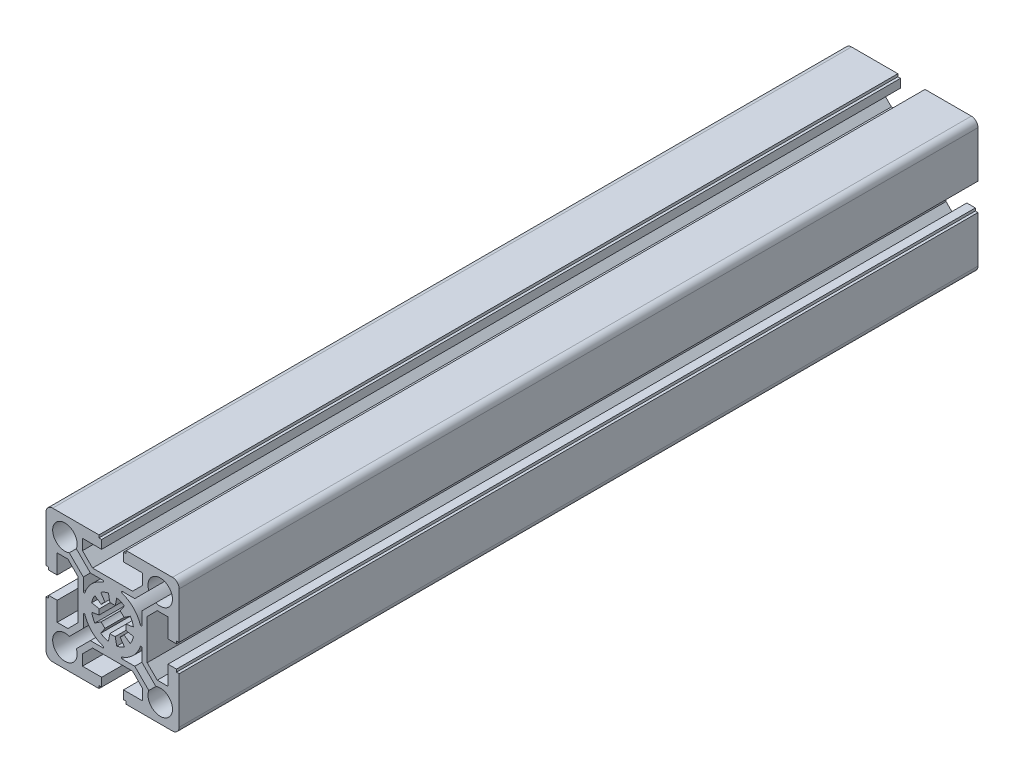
ISO-10303-21;
HEADER;
FILE_DESCRIPTION(('STEP AP214'),'2;1');
FILE_NAME('part.step','',(''),(''),'','','');
FILE_SCHEMA(('AUTOMOTIVE_DESIGN { 1 0 10303 214 1 1 1 1 }'));
ENDSEC;
DATA;
#1=APPLICATION_CONTEXT('core data for automotive mechanical design processes');
#2=APPLICATION_PROTOCOL_DEFINITION('international standard','automotive_design',2000,#1);
#3=PRODUCT_CONTEXT('',#1,'mechanical');
#4=PRODUCT('Part','Part','',(#3));
#5=PRODUCT_RELATED_PRODUCT_CATEGORY('part','',(#4));
#6=PRODUCT_DEFINITION_FORMATION('','',#4);
#7=PRODUCT_DEFINITION_CONTEXT('part definition',#1,'design');
#8=PRODUCT_DEFINITION('design','',#6,#7);
#9=PRODUCT_DEFINITION_SHAPE('','',#8);
#10=(LENGTH_UNIT() NAMED_UNIT(*) SI_UNIT(.MILLI.,.METRE.));
#11=(NAMED_UNIT(*) PLANE_ANGLE_UNIT() SI_UNIT($,.RADIAN.));
#12=(NAMED_UNIT(*) SI_UNIT($,.STERADIAN.) SOLID_ANGLE_UNIT());
#13=UNCERTAINTY_MEASURE_WITH_UNIT(LENGTH_MEASURE(1.E-05),#10,'distance_accuracy_value','');
#14=(GEOMETRIC_REPRESENTATION_CONTEXT(3) GLOBAL_UNCERTAINTY_ASSIGNED_CONTEXT((#13)) GLOBAL_UNIT_ASSIGNED_CONTEXT((#10,
#11,#12)) REPRESENTATION_CONTEXT('',''));
#15=CARTESIAN_POINT('',(0.,0.,0.));
#16=DIRECTION('',(0.,0.,1.));
#17=DIRECTION('',(1.,0.,0.));
#18=AXIS2_PLACEMENT_3D('',#15,#16,#17);
#19=CARTESIAN_POINT('',(-22.5000000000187,-22.4999999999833,150.));
#20=DIRECTION('',(0.,0.,1.));
#21=DIRECTION('',(1.,0.,0.));
#22=AXIS2_PLACEMENT_3D('',#19,#20,#21);
#23=PLANE('',#22);
#24=DIRECTION('',(0.707106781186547,-0.707106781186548,0.));
#25=VECTOR('',#24,1.);
#26=CARTESIAN_POINT('',(8.34834957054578,-10.9999999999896,150.));
#27=LINE('',#26,#25);
#28=CARTESIAN_POINT('',(8.34834957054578,-10.9999999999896,150.));
#29=VERTEX_POINT('',#28);
#30=CARTESIAN_POINT('',(13.603958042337,-16.2556084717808,150.));
#31=VERTEX_POINT('',#30);
#32=EDGE_CURVE('E884',#29,#31,#27,.T.);
#33=ORIENTED_EDGE('',*,*,#32,.F.);
#34=DIRECTION('',(1.,0.,0.));
#35=VECTOR('',#34,1.);
#36=CARTESIAN_POINT('',(3.63318042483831,-10.9999999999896,150.));
#37=LINE('',#36,#35);
#38=CARTESIAN_POINT('',(3.63318042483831,-10.9999999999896,150.));
#39=VERTEX_POINT('',#38);
#40=EDGE_CURVE('E882',#39,#29,#37,.T.);
#41=ORIENTED_EDGE('',*,*,#40,.F.);
#42=CARTESIAN_POINT('',(3.63318042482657,-10.7000000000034,150.));
#43=DIRECTION('',(0.,0.,1.));
#44=DIRECTION('',(1.,0.,0.));
#45=AXIS2_PLACEMENT_3D('',#42,#43,#44);
#46=CIRCLE('',#45,0.299999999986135);
#47=CARTESIAN_POINT('',(3.5367243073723,-10.4159292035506,150.));
#48=VERTEX_POINT('',#47);
#49=EDGE_CURVE('E898',#48,#39,#46,.T.);
#50=ORIENTED_EDGE('',*,*,#49,.F.);
#51=CARTESIAN_POINT('',(0.,0.,150.));
#52=DIRECTION('',(0.,0.,-1.));
#53=DIRECTION('',(1.,0.,0.));
#54=AXIS2_PLACEMENT_3D('',#51,#52,#53);
#55=CIRCLE('',#54,10.999999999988);
#56=CARTESIAN_POINT('',(10.4159292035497,-3.53672430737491,150.));
#57=VERTEX_POINT('',#56);
#58=EDGE_CURVE('E895',#57,#48,#55,.T.);
#59=ORIENTED_EDGE('',*,*,#58,.F.);
#60=CARTESIAN_POINT('',(10.7000000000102,-3.63318042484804,150.));
#61=DIRECTION('',(0.,0.,1.));
#62=DIRECTION('',(1.,0.,0.));
#63=AXIS2_PLACEMENT_3D('',#60,#61,#62);
#64=CIRCLE('',#63,0.299999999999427);
#65=CARTESIAN_POINT('',(11.0000000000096,-3.63318042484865,150.));
#66=VERTEX_POINT('',#65);
#67=EDGE_CURVE('E893',#66,#57,#64,.T.);
#68=ORIENTED_EDGE('',*,*,#67,.F.);
#69=DIRECTION('',(0.,1.,0.));
#70=VECTOR('',#69,1.);
#71=CARTESIAN_POINT('',(11.0000000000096,-8.34834957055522,150.));
#72=LINE('',#71,#70);
#73=CARTESIAN_POINT('',(11.0000000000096,-8.34834957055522,150.));
#74=VERTEX_POINT('',#73);
#75=EDGE_CURVE('E891',#74,#66,#72,.T.);
#76=ORIENTED_EDGE('',*,*,#75,.F.);
#77=DIRECTION('',(-0.707106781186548,0.707106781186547,0.));
#78=VECTOR('',#77,1.);
#79=CARTESIAN_POINT('',(16.2556084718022,-13.6039580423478,150.));
#80=LINE('',#79,#78);
#81=CARTESIAN_POINT('',(16.2556084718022,-13.6039580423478,150.));
#82=VERTEX_POINT('',#81);
#83=EDGE_CURVE('E889',#82,#74,#80,.T.);
#84=ORIENTED_EDGE('',*,*,#83,.F.);
#85=CARTESIAN_POINT('',(17.8999999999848,-17.9000000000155,150.));
#86=DIRECTION('',(0.,0.,1.));
#87=DIRECTION('',(1.,0.,0.));
#88=AXIS2_PLACEMENT_3D('',#85,#86,#87);
#89=CIRCLE('',#88,4.60000000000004);
#90=EDGE_CURVE('E887',#31,#82,#89,.T.);
#91=ORIENTED_EDGE('',*,*,#90,.F.);
#92=EDGE_LOOP('',(#33,#41,#50,#59,#68,#76,#84,#91));
#93=FACE_BOUND('',#92,.T.);
#94=DIRECTION('',(-1.,0.,0.));
#95=VECTOR('',#94,1.);
#96=CARTESIAN_POINT('',(8.3483495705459,10.9999999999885,150.));
#97=LINE('',#96,#95);
#98=CARTESIAN_POINT('',(8.3483495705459,10.9999999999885,150.));
#99=VERTEX_POINT('',#98);
#100=CARTESIAN_POINT('',(3.63318042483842,10.9999999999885,150.));
#101=VERTEX_POINT('',#100);
#102=EDGE_CURVE('E1004',#99,#101,#97,.T.);
#103=ORIENTED_EDGE('',*,*,#102,.F.);
#104=DIRECTION('',(-0.707106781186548,-0.707106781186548,0.));
#105=VECTOR('',#104,1.);
#106=CARTESIAN_POINT('',(13.6039580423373,16.25560847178,150.));
#107=LINE('',#106,#105);
#108=CARTESIAN_POINT('',(13.6039580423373,16.25560847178,150.));
#109=VERTEX_POINT('',#108);
#110=EDGE_CURVE('E1001',#109,#99,#107,.T.);
#111=ORIENTED_EDGE('',*,*,#110,.F.);
#112=CARTESIAN_POINT('',(17.8999999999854,17.9000000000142,150.));
#113=DIRECTION('',(0.,0.,1.));
#114=DIRECTION('',(1.,0.,0.));
#115=AXIS2_PLACEMENT_3D('',#112,#113,#114);
#116=CIRCLE('',#115,4.60000000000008);
#117=CARTESIAN_POINT('',(16.2556084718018,13.6039580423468,150.));
#118=VERTEX_POINT('',#117);
#119=EDGE_CURVE('E999',#118,#109,#116,.T.);
#120=ORIENTED_EDGE('',*,*,#119,.F.);
#121=DIRECTION('',(0.707106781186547,0.707106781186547,0.));
#122=VECTOR('',#121,1.);
#123=CARTESIAN_POINT('',(11.0000000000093,8.34834957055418,150.));
#124=LINE('',#123,#122);
#125=CARTESIAN_POINT('',(11.0000000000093,8.34834957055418,150.));
#126=VERTEX_POINT('',#125);
#127=EDGE_CURVE('E1014',#126,#118,#124,.T.);
#128=ORIENTED_EDGE('',*,*,#127,.F.);
#129=DIRECTION('',(0.,1.,0.));
#130=VECTOR('',#129,1.);
#131=CARTESIAN_POINT('',(11.0000000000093,3.63318042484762,150.));
#132=LINE('',#131,#130);
#133=CARTESIAN_POINT('',(11.0000000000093,3.63318042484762,150.));
#134=VERTEX_POINT('',#133);
#135=EDGE_CURVE('E1012',#134,#126,#132,.T.);
#136=ORIENTED_EDGE('',*,*,#135,.F.);
#137=CARTESIAN_POINT('',(10.7000000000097,3.63318042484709,150.));
#138=DIRECTION('',(0.,0.,1.));
#139=DIRECTION('',(1.,0.,0.));
#140=AXIS2_PLACEMENT_3D('',#137,#138,#139);
#141=CIRCLE('',#140,0.299999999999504);
#142=CARTESIAN_POINT('',(10.4159292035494,3.53672430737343,150.));
#143=VERTEX_POINT('',#142);
#144=EDGE_CURVE('E1010',#143,#134,#141,.T.);
#145=ORIENTED_EDGE('',*,*,#144,.F.);
#146=CARTESIAN_POINT('',(0.,0.,150.));
#147=DIRECTION('',(0.,0.,-1.));
#148=DIRECTION('',(1.,0.,0.));
#149=AXIS2_PLACEMENT_3D('',#146,#147,#148);
#150=CIRCLE('',#149,10.9999999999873);
#151=CARTESIAN_POINT('',(3.53672430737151,10.4159292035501,150.));
#152=VERTEX_POINT('',#151);
#153=EDGE_CURVE('E1008',#152,#143,#150,.T.);
#154=ORIENTED_EDGE('',*,*,#153,.F.);
#155=CARTESIAN_POINT('',(3.63318042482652,10.7000000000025,150.));
#156=DIRECTION('',(0.,0.,1.));
#157=DIRECTION('',(1.,0.,0.));
#158=AXIS2_PLACEMENT_3D('',#155,#156,#157);
#159=CIRCLE('',#158,0.299999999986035);
#160=EDGE_CURVE('E1006',#101,#152,#159,.T.);
#161=ORIENTED_EDGE('',*,*,#160,.F.);
#162=EDGE_LOOP('',(#103,#111,#120,#128,#136,#145,#154,#161));
#163=FACE_BOUND('',#162,.T.);
#164=DIRECTION('',(0.707106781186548,-0.707106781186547,0.));
#165=VECTOR('',#164,1.);
#166=CARTESIAN_POINT('',(-16.7800775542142,11.3000000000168,150.));
#167=LINE('',#166,#165);
#168=CARTESIAN_POINT('',(-16.7800775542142,11.3000000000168,150.));
#169=VERTEX_POINT('',#168);
#170=CARTESIAN_POINT('',(-13.0000000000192,7.51992244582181,150.));
#171=VERTEX_POINT('',#170);
#172=EDGE_CURVE('E1288',#169,#171,#167,.T.);
#173=ORIENTED_EDGE('',*,*,#172,.T.);
#174=DIRECTION('',(0.,-1.,0.));
#175=VECTOR('',#174,1.);
#176=CARTESIAN_POINT('',(-13.0000000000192,7.51992244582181,150.));
#177=LINE('',#176,#175);
#178=CARTESIAN_POINT('',(-13.0000000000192,-7.51992244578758,150.));
#179=VERTEX_POINT('',#178);
#180=EDGE_CURVE('E1291',#171,#179,#177,.T.);
#181=ORIENTED_EDGE('',*,*,#180,.T.);
#182=DIRECTION('',(-0.707106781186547,-0.707106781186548,0.));
#183=VECTOR('',#182,1.);
#184=CARTESIAN_POINT('',(-13.0000000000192,-7.51992244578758,150.));
#185=LINE('',#184,#183);
#186=CARTESIAN_POINT('',(-16.7800775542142,-11.2999999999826,150.));
#187=VERTEX_POINT('',#186);
#188=EDGE_CURVE('E1294',#179,#187,#185,.T.);
#189=ORIENTED_EDGE('',*,*,#188,.T.);
#190=DIRECTION('',(-1.,0.,0.));
#191=VECTOR('',#190,1.);
#192=CARTESIAN_POINT('',(-16.7800775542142,-11.2999999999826,150.));
#193=LINE('',#192,#191);
#194=CARTESIAN_POINT('',(-20.8000000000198,-11.2999999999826,150.));
#195=VERTEX_POINT('',#194);
#196=EDGE_CURVE('E1296',#187,#195,#193,.T.);
#197=ORIENTED_EDGE('',*,*,#196,.T.);
#198=DIRECTION('',(0.,1.,0.));
#199=VECTOR('',#198,1.);
#200=CARTESIAN_POINT('',(-20.8000000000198,-11.2999999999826,150.));
#201=LINE('',#200,#199);
#202=CARTESIAN_POINT('',(-20.8000000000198,-4.0999999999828,150.));
#203=VERTEX_POINT('',#202);
#204=EDGE_CURVE('E1298',#195,#203,#201,.T.);
#205=ORIENTED_EDGE('',*,*,#204,.T.);
#206=DIRECTION('',(-1.,0.,0.));
#207=VECTOR('',#206,1.);
#208=CARTESIAN_POINT('',(-20.8000000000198,-4.0999999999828,150.));
#209=LINE('',#208,#207);
#210=CARTESIAN_POINT('',(-24.0000000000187,-4.0999999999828,150.));
#211=VERTEX_POINT('',#210);
#212=EDGE_CURVE('E1300',#203,#211,#209,.T.);
#213=ORIENTED_EDGE('',*,*,#212,.T.);
#214=DIRECTION('',(0.,-1.,0.));
#215=VECTOR('',#214,1.);
#216=CARTESIAN_POINT('',(-24.0000000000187,-4.0999999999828,150.));
#217=LINE('',#216,#215);
#218=CARTESIAN_POINT('',(-24.0000000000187,-5.0999999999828,150.));
#219=VERTEX_POINT('',#218);
#220=EDGE_CURVE('E1302',#211,#219,#217,.T.);
#221=ORIENTED_EDGE('',*,*,#220,.T.);
#222=DIRECTION('',(-1.,0.,0.));
#223=VECTOR('',#222,1.);
#224=CARTESIAN_POINT('',(-24.0000000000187,-5.0999999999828,150.));
#225=LINE('',#224,#223);
#226=CARTESIAN_POINT('',(-25.0000000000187,-5.0999999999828,150.));
#227=VERTEX_POINT('',#226);
#228=EDGE_CURVE('E1304',#219,#227,#225,.T.);
#229=ORIENTED_EDGE('',*,*,#228,.T.);
#230=DIRECTION('',(0.,-1.,0.));
#231=VECTOR('',#230,1.);
#232=CARTESIAN_POINT('',(-25.0000000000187,-5.0999999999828,150.));
#233=LINE('',#232,#231);
#234=CARTESIAN_POINT('',(-25.0000000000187,-22.4999999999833,150.));
#235=VERTEX_POINT('',#234);
#236=EDGE_CURVE('E1306',#227,#235,#233,.T.);
#237=ORIENTED_EDGE('',*,*,#236,.T.);
#238=CARTESIAN_POINT('',(-22.5000000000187,-22.4999999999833,150.));
#239=DIRECTION('',(0.,0.,1.));
#240=DIRECTION('',(1.,0.,0.));
#241=AXIS2_PLACEMENT_3D('',#238,#239,#240);
#242=CIRCLE('',#241,2.5);
#243=CARTESIAN_POINT('',(-22.5000000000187,-24.9999999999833,150.));
#244=VERTEX_POINT('',#243);
#245=EDGE_CURVE('E1308',#235,#244,#242,.T.);
#246=ORIENTED_EDGE('',*,*,#245,.T.);
#247=DIRECTION('',(1.,0.,0.));
#248=VECTOR('',#247,1.);
#249=CARTESIAN_POINT('',(-22.5000000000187,-24.9999999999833,150.));
#250=LINE('',#249,#248);
#251=CARTESIAN_POINT('',(-5.10000000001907,-24.9999999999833,150.));
#252=VERTEX_POINT('',#251);
#253=EDGE_CURVE('E1310',#244,#252,#250,.T.);
#254=ORIENTED_EDGE('',*,*,#253,.T.);
#255=DIRECTION('',(0.,1.,0.));
#256=VECTOR('',#255,1.);
#257=CARTESIAN_POINT('',(-5.10000000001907,-24.9999999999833,150.));
#258=LINE('',#257,#256);
#259=CARTESIAN_POINT('',(-5.10000000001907,-23.9999999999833,150.));
#260=VERTEX_POINT('',#259);
#261=EDGE_CURVE('E1312',#252,#260,#258,.T.);
#262=ORIENTED_EDGE('',*,*,#261,.T.);
#263=DIRECTION('',(1.,0.,0.));
#264=VECTOR('',#263,1.);
#265=CARTESIAN_POINT('',(-5.10000000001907,-23.9999999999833,150.));
#266=LINE('',#265,#264);
#267=CARTESIAN_POINT('',(-4.10000000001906,-23.9999999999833,150.));
#268=VERTEX_POINT('',#267);
#269=EDGE_CURVE('E1314',#260,#268,#266,.T.);
#270=ORIENTED_EDGE('',*,*,#269,.T.);
#271=DIRECTION('',(0.,1.,0.));
#272=VECTOR('',#271,1.);
#273=CARTESIAN_POINT('',(-4.10000000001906,-23.9999999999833,150.));
#274=LINE('',#273,#272);
#275=CARTESIAN_POINT('',(-4.10000000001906,-20.7999999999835,150.));
#276=VERTEX_POINT('',#275);
#277=EDGE_CURVE('E1316',#268,#276,#274,.T.);
#278=ORIENTED_EDGE('',*,*,#277,.T.);
#279=DIRECTION('',(-1.,0.,0.));
#280=VECTOR('',#279,1.);
#281=CARTESIAN_POINT('',(-4.10000000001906,-20.7999999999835,150.));
#282=LINE('',#281,#280);
#283=CARTESIAN_POINT('',(-11.300000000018,-20.7999999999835,150.));
#284=VERTEX_POINT('',#283);
#285=EDGE_CURVE('E1318',#276,#284,#282,.T.);
#286=ORIENTED_EDGE('',*,*,#285,.T.);
#287=DIRECTION('',(0.,1.,0.));
#288=VECTOR('',#287,1.);
#289=CARTESIAN_POINT('',(-11.300000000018,-20.7999999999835,150.));
#290=LINE('',#289,#288);
#291=CARTESIAN_POINT('',(-11.300000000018,-16.780077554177,150.));
#292=VERTEX_POINT('',#291);
#293=EDGE_CURVE('E1320',#284,#292,#290,.T.);
#294=ORIENTED_EDGE('',*,*,#293,.T.);
#295=DIRECTION('',(0.707106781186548,0.707106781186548,0.));
#296=VECTOR('',#295,1.);
#297=CARTESIAN_POINT('',(-11.300000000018,-16.780077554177,150.));
#298=LINE('',#297,#296);
#299=CARTESIAN_POINT('',(-7.51992244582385,-12.9999999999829,150.));
#300=VERTEX_POINT('',#299);
#301=EDGE_CURVE('E1322',#292,#300,#298,.T.);
#302=ORIENTED_EDGE('',*,*,#301,.T.);
#303=DIRECTION('',(1.,0.,0.));
#304=VECTOR('',#303,1.);
#305=CARTESIAN_POINT('',(-7.51992244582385,-12.9999999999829,150.));
#306=LINE('',#305,#304);
#307=CARTESIAN_POINT('',(7.51992244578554,-12.9999999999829,150.));
#308=VERTEX_POINT('',#307);
#309=EDGE_CURVE('E1324',#300,#308,#306,.T.);
#310=ORIENTED_EDGE('',*,*,#309,.T.);
#311=DIRECTION('',(0.707106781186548,-0.707106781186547,0.));
#312=VECTOR('',#311,1.);
#313=CARTESIAN_POINT('',(7.51992244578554,-12.9999999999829,150.));
#314=LINE('',#313,#312);
#315=CARTESIAN_POINT('',(11.2999999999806,-16.7800775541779,150.));
#316=VERTEX_POINT('',#315);
#317=EDGE_CURVE('E1326',#308,#316,#314,.T.);
#318=ORIENTED_EDGE('',*,*,#317,.T.);
#319=DIRECTION('',(0.,-1.,0.));
#320=VECTOR('',#319,1.);
#321=CARTESIAN_POINT('',(11.2999999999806,-16.7800775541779,150.));
#322=LINE('',#321,#320);
#323=CARTESIAN_POINT('',(11.2999999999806,-20.7999999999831,150.));
#324=VERTEX_POINT('',#323);
#325=EDGE_CURVE('E1328',#316,#324,#322,.T.);
#326=ORIENTED_EDGE('',*,*,#325,.T.);
#327=DIRECTION('',(-1.,0.,0.));
#328=VECTOR('',#327,1.);
#329=CARTESIAN_POINT('',(11.2999999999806,-20.7999999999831,150.));
#330=LINE('',#329,#328);
#331=CARTESIAN_POINT('',(4.09999999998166,-20.7999999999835,150.));
#332=VERTEX_POINT('',#331);
#333=EDGE_CURVE('E1330',#324,#332,#330,.T.);
#334=ORIENTED_EDGE('',*,*,#333,.T.);
#335=DIRECTION('',(0.,-1.,0.));
#336=VECTOR('',#335,1.);
#337=CARTESIAN_POINT('',(4.09999999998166,-20.7999999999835,150.));
#338=LINE('',#337,#336);
#339=CARTESIAN_POINT('',(4.09999999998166,-23.9999999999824,150.));
#340=VERTEX_POINT('',#339);
#341=EDGE_CURVE('E1332',#332,#340,#338,.T.);
#342=ORIENTED_EDGE('',*,*,#341,.T.);
#343=DIRECTION('',(1.,0.,0.));
#344=VECTOR('',#343,1.);
#345=CARTESIAN_POINT('',(4.09999999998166,-23.9999999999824,150.));
#346=LINE('',#345,#344);
#347=CARTESIAN_POINT('',(5.09999999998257,-23.9999999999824,150.));
#348=VERTEX_POINT('',#347);
#349=EDGE_CURVE('E1334',#340,#348,#346,.T.);
#350=ORIENTED_EDGE('',*,*,#349,.T.);
#351=DIRECTION('',(0.,-1.,0.));
#352=VECTOR('',#351,1.);
#353=CARTESIAN_POINT('',(5.09999999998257,-23.9999999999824,150.));
#354=LINE('',#353,#352);
#355=CARTESIAN_POINT('',(5.09999999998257,-24.9999999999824,150.));
#356=VERTEX_POINT('',#355);
#357=EDGE_CURVE('E1336',#348,#356,#354,.T.);
#358=ORIENTED_EDGE('',*,*,#357,.T.);
#359=DIRECTION('',(1.,0.,0.));
#360=VECTOR('',#359,1.);
#361=CARTESIAN_POINT('',(5.09999999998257,-24.9999999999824,150.));
#362=LINE('',#361,#360);
#363=CARTESIAN_POINT('',(22.4999999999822,-24.9999999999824,150.));
#364=VERTEX_POINT('',#363);
#365=EDGE_CURVE('E1338',#356,#364,#362,.T.);
#366=ORIENTED_EDGE('',*,*,#365,.T.);
#367=CARTESIAN_POINT('',(22.4999999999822,-22.4999999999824,150.));
#368=DIRECTION('',(0.,0.,1.));
#369=DIRECTION('',(1.,0.,0.));
#370=AXIS2_PLACEMENT_3D('',#367,#368,#369);
#371=CIRCLE('',#370,2.5);
#372=CARTESIAN_POINT('',(24.9999999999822,-22.4999999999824,150.));
#373=VERTEX_POINT('',#372);
#374=EDGE_CURVE('E1340',#364,#373,#371,.T.);
#375=ORIENTED_EDGE('',*,*,#374,.T.);
#376=DIRECTION('',(0.,1.,0.));
#377=VECTOR('',#376,1.);
#378=CARTESIAN_POINT('',(24.9999999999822,-22.4999999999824,150.));
#379=LINE('',#378,#377);
#380=CARTESIAN_POINT('',(24.9999999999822,-5.09999999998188,150.));
#381=VERTEX_POINT('',#380);
#382=EDGE_CURVE('E1342',#373,#381,#379,.T.);
#383=ORIENTED_EDGE('',*,*,#382,.T.);
#384=DIRECTION('',(-1.,0.,0.));
#385=VECTOR('',#384,1.);
#386=CARTESIAN_POINT('',(24.9999999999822,-5.09999999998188,150.));
#387=LINE('',#386,#385);
#388=CARTESIAN_POINT('',(23.9999999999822,-5.09999999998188,150.));
#389=VERTEX_POINT('',#388);
#390=EDGE_CURVE('E1344',#381,#389,#387,.T.);
#391=ORIENTED_EDGE('',*,*,#390,.T.);
#392=DIRECTION('',(0.,1.,0.));
#393=VECTOR('',#392,1.);
#394=CARTESIAN_POINT('',(23.9999999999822,-5.09999999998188,150.));
#395=LINE('',#394,#393);
#396=CARTESIAN_POINT('',(23.9999999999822,-4.09999999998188,150.));
#397=VERTEX_POINT('',#396);
#398=EDGE_CURVE('E1346',#389,#397,#395,.T.);
#399=ORIENTED_EDGE('',*,*,#398,.T.);
#400=DIRECTION('',(-1.,0.,0.));
#401=VECTOR('',#400,1.);
#402=CARTESIAN_POINT('',(23.9999999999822,-4.09999999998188,150.));
#403=LINE('',#402,#401);
#404=CARTESIAN_POINT('',(20.7999999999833,-4.09999999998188,150.));
#405=VERTEX_POINT('',#404);
#406=EDGE_CURVE('E1348',#397,#405,#403,.T.);
#407=ORIENTED_EDGE('',*,*,#406,.T.);
#408=DIRECTION('',(0.,-1.,0.));
#409=VECTOR('',#408,1.);
#410=CARTESIAN_POINT('',(20.7999999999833,-4.09999999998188,150.));
#411=LINE('',#410,#409);
#412=CARTESIAN_POINT('',(20.7999999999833,-11.2999999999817,150.));
#413=VERTEX_POINT('',#412);
#414=EDGE_CURVE('E1350',#405,#413,#411,.T.);
#415=ORIENTED_EDGE('',*,*,#414,.T.);
#416=DIRECTION('',(-1.,0.,0.));
#417=VECTOR('',#416,1.);
#418=CARTESIAN_POINT('',(20.7999999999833,-11.2999999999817,150.));
#419=LINE('',#418,#417);
#420=CARTESIAN_POINT('',(16.7800775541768,-11.2999999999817,150.));
#421=VERTEX_POINT('',#420);
#422=EDGE_CURVE('E1352',#413,#421,#419,.T.);
#423=ORIENTED_EDGE('',*,*,#422,.T.);
#424=DIRECTION('',(-0.707106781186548,0.707106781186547,0.));
#425=VECTOR('',#424,1.);
#426=CARTESIAN_POINT('',(16.7800775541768,-11.2999999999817,150.));
#427=LINE('',#426,#425);
#428=CARTESIAN_POINT('',(12.9999999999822,-7.51992244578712,150.));
#429=VERTEX_POINT('',#428);
#430=EDGE_CURVE('E1354',#421,#429,#427,.T.);
#431=ORIENTED_EDGE('',*,*,#430,.T.);
#432=DIRECTION('',(0.,1.,0.));
#433=VECTOR('',#432,1.);
#434=CARTESIAN_POINT('',(12.9999999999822,-7.51992244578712,150.));
#435=LINE('',#434,#433);
#436=CARTESIAN_POINT('',(12.9999999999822,7.51992244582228,150.));
#437=VERTEX_POINT('',#436);
#438=EDGE_CURVE('E1356',#429,#437,#435,.T.);
#439=ORIENTED_EDGE('',*,*,#438,.T.);
#440=DIRECTION('',(0.707106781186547,0.707106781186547,0.));
#441=VECTOR('',#440,1.);
#442=CARTESIAN_POINT('',(12.9999999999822,7.51992244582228,150.));
#443=LINE('',#442,#441);
#444=CARTESIAN_POINT('',(16.7800775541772,11.3000000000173,150.));
#445=VERTEX_POINT('',#444);
#446=EDGE_CURVE('E1358',#437,#445,#443,.T.);
#447=ORIENTED_EDGE('',*,*,#446,.T.);
#448=DIRECTION('',(1.,0.,0.));
#449=VECTOR('',#448,1.);
#450=CARTESIAN_POINT('',(16.7800775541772,11.3000000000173,150.));
#451=LINE('',#450,#449);
#452=CARTESIAN_POINT('',(20.7999999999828,11.3000000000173,150.));
#453=VERTEX_POINT('',#452);
#454=EDGE_CURVE('E1360',#445,#453,#451,.T.);
#455=ORIENTED_EDGE('',*,*,#454,.T.);
#456=DIRECTION('',(0.,-1.,0.));
#457=VECTOR('',#456,1.);
#458=CARTESIAN_POINT('',(20.7999999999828,11.3000000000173,150.));
#459=LINE('',#458,#457);
#460=CARTESIAN_POINT('',(20.7999999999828,4.10000000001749,150.));
#461=VERTEX_POINT('',#460);
#462=EDGE_CURVE('E1362',#453,#461,#459,.T.);
#463=ORIENTED_EDGE('',*,*,#462,.T.);
#464=DIRECTION('',(1.,0.,0.));
#465=VECTOR('',#464,1.);
#466=CARTESIAN_POINT('',(20.7999999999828,4.10000000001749,150.));
#467=LINE('',#466,#465);
#468=CARTESIAN_POINT('',(23.9999999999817,4.10000000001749,150.));
#469=VERTEX_POINT('',#468);
#470=EDGE_CURVE('E1364',#461,#469,#467,.T.);
#471=ORIENTED_EDGE('',*,*,#470,.T.);
#472=DIRECTION('',(0.,1.,0.));
#473=VECTOR('',#472,1.);
#474=CARTESIAN_POINT('',(23.9999999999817,4.10000000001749,150.));
#475=LINE('',#474,#473);
#476=CARTESIAN_POINT('',(23.9999999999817,5.1000000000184,150.));
#477=VERTEX_POINT('',#476);
#478=EDGE_CURVE('E1366',#469,#477,#475,.T.);
#479=ORIENTED_EDGE('',*,*,#478,.T.);
#480=DIRECTION('',(1.,0.,0.));
#481=VECTOR('',#480,1.);
#482=CARTESIAN_POINT('',(23.9999999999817,5.1000000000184,150.));
#483=LINE('',#482,#481);
#484=CARTESIAN_POINT('',(24.9999999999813,5.1000000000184,150.));
#485=VERTEX_POINT('',#484);
#486=EDGE_CURVE('E1368',#477,#485,#483,.T.);
#487=ORIENTED_EDGE('',*,*,#486,.T.);
#488=DIRECTION('',(0.,1.,0.));
#489=VECTOR('',#488,1.);
#490=CARTESIAN_POINT('',(24.9999999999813,5.1000000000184,150.));
#491=LINE('',#490,#489);
#492=CARTESIAN_POINT('',(24.9999999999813,22.5000000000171,150.));
#493=VERTEX_POINT('',#492);
#494=EDGE_CURVE('E1370',#485,#493,#491,.T.);
#495=ORIENTED_EDGE('',*,*,#494,.T.);
#496=CARTESIAN_POINT('',(22.4999999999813,22.5000000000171,150.));
#497=DIRECTION('',(0.,0.,1.));
#498=DIRECTION('',(1.,0.,0.));
#499=AXIS2_PLACEMENT_3D('',#496,#497,#498);
#500=CIRCLE('',#499,2.5);
#501=CARTESIAN_POINT('',(22.4999999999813,25.0000000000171,150.));
#502=VERTEX_POINT('',#501);
#503=EDGE_CURVE('E1372',#493,#502,#500,.T.);
#504=ORIENTED_EDGE('',*,*,#503,.T.);
#505=DIRECTION('',(-1.,0.,0.));
#506=VECTOR('',#505,1.);
#507=CARTESIAN_POINT('',(22.4999999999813,25.0000000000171,150.));
#508=LINE('',#507,#506);
#509=CARTESIAN_POINT('',(5.09999999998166,25.0000000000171,150.));
#510=VERTEX_POINT('',#509);
#511=EDGE_CURVE('E1374',#502,#510,#508,.T.);
#512=ORIENTED_EDGE('',*,*,#511,.T.);
#513=DIRECTION('',(0.,-1.,0.));
#514=VECTOR('',#513,1.);
#515=CARTESIAN_POINT('',(5.09999999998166,25.0000000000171,150.));
#516=LINE('',#515,#514);
#517=CARTESIAN_POINT('',(5.09999999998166,24.0000000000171,150.));
#518=VERTEX_POINT('',#517);
#519=EDGE_CURVE('E1376',#510,#518,#516,.T.);
#520=ORIENTED_EDGE('',*,*,#519,.T.);
#521=DIRECTION('',(-1.,0.,0.));
#522=VECTOR('',#521,1.);
#523=CARTESIAN_POINT('',(5.09999999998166,24.0000000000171,150.));
#524=LINE('',#523,#522);
#525=CARTESIAN_POINT('',(4.09999999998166,24.0000000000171,150.));
#526=VERTEX_POINT('',#525);
#527=EDGE_CURVE('E1378',#518,#526,#524,.T.);
#528=ORIENTED_EDGE('',*,*,#527,.T.);
#529=DIRECTION('',(0.,-1.,0.));
#530=VECTOR('',#529,1.);
#531=CARTESIAN_POINT('',(4.09999999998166,24.0000000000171,150.));
#532=LINE('',#531,#530);
#533=CARTESIAN_POINT('',(4.09999999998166,20.8000000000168,150.));
#534=VERTEX_POINT('',#533);
#535=EDGE_CURVE('E1380',#526,#534,#532,.T.);
#536=ORIENTED_EDGE('',*,*,#535,.T.);
#537=DIRECTION('',(1.,0.,0.));
#538=VECTOR('',#537,1.);
#539=CARTESIAN_POINT('',(4.09999999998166,20.8000000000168,150.));
#540=LINE('',#539,#538);
#541=CARTESIAN_POINT('',(11.2999999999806,20.8000000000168,150.));
#542=VERTEX_POINT('',#541);
#543=EDGE_CURVE('E1382',#534,#542,#540,.T.);
#544=ORIENTED_EDGE('',*,*,#543,.T.);
#545=DIRECTION('',(0.,-1.,0.));
#546=VECTOR('',#545,1.);
#547=CARTESIAN_POINT('',(11.2999999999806,20.8000000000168,150.));
#548=LINE('',#547,#546);
#549=CARTESIAN_POINT('',(11.2999999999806,16.7800775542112,150.));
#550=VERTEX_POINT('',#549);
#551=EDGE_CURVE('E1384',#542,#550,#548,.T.);
#552=ORIENTED_EDGE('',*,*,#551,.T.);
#553=DIRECTION('',(-0.707106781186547,-0.707106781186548,0.));
#554=VECTOR('',#553,1.);
#555=CARTESIAN_POINT('',(11.2999999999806,16.7800775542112,150.));
#556=LINE('',#555,#554);
#557=CARTESIAN_POINT('',(7.519922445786,13.0000000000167,150.));
#558=VERTEX_POINT('',#557);
#559=EDGE_CURVE('E1386',#550,#558,#556,.T.);
#560=ORIENTED_EDGE('',*,*,#559,.T.);
#561=DIRECTION('',(-1.,0.,0.));
#562=VECTOR('',#561,1.);
#563=CARTESIAN_POINT('',(7.519922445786,13.0000000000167,150.));
#564=LINE('',#563,#562);
#565=CARTESIAN_POINT('',(-7.51992244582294,13.0000000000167,150.));
#566=VERTEX_POINT('',#565);
#567=EDGE_CURVE('E1388',#558,#566,#564,.T.);
#568=ORIENTED_EDGE('',*,*,#567,.T.);
#569=DIRECTION('',(-0.707106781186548,0.707106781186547,0.));
#570=VECTOR('',#569,1.);
#571=CARTESIAN_POINT('',(-7.51992244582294,13.0000000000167,150.));
#572=LINE('',#571,#570);
#573=CARTESIAN_POINT('',(-11.300000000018,16.7800775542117,150.));
#574=VERTEX_POINT('',#573);
#575=EDGE_CURVE('E1390',#566,#574,#572,.T.);
#576=ORIENTED_EDGE('',*,*,#575,.T.);
#577=DIRECTION('',(0.,1.,0.));
#578=VECTOR('',#577,1.);
#579=CARTESIAN_POINT('',(-11.300000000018,16.7800775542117,150.));
#580=LINE('',#579,#578);
#581=CARTESIAN_POINT('',(-11.300000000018,20.8000000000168,150.));
#582=VERTEX_POINT('',#581);
#583=EDGE_CURVE('E1392',#574,#582,#580,.T.);
#584=ORIENTED_EDGE('',*,*,#583,.T.);
#585=DIRECTION('',(1.,0.,0.));
#586=VECTOR('',#585,1.);
#587=CARTESIAN_POINT('',(-11.300000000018,20.8000000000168,150.));
#588=LINE('',#587,#586);
#589=CARTESIAN_POINT('',(-4.10000000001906,20.8000000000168,150.));
#590=VERTEX_POINT('',#589);
#591=EDGE_CURVE('E1394',#582,#590,#588,.T.);
#592=ORIENTED_EDGE('',*,*,#591,.T.);
#593=DIRECTION('',(0.,1.,0.));
#594=VECTOR('',#593,1.);
#595=CARTESIAN_POINT('',(-4.10000000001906,20.8000000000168,150.));
#596=LINE('',#595,#594);
#597=CARTESIAN_POINT('',(-4.10000000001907,24.0000000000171,150.));
#598=VERTEX_POINT('',#597);
#599=EDGE_CURVE('E1396',#590,#598,#596,.T.);
#600=ORIENTED_EDGE('',*,*,#599,.T.);
#601=DIRECTION('',(-1.,0.,0.));
#602=VECTOR('',#601,1.);
#603=CARTESIAN_POINT('',(-4.10000000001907,24.0000000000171,150.));
#604=LINE('',#603,#602);
#605=CARTESIAN_POINT('',(-5.10000000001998,24.0000000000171,150.));
#606=VERTEX_POINT('',#605);
#607=EDGE_CURVE('E1398',#598,#606,#604,.T.);
#608=ORIENTED_EDGE('',*,*,#607,.T.);
#609=DIRECTION('',(0.,1.,0.));
#610=VECTOR('',#609,1.);
#611=CARTESIAN_POINT('',(-5.10000000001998,24.0000000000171,150.));
#612=LINE('',#611,#610);
#613=CARTESIAN_POINT('',(-5.10000000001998,25.0000000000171,150.));
#614=VERTEX_POINT('',#613);
#615=EDGE_CURVE('E1400',#606,#614,#612,.T.);
#616=ORIENTED_EDGE('',*,*,#615,.T.);
#617=DIRECTION('',(-1.,0.,0.));
#618=VECTOR('',#617,1.);
#619=CARTESIAN_POINT('',(-5.10000000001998,25.0000000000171,150.));
#620=LINE('',#619,#618);
#621=CARTESIAN_POINT('',(-22.5000000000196,25.0000000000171,150.));
#622=VERTEX_POINT('',#621);
#623=EDGE_CURVE('E1402',#614,#622,#620,.T.);
#624=ORIENTED_EDGE('',*,*,#623,.T.);
#625=CARTESIAN_POINT('',(-22.5000000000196,22.5000000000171,150.));
#626=DIRECTION('',(0.,0.,1.));
#627=DIRECTION('',(1.,0.,0.));
#628=AXIS2_PLACEMENT_3D('',#625,#626,#627);
#629=CIRCLE('',#628,2.5);
#630=CARTESIAN_POINT('',(-25.0000000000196,22.5000000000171,150.));
#631=VERTEX_POINT('',#630);
#632=EDGE_CURVE('E1404',#622,#631,#629,.T.);
#633=ORIENTED_EDGE('',*,*,#632,.T.);
#634=DIRECTION('',(0.,-1.,0.));
#635=VECTOR('',#634,1.);
#636=CARTESIAN_POINT('',(-25.0000000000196,22.5000000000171,150.));
#637=LINE('',#636,#635);
#638=CARTESIAN_POINT('',(-25.0000000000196,5.10000000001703,150.));
#639=VERTEX_POINT('',#638);
#640=EDGE_CURVE('E1406',#631,#639,#637,.T.);
#641=ORIENTED_EDGE('',*,*,#640,.T.);
#642=DIRECTION('',(1.,0.,0.));
#643=VECTOR('',#642,1.);
#644=CARTESIAN_POINT('',(-25.0000000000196,5.10000000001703,150.));
#645=LINE('',#644,#643);
#646=CARTESIAN_POINT('',(-24.0000000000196,5.10000000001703,150.));
#647=VERTEX_POINT('',#646);
#648=EDGE_CURVE('E1408',#639,#647,#645,.T.);
#649=ORIENTED_EDGE('',*,*,#648,.T.);
#650=DIRECTION('',(0.,-1.,0.));
#651=VECTOR('',#650,1.);
#652=CARTESIAN_POINT('',(-24.0000000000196,5.10000000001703,150.));
#653=LINE('',#652,#651);
#654=CARTESIAN_POINT('',(-24.0000000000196,4.10000000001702,150.));
#655=VERTEX_POINT('',#654);
#656=EDGE_CURVE('E1410',#647,#655,#653,.T.);
#657=ORIENTED_EDGE('',*,*,#656,.T.);
#658=DIRECTION('',(1.,0.,0.));
#659=VECTOR('',#658,1.);
#660=CARTESIAN_POINT('',(-24.0000000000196,4.10000000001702,150.));
#661=LINE('',#660,#659);
#662=CARTESIAN_POINT('',(-20.8000000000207,4.10000000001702,150.));
#663=VERTEX_POINT('',#662);
#664=EDGE_CURVE('E1412',#655,#663,#661,.T.);
#665=ORIENTED_EDGE('',*,*,#664,.T.);
#666=DIRECTION('',(0.,1.,0.));
#667=VECTOR('',#666,1.);
#668=CARTESIAN_POINT('',(-20.8000000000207,4.10000000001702,150.));
#669=LINE('',#668,#667);
#670=CARTESIAN_POINT('',(-20.8000000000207,11.3000000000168,150.));
#671=VERTEX_POINT('',#670);
#672=EDGE_CURVE('E1414',#663,#671,#669,.T.);
#673=ORIENTED_EDGE('',*,*,#672,.T.);
#674=DIRECTION('',(1.,0.,0.));
#675=VECTOR('',#674,1.);
#676=CARTESIAN_POINT('',(-20.8000000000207,11.3000000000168,150.));
#677=LINE('',#676,#675);
#678=EDGE_CURVE('E1416',#671,#169,#677,.T.);
#679=ORIENTED_EDGE('',*,*,#678,.T.);
#680=EDGE_LOOP('',(#173,#181,#189,#197,#205,#213,#221,#229,#237,#246,#254,#262,#270,#278,#286,
#294,#302,#310,#318,#326,#334,#342,#350,#358,#366,#375,#383,#391,#399,#407,#415,#423,#431,#439,
#447,#455,#463,#471,#479,#487,#495,#504,#512,#520,#528,#536,#544,#552,#560,#568,#576,#584,#592,
#600,#608,#616,#624,#633,#641,#649,#657,#665,#673,#679));
#681=FACE_BOUND('',#680,.T.);
#682=DIRECTION('',(-0.831469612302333,0.555570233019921,0.));
#683=VECTOR('',#682,1.);
#684=CARTESIAN_POINT('',(-4.24049502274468,2.83340818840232,150.));
#685=LINE('',#684,#683);
#686=CARTESIAN_POINT('',(-4.24049502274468,2.83340818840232,150.));
#687=VERTEX_POINT('',#686);
#688=CARTESIAN_POINT('',(-6.65175689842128,4.44456186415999,150.));
#689=VERTEX_POINT('',#688);
#690=EDGE_CURVE('E1058',#687,#689,#685,.T.);
#691=ORIENTED_EDGE('',*,*,#690,.F.);
#692=CARTESIAN_POINT('',(0.,0.,150.));
#693=DIRECTION('',(0.,0.,1.));
#694=DIRECTION('',(1.,0.,0.));
#695=AXIS2_PLACEMENT_3D('',#692,#693,#694);
#696=CIRCLE('',#695,5.10000000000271);
#697=CARTESIAN_POINT('',(-2.83340818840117,4.24049502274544,150.));
#698=VERTEX_POINT('',#697);
#699=EDGE_CURVE('E1056',#698,#687,#696,.T.);
#700=ORIENTED_EDGE('',*,*,#699,.F.);
#701=DIRECTION('',(0.555570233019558,-0.831469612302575,0.));
#702=VECTOR('',#701,1.);
#703=CARTESIAN_POINT('',(-4.44456186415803,6.65175689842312,150.));
#704=LINE('',#703,#702);
#705=CARTESIAN_POINT('',(-4.44456186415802,6.65175689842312,150.));
#706=VERTEX_POINT('',#705);
#707=EDGE_CURVE('E1120',#706,#698,#704,.T.);
#708=ORIENTED_EDGE('',*,*,#707,.F.);
#709=CARTESIAN_POINT('',(0.,0.,150.));
#710=DIRECTION('',(0.,0.,1.));
#711=DIRECTION('',(1.,0.,0.));
#712=AXIS2_PLACEMENT_3D('',#709,#710,#711);
#713=CIRCLE('',#712,8.00000000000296);
#714=CARTESIAN_POINT('',(-1.56072257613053,7.84628224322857,150.));
#715=VERTEX_POINT('',#714);
#716=EDGE_CURVE('E1117',#715,#706,#713,.T.);
#717=ORIENTED_EDGE('',*,*,#716,.F.);
#718=DIRECTION('',(-0.195090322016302,0.980785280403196,0.));
#719=VECTOR('',#718,1.);
#720=CARTESIAN_POINT('',(-0.994960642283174,5.00200493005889,150.));
#721=LINE('',#720,#719);
#722=CARTESIAN_POINT('',(-0.994960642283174,5.00200493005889,150.));
#723=VERTEX_POINT('',#722);
#724=EDGE_CURVE('E1115',#723,#715,#721,.T.);
#725=ORIENTED_EDGE('',*,*,#724,.F.);
#726=CARTESIAN_POINT('',(0.,0.,150.));
#727=DIRECTION('',(0.,0.,1.));
#728=DIRECTION('',(1.,0.,0.));
#729=AXIS2_PLACEMENT_3D('',#726,#727,#728);
#730=CIRCLE('',#729,5.10000000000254);
#731=CARTESIAN_POINT('',(0.994960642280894,5.00200493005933,150.));
#732=VERTEX_POINT('',#731);
#733=EDGE_CURVE('E1113',#732,#723,#730,.T.);
#734=ORIENTED_EDGE('',*,*,#733,.F.);
#735=DIRECTION('',(-0.195090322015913,-0.980785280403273,0.));
#736=VECTOR('',#735,1.);
#737=CARTESIAN_POINT('',(1.56072257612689,7.84628224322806,150.));
#738=LINE('',#737,#736);
#739=CARTESIAN_POINT('',(1.56072257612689,7.84628224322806,150.));
#740=VERTEX_POINT('',#739);
#741=EDGE_CURVE('E1111',#740,#732,#738,.T.);
#742=ORIENTED_EDGE('',*,*,#741,.F.);
#743=CARTESIAN_POINT('',(0.,0.,150.));
#744=DIRECTION('',(0.,0.,1.));
#745=DIRECTION('',(1.,0.,0.));
#746=AXIS2_PLACEMENT_3D('',#743,#744,#745);
#747=CIRCLE('',#746,8.00000000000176);
#748=CARTESIAN_POINT('',(4.44456186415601,6.65175689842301,150.));
#749=VERTEX_POINT('',#748);
#750=EDGE_CURVE('E1109',#749,#740,#747,.T.);
#751=ORIENTED_EDGE('',*,*,#750,.F.);
#752=DIRECTION('',(0.555570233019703,0.831469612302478,0.));
#753=VECTOR('',#752,1.);
#754=CARTESIAN_POINT('',(2.83340818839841,4.24049502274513,150.));
#755=LINE('',#754,#753);
#756=CARTESIAN_POINT('',(2.83340818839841,4.24049502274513,150.));
#757=VERTEX_POINT('',#756);
#758=EDGE_CURVE('E1107',#757,#749,#755,.T.);
#759=ORIENTED_EDGE('',*,*,#758,.F.);
#760=CARTESIAN_POINT('',(0.,0.,150.));
#761=DIRECTION('',(0.,0.,1.));
#762=DIRECTION('',(1.,0.,0.));
#763=AXIS2_PLACEMENT_3D('',#760,#761,#762);
#764=CIRCLE('',#763,5.10000000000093);
#765=CARTESIAN_POINT('',(4.24049502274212,2.83340818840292,150.));
#766=VERTEX_POINT('',#765);
#767=EDGE_CURVE('E1105',#766,#757,#764,.T.);
#768=ORIENTED_EDGE('',*,*,#767,.F.);
#769=DIRECTION('',(-0.831469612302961,-0.55557023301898,0.));
#770=VECTOR('',#769,1.);
#771=CARTESIAN_POINT('',(6.65175689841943,4.44456186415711,150.));
#772=LINE('',#771,#770);
#773=CARTESIAN_POINT('',(6.65175689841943,4.44456186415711,150.));
#774=VERTEX_POINT('',#773);
#775=EDGE_CURVE('E1103',#774,#766,#772,.T.);
#776=ORIENTED_EDGE('',*,*,#775,.F.);
#777=CARTESIAN_POINT('',(0.,0.,150.));
#778=DIRECTION('',(0.,0.,1.));
#779=DIRECTION('',(1.,0.,0.));
#780=AXIS2_PLACEMENT_3D('',#777,#778,#779);
#781=CIRCLE('',#780,7.9999999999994);
#782=CARTESIAN_POINT('',(7.84628224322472,1.56072257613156,150.));
#783=VERTEX_POINT('',#782);
#784=EDGE_CURVE('E1101',#783,#774,#781,.T.);
#785=ORIENTED_EDGE('',*,*,#784,.F.);
#786=DIRECTION('',(0.980785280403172,0.195090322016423,0.));
#787=VECTOR('',#786,1.);
#788=CARTESIAN_POINT('',(5.00200493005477,0.994960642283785,150.));
#789=LINE('',#788,#787);
#790=CARTESIAN_POINT('',(5.00200493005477,0.994960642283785,150.));
#791=VERTEX_POINT('',#790);
#792=EDGE_CURVE('E1099',#791,#783,#789,.T.);
#793=ORIENTED_EDGE('',*,*,#792,.F.);
#794=CARTESIAN_POINT('',(0.,0.,150.));
#795=DIRECTION('',(0.,0.,1.));
#796=DIRECTION('',(1.,0.,0.));
#797=AXIS2_PLACEMENT_3D('',#794,#795,#796);
#798=CIRCLE('',#797,5.09999999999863);
#799=CARTESIAN_POINT('',(5.00200493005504,-0.994960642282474,150.));
#800=VERTEX_POINT('',#799);
#801=EDGE_CURVE('E1097',#800,#791,#798,.T.);
#802=ORIENTED_EDGE('',*,*,#801,.F.);
#803=DIRECTION('',(-0.980785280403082,0.195090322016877,0.));
#804=VECTOR('',#803,1.);
#805=CARTESIAN_POINT('',(7.8462822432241,-1.56072257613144,150.));
#806=LINE('',#805,#804);
#807=CARTESIAN_POINT('',(7.8462822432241,-1.56072257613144,150.));
#808=VERTEX_POINT('',#807);
#809=EDGE_CURVE('E1095',#808,#800,#806,.T.);
#810=ORIENTED_EDGE('',*,*,#809,.F.);
#811=CARTESIAN_POINT('',(0.,0.,150.));
#812=DIRECTION('',(0.,0.,1.));
#813=DIRECTION('',(1.,0.,0.));
#814=AXIS2_PLACEMENT_3D('',#811,#812,#813);
#815=CIRCLE('',#814,7.99999999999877);
#816=CARTESIAN_POINT('',(6.65175689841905,-4.44456186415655,150.));
#817=VERTEX_POINT('',#816);
#818=EDGE_CURVE('E1093',#817,#808,#815,.T.);
#819=ORIENTED_EDGE('',*,*,#818,.F.);
#820=DIRECTION('',(0.831469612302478,-0.555570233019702,0.));
#821=VECTOR('',#820,1.);
#822=CARTESIAN_POINT('',(4.24049502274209,-2.83340818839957,150.));
#823=LINE('',#822,#821);
#824=CARTESIAN_POINT('',(4.24049502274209,-2.83340818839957,150.));
#825=VERTEX_POINT('',#824);
#826=EDGE_CURVE('E1091',#825,#817,#823,.T.);
#827=ORIENTED_EDGE('',*,*,#826,.F.);
#828=CARTESIAN_POINT('',(0.,0.,150.));
#829=DIRECTION('',(0.,0.,1.));
#830=DIRECTION('',(1.,0.,0.));
#831=AXIS2_PLACEMENT_3D('',#828,#829,#830);
#832=CIRCLE('',#831,5.09999999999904);
#833=CARTESIAN_POINT('',(2.83340818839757,-4.24049502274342,150.));
#834=VERTEX_POINT('',#833);
#835=EDGE_CURVE('E1089',#834,#825,#832,.T.);
#836=ORIENTED_EDGE('',*,*,#835,.F.);
#837=DIRECTION('',(-0.555570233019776,0.831469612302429,0.));
#838=VECTOR('',#837,1.);
#839=CARTESIAN_POINT('',(4.44456186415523,-6.65175689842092,150.));
#840=LINE('',#839,#838);
#841=CARTESIAN_POINT('',(4.44456186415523,-6.65175689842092,150.));
#842=VERTEX_POINT('',#841);
#843=EDGE_CURVE('E1087',#842,#834,#840,.T.);
#844=ORIENTED_EDGE('',*,*,#843,.F.);
#845=CARTESIAN_POINT('',(0.,0.,150.));
#846=DIRECTION('',(0.,0.,1.));
#847=DIRECTION('',(1.,0.,0.));
#848=AXIS2_PLACEMENT_3D('',#845,#846,#847);
#849=CIRCLE('',#848,7.99999999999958);
#850=CARTESIAN_POINT('',(1.56072257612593,-7.84628224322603,150.));
#851=VERTEX_POINT('',#850);
#852=EDGE_CURVE('E1085',#851,#842,#849,.T.);
#853=ORIENTED_EDGE('',*,*,#852,.F.);
#854=DIRECTION('',(0.195090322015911,-0.980785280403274,0.));
#855=VECTOR('',#854,1.);
#856=CARTESIAN_POINT('',(0.994960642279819,-5.00200493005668,150.));
#857=LINE('',#856,#855);
#858=CARTESIAN_POINT('',(0.994960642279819,-5.00200493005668,150.));
#859=VERTEX_POINT('',#858);
#860=EDGE_CURVE('E1083',#859,#851,#857,.T.);
#861=ORIENTED_EDGE('',*,*,#860,.F.);
#862=CARTESIAN_POINT('',(0.,0.,150.));
#863=DIRECTION('',(0.,0.,1.));
#864=DIRECTION('',(1.,0.,0.));
#865=AXIS2_PLACEMENT_3D('',#862,#863,#864);
#866=CIRCLE('',#865,5.09999999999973);
#867=CARTESIAN_POINT('',(-0.994960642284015,-5.00200493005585,150.));
#868=VERTEX_POINT('',#867);
#869=EDGE_CURVE('E1081',#868,#859,#866,.T.);
#870=ORIENTED_EDGE('',*,*,#869,.F.);
#871=DIRECTION('',(0.195090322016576,0.980785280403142,0.));
#872=VECTOR('',#871,1.);
#873=CARTESIAN_POINT('',(-1.56072257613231,-7.84628224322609,150.));
#874=LINE('',#873,#872);
#875=CARTESIAN_POINT('',(-1.56072257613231,-7.84628224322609,150.));
#876=VERTEX_POINT('',#875);
#877=EDGE_CURVE('E1079',#876,#868,#874,.T.);
#878=ORIENTED_EDGE('',*,*,#877,.F.);
#879=CARTESIAN_POINT('',(0.,0.,150.));
#880=DIRECTION('',(0.,0.,1.));
#881=DIRECTION('',(1.,0.,0.));
#882=AXIS2_PLACEMENT_3D('',#879,#880,#881);
#883=CIRCLE('',#882,8.00000000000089);
#884=CARTESIAN_POINT('',(-4.44456186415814,-6.65175689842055,150.));
#885=VERTEX_POINT('',#884);
#886=EDGE_CURVE('E1077',#885,#876,#883,.T.);
#887=ORIENTED_EDGE('',*,*,#886,.F.);
#888=DIRECTION('',(-0.555570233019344,-0.831469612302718,0.));
#889=VECTOR('',#888,1.);
#890=CARTESIAN_POINT('',(-2.83340818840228,-4.24049502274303,150.));
#891=LINE('',#890,#889);
#892=CARTESIAN_POINT('',(-2.83340818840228,-4.24049502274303,150.));
#893=VERTEX_POINT('',#892);
#894=EDGE_CURVE('E1075',#893,#885,#891,.T.);
#895=ORIENTED_EDGE('',*,*,#894,.F.);
#896=CARTESIAN_POINT('',(0.,0.,150.));
#897=DIRECTION('',(0.,0.,1.));
#898=DIRECTION('',(1.,0.,0.));
#899=AXIS2_PLACEMENT_3D('',#896,#897,#898);
#900=CIRCLE('',#899,5.10000000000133);
#901=CARTESIAN_POINT('',(-4.24049502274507,-2.83340818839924,150.));
#902=VERTEX_POINT('',#901);
#903=EDGE_CURVE('E1073',#902,#893,#900,.T.);
#904=ORIENTED_EDGE('',*,*,#903,.F.);
#905=DIRECTION('',(0.83146961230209,0.555570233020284,0.));
#906=VECTOR('',#905,1.);
#907=CARTESIAN_POINT('',(-6.65175689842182,-4.44456186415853,150.));
#908=LINE('',#907,#906);
#909=CARTESIAN_POINT('',(-6.65175689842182,-4.44456186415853,150.));
#910=VERTEX_POINT('',#909);
#911=EDGE_CURVE('E1071',#910,#902,#908,.T.);
#912=ORIENTED_EDGE('',*,*,#911,.F.);
#913=CARTESIAN_POINT('',(0.,0.,150.));
#914=DIRECTION('',(0.,0.,1.));
#915=DIRECTION('',(1.,0.,0.));
#916=AXIS2_PLACEMENT_3D('',#913,#914,#915);
#917=CIRCLE('',#916,8.00000000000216);
#918=CARTESIAN_POINT('',(-7.84628224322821,-1.5607225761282,150.));
#919=VERTEX_POINT('',#918);
#920=EDGE_CURVE('E1069',#919,#910,#917,.T.);
#921=ORIENTED_EDGE('',*,*,#920,.F.);
#922=DIRECTION('',(-0.980785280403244,-0.195090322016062,0.));
#923=VECTOR('',#922,1.);
#924=CARTESIAN_POINT('',(-5.00200493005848,-0.994960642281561,150.));
#925=LINE('',#924,#923);
#926=CARTESIAN_POINT('',(-5.00200493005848,-0.994960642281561,150.));
#927=VERTEX_POINT('',#926);
#928=EDGE_CURVE('E1067',#927,#919,#925,.T.);
#929=ORIENTED_EDGE('',*,*,#928,.F.);
#930=CARTESIAN_POINT('',(0.,0.,150.));
#931=DIRECTION('',(0.,0.,1.));
#932=DIRECTION('',(1.,0.,0.));
#933=AXIS2_PLACEMENT_3D('',#930,#931,#932);
#934=CIRCLE('',#933,5.10000000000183);
#935=CARTESIAN_POINT('',(-5.00200493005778,0.994960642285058,150.));
#936=VERTEX_POINT('',#935);
#937=EDGE_CURVE('E1065',#936,#927,#934,.T.);
#938=ORIENTED_EDGE('',*,*,#937,.F.);
#939=DIRECTION('',(0.980785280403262,-0.195090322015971,0.));
#940=VECTOR('',#939,1.);
#941=CARTESIAN_POINT('',(-7.84628224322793,1.56072257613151,150.));
#942=LINE('',#941,#940);
#943=CARTESIAN_POINT('',(-7.84628224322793,1.56072257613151,150.));
#944=VERTEX_POINT('',#943);
#945=EDGE_CURVE('E1063',#944,#936,#942,.T.);
#946=ORIENTED_EDGE('',*,*,#945,.F.);
#947=CARTESIAN_POINT('',(0.,0.,150.));
#948=DIRECTION('',(0.,0.,1.));
#949=DIRECTION('',(1.,0.,0.));
#950=AXIS2_PLACEMENT_3D('',#947,#948,#949);
#951=CIRCLE('',#950,8.00000000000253);
#952=EDGE_CURVE('E1061',#689,#944,#951,.T.);
#953=ORIENTED_EDGE('',*,*,#952,.F.);
#954=EDGE_LOOP('',(#691,#700,#708,#717,#725,#734,#742,#751,#759,#768,#776,#785,#793,#802,#810,
#819,#827,#836,#844,#853,#861,#870,#878,#887,#895,#904,#912,#921,#929,#938,#946,#953));
#955=FACE_BOUND('',#954,.T.);
#956=DIRECTION('',(0.707106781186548,-0.707106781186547,0.));
#957=VECTOR('',#956,1.);
#958=CARTESIAN_POINT('',(-16.2556084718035,13.6039580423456,150.));
#959=LINE('',#958,#957);
#960=CARTESIAN_POINT('',(-16.2556084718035,13.6039580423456,150.));
#961=VERTEX_POINT('',#960);
#962=CARTESIAN_POINT('',(-11.0000000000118,8.34834957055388,150.));
#963=VERTEX_POINT('',#962);
#964=EDGE_CURVE('E944',#961,#963,#959,.T.);
#965=ORIENTED_EDGE('',*,*,#964,.F.);
#966=CARTESIAN_POINT('',(-17.9000000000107,17.900000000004,150.));
#967=DIRECTION('',(0.,0.,1.));
#968=DIRECTION('',(1.,0.,0.));
#969=AXIS2_PLACEMENT_3D('',#966,#967,#968);
#970=CIRCLE('',#969,4.60000000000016);
#971=CARTESIAN_POINT('',(-13.6039580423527,16.2556084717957,150.));
#972=VERTEX_POINT('',#971);
#973=EDGE_CURVE('E942',#972,#961,#970,.T.);
#974=ORIENTED_EDGE('',*,*,#973,.F.);
#975=DIRECTION('',(-0.707106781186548,0.707106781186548,0.));
#976=VECTOR('',#975,1.);
#977=CARTESIAN_POINT('',(-8.34834957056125,11.0000000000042,150.));
#978=LINE('',#977,#976);
#979=CARTESIAN_POINT('',(-8.34834957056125,11.0000000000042,150.));
#980=VERTEX_POINT('',#979);
#981=EDGE_CURVE('E958',#980,#972,#978,.T.);
#982=ORIENTED_EDGE('',*,*,#981,.F.);
#983=DIRECTION('',(-1.,0.,0.));
#984=VECTOR('',#983,1.);
#985=CARTESIAN_POINT('',(-3.63318042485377,11.0000000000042,150.));
#986=LINE('',#985,#984);
#987=CARTESIAN_POINT('',(-3.63318042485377,11.0000000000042,150.));
#988=VERTEX_POINT('',#987);
#989=EDGE_CURVE('E955',#988,#980,#986,.T.);
#990=ORIENTED_EDGE('',*,*,#989,.F.);
#991=CARTESIAN_POINT('',(-3.63318042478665,10.7000000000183,150.));
#992=DIRECTION('',(0.,0.,1.));
#993=DIRECTION('',(1.,0.,0.));
#994=AXIS2_PLACEMENT_3D('',#991,#992,#993);
#995=CIRCLE('',#994,0.299999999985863);
#996=CARTESIAN_POINT('',(-3.53672430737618,10.415929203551,150.));
#997=VERTEX_POINT('',#996);
#998=EDGE_CURVE('E953',#997,#988,#995,.T.);
#999=ORIENTED_EDGE('',*,*,#998,.F.);
#1000=CARTESIAN_POINT('',(0.,0.,150.));
#1001=DIRECTION('',(0.,0.,-1.));
#1002=DIRECTION('',(1.,0.,0.));
#1003=AXIS2_PLACEMENT_3D('',#1000,#1001,#1002);
#1004=CIRCLE('',#1003,10.9999999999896);
#1005=CARTESIAN_POINT('',(-10.415929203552,3.53672430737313,150.));
#1006=VERTEX_POINT('',#1005);
#1007=EDGE_CURVE('E951',#1006,#997,#1004,.T.);
#1008=ORIENTED_EDGE('',*,*,#1007,.F.);
#1009=CARTESIAN_POINT('',(-10.7000000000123,3.63318042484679,150.));
#1010=DIRECTION('',(0.,0.,1.));
#1011=DIRECTION('',(1.,0.,0.));
#1012=AXIS2_PLACEMENT_3D('',#1009,#1010,#1011);
#1013=CIRCLE('',#1012,0.299999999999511);
#1014=CARTESIAN_POINT('',(-11.0000000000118,3.63318042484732,150.));
#1015=VERTEX_POINT('',#1014);
#1016=EDGE_CURVE('E949',#1015,#1006,#1013,.T.);
#1017=ORIENTED_EDGE('',*,*,#1016,.F.);
#1018=DIRECTION('',(0.,-1.,0.));
#1019=VECTOR('',#1018,1.);
#1020=CARTESIAN_POINT('',(-11.0000000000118,8.34834957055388,150.));
#1021=LINE('',#1020,#1019);
#1022=EDGE_CURVE('E947',#963,#1015,#1021,.T.);
#1023=ORIENTED_EDGE('',*,*,#1022,.F.);
#1024=EDGE_LOOP('',(#965,#974,#982,#990,#999,#1008,#1017,#1023));
#1025=FACE_BOUND('',#1024,.T.);
#1026=DIRECTION('',(1.,0.,0.));
#1027=VECTOR('',#1026,1.);
#1028=CARTESIAN_POINT('',(-8.34834957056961,-10.9999999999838,150.));
#1029=LINE('',#1028,#1027);
#1030=CARTESIAN_POINT('',(-8.34834957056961,-10.9999999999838,150.));
#1031=VERTEX_POINT('',#1030);
#1032=CARTESIAN_POINT('',(-3.63318042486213,-10.9999999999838,150.));
#1033=VERTEX_POINT('',#1032);
#1034=EDGE_CURVE('E836',#1031,#1033,#1029,.T.);
#1035=ORIENTED_EDGE('',*,*,#1034,.F.);
#1036=DIRECTION('',(0.707106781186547,0.707106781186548,0.));
#1037=VECTOR('',#1036,1.);
#1038=CARTESIAN_POINT('',(-13.6039580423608,-16.255608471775,150.));
#1039=LINE('',#1038,#1037);
#1040=CARTESIAN_POINT('',(-13.6039580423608,-16.255608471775,150.));
#1041=VERTEX_POINT('',#1040);
#1042=EDGE_CURVE('E822',#1041,#1031,#1039,.T.);
#1043=ORIENTED_EDGE('',*,*,#1042,.F.);
#1044=CARTESIAN_POINT('',(-17.9000000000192,-17.8999999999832,150.));
#1045=DIRECTION('',(0.,0.,1.));
#1046=DIRECTION('',(1.,0.,0.));
#1047=AXIS2_PLACEMENT_3D('',#1044,#1045,#1046);
#1048=CIRCLE('',#1047,4.60000000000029);
#1049=CARTESIAN_POINT('',(-16.2556084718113,-13.603958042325,150.));
#1050=VERTEX_POINT('',#1049);
#1051=EDGE_CURVE('E817',#1050,#1041,#1048,.T.);
#1052=ORIENTED_EDGE('',*,*,#1051,.F.);
#1053=DIRECTION('',(-0.707106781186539,-0.707106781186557,0.));
#1054=VECTOR('',#1053,1.);
#1055=CARTESIAN_POINT('',(-11.0000000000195,-8.34834957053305,150.));
#1056=LINE('',#1055,#1054);
#1057=CARTESIAN_POINT('',(-11.0000000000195,-8.34834957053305,150.));
#1058=VERTEX_POINT('',#1057);
#1059=EDGE_CURVE('E848',#1058,#1050,#1056,.T.);
#1060=ORIENTED_EDGE('',*,*,#1059,.F.);
#1061=DIRECTION('',(0.,-1.,0.));
#1062=VECTOR('',#1061,1.);
#1063=CARTESIAN_POINT('',(-11.0000000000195,-3.63318042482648,150.));
#1064=LINE('',#1063,#1062);
#1065=CARTESIAN_POINT('',(-11.0000000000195,-3.63318042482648,150.));
#1066=VERTEX_POINT('',#1065);
#1067=EDGE_CURVE('E846',#1066,#1058,#1064,.T.);
#1068=ORIENTED_EDGE('',*,*,#1067,.F.);
#1069=CARTESIAN_POINT('',(-10.70000000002,-3.63318042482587,150.));
#1070=DIRECTION('',(0.,0.,1.));
#1071=DIRECTION('',(1.,0.,0.));
#1072=AXIS2_PLACEMENT_3D('',#1069,#1070,#1071);
#1073=CIRCLE('',#1072,0.299999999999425);
#1074=CARTESIAN_POINT('',(-10.4159292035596,-3.53672430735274,150.));
#1075=VERTEX_POINT('',#1074);
#1076=EDGE_CURVE('E844',#1075,#1066,#1073,.T.);
#1077=ORIENTED_EDGE('',*,*,#1076,.F.);
#1078=CARTESIAN_POINT('',(0.,0.,150.));
#1079=DIRECTION('',(0.,0.,-1.));
#1080=DIRECTION('',(1.,0.,0.));
#1081=AXIS2_PLACEMENT_3D('',#1078,#1079,#1080);
#1082=CIRCLE('',#1081,10.9999999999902);
#1083=CARTESIAN_POINT('',(-3.53672430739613,-10.4159292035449,150.));
#1084=VERTEX_POINT('',#1083);
#1085=EDGE_CURVE('E842',#1084,#1075,#1082,.T.);
#1086=ORIENTED_EDGE('',*,*,#1085,.F.);
#1087=CARTESIAN_POINT('',(-3.6331804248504,-10.6999999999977,150.));
#1088=DIRECTION('',(0.,0.,1.));
#1089=DIRECTION('',(1.,0.,0.));
#1090=AXIS2_PLACEMENT_3D('',#1087,#1088,#1089);
#1091=CIRCLE('',#1090,0.299999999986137);
#1092=EDGE_CURVE('E838',#1033,#1084,#1091,.T.);
#1093=ORIENTED_EDGE('',*,*,#1092,.F.);
#1094=EDGE_LOOP('',(#1035,#1043,#1052,#1060,#1068,#1077,#1086,#1093));
#1095=FACE_BOUND('',#1094,.T.);
#1096=ADVANCED_FACE('F35',(#93,#163,#681,#955,#1025,#1095),#23,.T.);
#1097=CARTESIAN_POINT('',(-22.5000000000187,-22.4999999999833,-150.));
#1098=DIRECTION('',(0.,0.,1.));
#1099=DIRECTION('',(1.,0.,0.));
#1100=AXIS2_PLACEMENT_3D('',#1097,#1098,#1099);
#1101=PLANE('',#1100);
#1102=DIRECTION('',(1.,0.,0.));
#1103=VECTOR('',#1102,1.);
#1104=CARTESIAN_POINT('',(3.63318042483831,-10.9999999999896,-150.));
#1105=LINE('',#1104,#1103);
#1106=CARTESIAN_POINT('',(3.63318042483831,-10.9999999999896,-150.));
#1107=VERTEX_POINT('',#1106);
#1108=CARTESIAN_POINT('',(8.34834957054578,-10.9999999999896,-150.));
#1109=VERTEX_POINT('',#1108);
#1110=EDGE_CURVE('E831',#1107,#1109,#1105,.T.);
#1111=ORIENTED_EDGE('',*,*,#1110,.T.);
#1112=DIRECTION('',(0.707106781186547,-0.707106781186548,0.));
#1113=VECTOR('',#1112,1.);
#1114=CARTESIAN_POINT('',(8.34834957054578,-10.9999999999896,-150.));
#1115=LINE('',#1114,#1113);
#1116=CARTESIAN_POINT('',(13.603958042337,-16.2556084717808,-150.));
#1117=VERTEX_POINT('',#1116);
#1118=EDGE_CURVE('E903',#1109,#1117,#1115,.T.);
#1119=ORIENTED_EDGE('',*,*,#1118,.T.);
#1120=CARTESIAN_POINT('',(17.8999999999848,-17.9000000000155,-150.));
#1121=DIRECTION('',(0.,0.,1.));
#1122=DIRECTION('',(1.,0.,0.));
#1123=AXIS2_PLACEMENT_3D('',#1120,#1121,#1122);
#1124=CIRCLE('',#1123,4.60000000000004);
#1125=CARTESIAN_POINT('',(16.2556084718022,-13.6039580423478,-150.));
#1126=VERTEX_POINT('',#1125);
#1127=EDGE_CURVE('E906',#1117,#1126,#1124,.T.);
#1128=ORIENTED_EDGE('',*,*,#1127,.T.);
#1129=DIRECTION('',(-0.707106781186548,0.707106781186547,0.));
#1130=VECTOR('',#1129,1.);
#1131=CARTESIAN_POINT('',(16.2556084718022,-13.6039580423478,-150.));
#1132=LINE('',#1131,#1130);
#1133=CARTESIAN_POINT('',(11.0000000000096,-8.34834957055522,-150.));
#1134=VERTEX_POINT('',#1133);
#1135=EDGE_CURVE('E909',#1126,#1134,#1132,.T.);
#1136=ORIENTED_EDGE('',*,*,#1135,.T.);
#1137=DIRECTION('',(0.,1.,0.));
#1138=VECTOR('',#1137,1.);
#1139=CARTESIAN_POINT('',(11.0000000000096,-8.34834957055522,-150.));
#1140=LINE('',#1139,#1138);
#1141=CARTESIAN_POINT('',(11.0000000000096,-3.63318042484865,-150.));
#1142=VERTEX_POINT('',#1141);
#1143=EDGE_CURVE('E912',#1134,#1142,#1140,.T.);
#1144=ORIENTED_EDGE('',*,*,#1143,.T.);
#1145=CARTESIAN_POINT('',(10.7000000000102,-3.63318042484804,-150.));
#1146=DIRECTION('',(0.,0.,1.));
#1147=DIRECTION('',(1.,0.,0.));
#1148=AXIS2_PLACEMENT_3D('',#1145,#1146,#1147);
#1149=CIRCLE('',#1148,0.299999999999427);
#1150=CARTESIAN_POINT('',(10.4159292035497,-3.53672430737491,-150.));
#1151=VERTEX_POINT('',#1150);
#1152=EDGE_CURVE('E915',#1142,#1151,#1149,.T.);
#1153=ORIENTED_EDGE('',*,*,#1152,.T.);
#1154=CARTESIAN_POINT('',(0.,0.,-150.));
#1155=DIRECTION('',(0.,0.,-1.));
#1156=DIRECTION('',(1.,0.,0.));
#1157=AXIS2_PLACEMENT_3D('',#1154,#1155,#1156);
#1158=CIRCLE('',#1157,10.999999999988);
#1159=CARTESIAN_POINT('',(3.5367243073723,-10.4159292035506,-150.));
#1160=VERTEX_POINT('',#1159);
#1161=EDGE_CURVE('E918',#1151,#1160,#1158,.T.);
#1162=ORIENTED_EDGE('',*,*,#1161,.T.);
#1163=CARTESIAN_POINT('',(3.63318042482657,-10.7000000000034,-150.));
#1164=DIRECTION('',(0.,0.,1.));
#1165=DIRECTION('',(1.,0.,0.));
#1166=AXIS2_PLACEMENT_3D('',#1163,#1164,#1165);
#1167=CIRCLE('',#1166,0.299999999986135);
#1168=EDGE_CURVE('E885',#1160,#1107,#1167,.T.);
#1169=ORIENTED_EDGE('',*,*,#1168,.T.);
#1170=EDGE_LOOP('',(#1111,#1119,#1128,#1136,#1144,#1153,#1162,#1169));
#1171=FACE_BOUND('',#1170,.T.);
#1172=DIRECTION('',(-0.707106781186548,-0.707106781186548,0.));
#1173=VECTOR('',#1172,1.);
#1174=CARTESIAN_POINT('',(13.6039580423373,16.25560847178,-150.));
#1175=LINE('',#1174,#1173);
#1176=CARTESIAN_POINT('',(13.6039580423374,16.25560847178,-150.));
#1177=VERTEX_POINT('',#1176);
#1178=CARTESIAN_POINT('',(8.3483495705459,10.9999999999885,-150.));
#1179=VERTEX_POINT('',#1178);
#1180=EDGE_CURVE('E998',#1177,#1179,#1175,.T.);
#1181=ORIENTED_EDGE('',*,*,#1180,.T.);
#1182=DIRECTION('',(-1.,0.,0.));
#1183=VECTOR('',#1182,1.);
#1184=CARTESIAN_POINT('',(8.3483495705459,10.9999999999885,-150.));
#1185=LINE('',#1184,#1183);
#1186=CARTESIAN_POINT('',(3.63318042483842,10.9999999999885,-150.));
#1187=VERTEX_POINT('',#1186);
#1188=EDGE_CURVE('E1020',#1179,#1187,#1185,.T.);
#1189=ORIENTED_EDGE('',*,*,#1188,.T.);
#1190=CARTESIAN_POINT('',(3.63318042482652,10.7000000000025,-150.));
#1191=DIRECTION('',(0.,0.,1.));
#1192=DIRECTION('',(1.,0.,0.));
#1193=AXIS2_PLACEMENT_3D('',#1190,#1191,#1192);
#1194=CIRCLE('',#1193,0.299999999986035);
#1195=CARTESIAN_POINT('',(3.53672430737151,10.4159292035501,-150.));
#1196=VERTEX_POINT('',#1195);
#1197=EDGE_CURVE('E1023',#1187,#1196,#1194,.T.);
#1198=ORIENTED_EDGE('',*,*,#1197,.T.);
#1199=CARTESIAN_POINT('',(0.,0.,-150.));
#1200=DIRECTION('',(0.,0.,-1.));
#1201=DIRECTION('',(1.,0.,0.));
#1202=AXIS2_PLACEMENT_3D('',#1199,#1200,#1201);
#1203=CIRCLE('',#1202,10.9999999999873);
#1204=CARTESIAN_POINT('',(10.4159292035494,3.53672430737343,-150.));
#1205=VERTEX_POINT('',#1204);
#1206=EDGE_CURVE('E1026',#1196,#1205,#1203,.T.);
#1207=ORIENTED_EDGE('',*,*,#1206,.T.);
#1208=CARTESIAN_POINT('',(10.7000000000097,3.63318042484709,-150.));
#1209=DIRECTION('',(0.,0.,1.));
#1210=DIRECTION('',(1.,0.,0.));
#1211=AXIS2_PLACEMENT_3D('',#1208,#1209,#1210);
#1212=CIRCLE('',#1211,0.299999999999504);
#1213=CARTESIAN_POINT('',(11.0000000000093,3.63318042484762,-150.));
#1214=VERTEX_POINT('',#1213);
#1215=EDGE_CURVE('E1029',#1205,#1214,#1212,.T.);
#1216=ORIENTED_EDGE('',*,*,#1215,.T.);
#1217=DIRECTION('',(0.,1.,0.));
#1218=VECTOR('',#1217,1.);
#1219=CARTESIAN_POINT('',(11.0000000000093,3.63318042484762,-150.));
#1220=LINE('',#1219,#1218);
#1221=CARTESIAN_POINT('',(11.0000000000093,8.34834957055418,-150.));
#1222=VERTEX_POINT('',#1221);
#1223=EDGE_CURVE('E1032',#1214,#1222,#1220,.T.);
#1224=ORIENTED_EDGE('',*,*,#1223,.T.);
#1225=DIRECTION('',(0.707106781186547,0.707106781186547,0.));
#1226=VECTOR('',#1225,1.);
#1227=CARTESIAN_POINT('',(11.0000000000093,8.34834957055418,-150.));
#1228=LINE('',#1227,#1226);
#1229=CARTESIAN_POINT('',(16.2556084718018,13.6039580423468,-150.));
#1230=VERTEX_POINT('',#1229);
#1231=EDGE_CURVE('E1035',#1222,#1230,#1228,.T.);
#1232=ORIENTED_EDGE('',*,*,#1231,.T.);
#1233=CARTESIAN_POINT('',(17.8999999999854,17.9000000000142,-150.));
#1234=DIRECTION('',(0.,0.,1.));
#1235=DIRECTION('',(1.,0.,0.));
#1236=AXIS2_PLACEMENT_3D('',#1233,#1234,#1235);
#1237=CIRCLE('',#1236,4.60000000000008);
#1238=EDGE_CURVE('E1002',#1230,#1177,#1237,.T.);
#1239=ORIENTED_EDGE('',*,*,#1238,.T.);
#1240=EDGE_LOOP('',(#1181,#1189,#1198,#1207,#1216,#1224,#1232,#1239));
#1241=FACE_BOUND('',#1240,.T.);
#1242=DIRECTION('',(0.707106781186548,-0.707106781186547,0.));
#1243=VECTOR('',#1242,1.);
#1244=CARTESIAN_POINT('',(-16.7800775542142,11.3000000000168,-150.));
#1245=LINE('',#1244,#1243);
#1246=CARTESIAN_POINT('',(-16.7800775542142,11.3000000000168,-150.));
#1247=VERTEX_POINT('',#1246);
#1248=CARTESIAN_POINT('',(-13.0000000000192,7.51992244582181,-150.));
#1249=VERTEX_POINT('',#1248);
#1250=EDGE_CURVE('E1287',#1247,#1249,#1245,.T.);
#1251=ORIENTED_EDGE('',*,*,#1250,.F.);
#1252=DIRECTION('',(1.,0.,0.));
#1253=VECTOR('',#1252,1.);
#1254=CARTESIAN_POINT('',(-20.8000000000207,11.3000000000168,-150.));
#1255=LINE('',#1254,#1253);
#1256=CARTESIAN_POINT('',(-20.8000000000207,11.3000000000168,-150.));
#1257=VERTEX_POINT('',#1256);
#1258=EDGE_CURVE('E1292',#1257,#1247,#1255,.T.);
#1259=ORIENTED_EDGE('',*,*,#1258,.F.);
#1260=DIRECTION('',(0.,1.,0.));
#1261=VECTOR('',#1260,1.);
#1262=CARTESIAN_POINT('',(-20.8000000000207,4.10000000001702,-150.));
#1263=LINE('',#1262,#1261);
#1264=CARTESIAN_POINT('',(-20.8000000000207,4.10000000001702,-150.));
#1265=VERTEX_POINT('',#1264);
#1266=EDGE_CURVE('E1546',#1265,#1257,#1263,.T.);
#1267=ORIENTED_EDGE('',*,*,#1266,.F.);
#1268=DIRECTION('',(1.,0.,0.));
#1269=VECTOR('',#1268,1.);
#1270=CARTESIAN_POINT('',(-24.0000000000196,4.10000000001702,-150.));
#1271=LINE('',#1270,#1269);
#1272=CARTESIAN_POINT('',(-24.0000000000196,4.10000000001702,-150.));
#1273=VERTEX_POINT('',#1272);
#1274=EDGE_CURVE('E1544',#1273,#1265,#1271,.T.);
#1275=ORIENTED_EDGE('',*,*,#1274,.F.);
#1276=DIRECTION('',(0.,-1.,0.));
#1277=VECTOR('',#1276,1.);
#1278=CARTESIAN_POINT('',(-24.0000000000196,5.10000000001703,-150.));
#1279=LINE('',#1278,#1277);
#1280=CARTESIAN_POINT('',(-24.0000000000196,5.10000000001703,-150.));
#1281=VERTEX_POINT('',#1280);
#1282=EDGE_CURVE('E1542',#1281,#1273,#1279,.T.);
#1283=ORIENTED_EDGE('',*,*,#1282,.F.);
#1284=DIRECTION('',(1.,0.,0.));
#1285=VECTOR('',#1284,1.);
#1286=CARTESIAN_POINT('',(-25.0000000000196,5.10000000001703,-150.));
#1287=LINE('',#1286,#1285);
#1288=CARTESIAN_POINT('',(-25.0000000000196,5.10000000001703,-150.));
#1289=VERTEX_POINT('',#1288);
#1290=EDGE_CURVE('E1540',#1289,#1281,#1287,.T.);
#1291=ORIENTED_EDGE('',*,*,#1290,.F.);
#1292=DIRECTION('',(0.,-1.,0.));
#1293=VECTOR('',#1292,1.);
#1294=CARTESIAN_POINT('',(-25.0000000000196,22.5000000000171,-150.));
#1295=LINE('',#1294,#1293);
#1296=CARTESIAN_POINT('',(-25.0000000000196,22.5000000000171,-150.));
#1297=VERTEX_POINT('',#1296);
#1298=EDGE_CURVE('E1538',#1297,#1289,#1295,.T.);
#1299=ORIENTED_EDGE('',*,*,#1298,.F.);
#1300=CARTESIAN_POINT('',(-22.5000000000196,22.5000000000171,-150.));
#1301=DIRECTION('',(0.,0.,1.));
#1302=DIRECTION('',(1.,0.,0.));
#1303=AXIS2_PLACEMENT_3D('',#1300,#1301,#1302);
#1304=CIRCLE('',#1303,2.5);
#1305=CARTESIAN_POINT('',(-22.5000000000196,25.0000000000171,-150.));
#1306=VERTEX_POINT('',#1305);
#1307=EDGE_CURVE('E1536',#1306,#1297,#1304,.T.);
#1308=ORIENTED_EDGE('',*,*,#1307,.F.);
#1309=DIRECTION('',(-1.,0.,0.));
#1310=VECTOR('',#1309,1.);
#1311=CARTESIAN_POINT('',(-5.10000000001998,25.0000000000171,-150.));
#1312=LINE('',#1311,#1310);
#1313=CARTESIAN_POINT('',(-5.10000000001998,25.0000000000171,-150.));
#1314=VERTEX_POINT('',#1313);
#1315=EDGE_CURVE('E1534',#1314,#1306,#1312,.T.);
#1316=ORIENTED_EDGE('',*,*,#1315,.F.);
#1317=DIRECTION('',(0.,1.,0.));
#1318=VECTOR('',#1317,1.);
#1319=CARTESIAN_POINT('',(-5.10000000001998,24.0000000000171,-150.));
#1320=LINE('',#1319,#1318);
#1321=CARTESIAN_POINT('',(-5.10000000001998,24.0000000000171,-150.));
#1322=VERTEX_POINT('',#1321);
#1323=EDGE_CURVE('E1532',#1322,#1314,#1320,.T.);
#1324=ORIENTED_EDGE('',*,*,#1323,.F.);
#1325=DIRECTION('',(-1.,0.,0.));
#1326=VECTOR('',#1325,1.);
#1327=CARTESIAN_POINT('',(-4.10000000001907,24.0000000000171,-150.));
#1328=LINE('',#1327,#1326);
#1329=CARTESIAN_POINT('',(-4.10000000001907,24.0000000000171,-150.));
#1330=VERTEX_POINT('',#1329);
#1331=EDGE_CURVE('E1530',#1330,#1322,#1328,.T.);
#1332=ORIENTED_EDGE('',*,*,#1331,.F.);
#1333=DIRECTION('',(0.,1.,0.));
#1334=VECTOR('',#1333,1.);
#1335=CARTESIAN_POINT('',(-4.10000000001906,20.8000000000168,-150.));
#1336=LINE('',#1335,#1334);
#1337=CARTESIAN_POINT('',(-4.10000000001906,20.8000000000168,-150.));
#1338=VERTEX_POINT('',#1337);
#1339=EDGE_CURVE('E1528',#1338,#1330,#1336,.T.);
#1340=ORIENTED_EDGE('',*,*,#1339,.F.);
#1341=DIRECTION('',(1.,0.,0.));
#1342=VECTOR('',#1341,1.);
#1343=CARTESIAN_POINT('',(-11.300000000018,20.8000000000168,-150.));
#1344=LINE('',#1343,#1342);
#1345=CARTESIAN_POINT('',(-11.300000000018,20.8000000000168,-150.));
#1346=VERTEX_POINT('',#1345);
#1347=EDGE_CURVE('E1526',#1346,#1338,#1344,.T.);
#1348=ORIENTED_EDGE('',*,*,#1347,.F.);
#1349=DIRECTION('',(0.,1.,0.));
#1350=VECTOR('',#1349,1.);
#1351=CARTESIAN_POINT('',(-11.300000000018,16.7800775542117,-150.));
#1352=LINE('',#1351,#1350);
#1353=CARTESIAN_POINT('',(-11.300000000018,16.7800775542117,-150.));
#1354=VERTEX_POINT('',#1353);
#1355=EDGE_CURVE('E1524',#1354,#1346,#1352,.T.);
#1356=ORIENTED_EDGE('',*,*,#1355,.F.);
#1357=DIRECTION('',(-0.707106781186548,0.707106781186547,0.));
#1358=VECTOR('',#1357,1.);
#1359=CARTESIAN_POINT('',(-7.51992244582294,13.0000000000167,-150.));
#1360=LINE('',#1359,#1358);
#1361=CARTESIAN_POINT('',(-7.51992244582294,13.0000000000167,-150.));
#1362=VERTEX_POINT('',#1361);
#1363=EDGE_CURVE('E1522',#1362,#1354,#1360,.T.);
#1364=ORIENTED_EDGE('',*,*,#1363,.F.);
#1365=DIRECTION('',(-1.,0.,0.));
#1366=VECTOR('',#1365,1.);
#1367=CARTESIAN_POINT('',(-1.82458215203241E-11,13.0000000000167,-150.));
#1368=LINE('',#1367,#1366);
#1369=CARTESIAN_POINT('',(7.519922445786,13.0000000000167,-150.));
#1370=VERTEX_POINT('',#1369);
#1371=EDGE_CURVE('E1520',#1370,#1362,#1368,.T.);
#1372=ORIENTED_EDGE('',*,*,#1371,.F.);
#1373=DIRECTION('',(-0.707106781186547,-0.707106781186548,0.));
#1374=VECTOR('',#1373,1.);
#1375=CARTESIAN_POINT('',(11.2999999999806,16.7800775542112,-150.));
#1376=LINE('',#1375,#1374);
#1377=CARTESIAN_POINT('',(11.2999999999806,16.7800775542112,-150.));
#1378=VERTEX_POINT('',#1377);
#1379=EDGE_CURVE('E1517',#1378,#1370,#1376,.T.);
#1380=ORIENTED_EDGE('',*,*,#1379,.F.);
#1381=DIRECTION('',(0.,-1.,0.));
#1382=VECTOR('',#1381,1.);
#1383=CARTESIAN_POINT('',(11.2999999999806,20.8000000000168,-150.));
#1384=LINE('',#1383,#1382);
#1385=CARTESIAN_POINT('',(11.2999999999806,20.8000000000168,-150.));
#1386=VERTEX_POINT('',#1385);
#1387=EDGE_CURVE('E1515',#1386,#1378,#1384,.T.);
#1388=ORIENTED_EDGE('',*,*,#1387,.F.);
#1389=DIRECTION('',(1.,0.,0.));
#1390=VECTOR('',#1389,1.);
#1391=CARTESIAN_POINT('',(4.09999999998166,20.8000000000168,-150.));
#1392=LINE('',#1391,#1390);
#1393=CARTESIAN_POINT('',(4.09999999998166,20.8000000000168,-150.));
#1394=VERTEX_POINT('',#1393);
#1395=EDGE_CURVE('E1513',#1394,#1386,#1392,.T.);
#1396=ORIENTED_EDGE('',*,*,#1395,.F.);
#1397=DIRECTION('',(0.,-1.,0.));
#1398=VECTOR('',#1397,1.);
#1399=CARTESIAN_POINT('',(4.09999999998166,24.0000000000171,-150.));
#1400=LINE('',#1399,#1398);
#1401=CARTESIAN_POINT('',(4.09999999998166,24.0000000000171,-150.));
#1402=VERTEX_POINT('',#1401);
#1403=EDGE_CURVE('E1511',#1402,#1394,#1400,.T.);
#1404=ORIENTED_EDGE('',*,*,#1403,.F.);
#1405=DIRECTION('',(-1.,0.,0.));
#1406=VECTOR('',#1405,1.);
#1407=CARTESIAN_POINT('',(5.09999999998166,24.0000000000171,-150.));
#1408=LINE('',#1407,#1406);
#1409=CARTESIAN_POINT('',(5.09999999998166,24.0000000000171,-150.));
#1410=VERTEX_POINT('',#1409);
#1411=EDGE_CURVE('E1509',#1410,#1402,#1408,.T.);
#1412=ORIENTED_EDGE('',*,*,#1411,.F.);
#1413=DIRECTION('',(0.,-1.,0.));
#1414=VECTOR('',#1413,1.);
#1415=CARTESIAN_POINT('',(5.09999999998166,25.0000000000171,-150.));
#1416=LINE('',#1415,#1414);
#1417=CARTESIAN_POINT('',(5.09999999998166,25.0000000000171,-150.));
#1418=VERTEX_POINT('',#1417);
#1419=EDGE_CURVE('E1507',#1418,#1410,#1416,.T.);
#1420=ORIENTED_EDGE('',*,*,#1419,.F.);
#1421=DIRECTION('',(-1.,0.,0.));
#1422=VECTOR('',#1421,1.);
#1423=CARTESIAN_POINT('',(22.4999999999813,25.0000000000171,-150.));
#1424=LINE('',#1423,#1422);
#1425=CARTESIAN_POINT('',(22.4999999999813,25.0000000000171,-150.));
#1426=VERTEX_POINT('',#1425);
#1427=EDGE_CURVE('E1505',#1426,#1418,#1424,.T.);
#1428=ORIENTED_EDGE('',*,*,#1427,.F.);
#1429=CARTESIAN_POINT('',(22.4999999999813,22.5000000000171,-150.));
#1430=DIRECTION('',(0.,0.,1.));
#1431=DIRECTION('',(1.,0.,0.));
#1432=AXIS2_PLACEMENT_3D('',#1429,#1430,#1431);
#1433=CIRCLE('',#1432,2.5);
#1434=CARTESIAN_POINT('',(24.9999999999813,22.5000000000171,-150.));
#1435=VERTEX_POINT('',#1434);
#1436=EDGE_CURVE('E1503',#1435,#1426,#1433,.T.);
#1437=ORIENTED_EDGE('',*,*,#1436,.F.);
#1438=DIRECTION('',(0.,1.,0.));
#1439=VECTOR('',#1438,1.);
#1440=CARTESIAN_POINT('',(24.9999999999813,5.1000000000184,-150.));
#1441=LINE('',#1440,#1439);
#1442=CARTESIAN_POINT('',(24.9999999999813,5.1000000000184,-150.));
#1443=VERTEX_POINT('',#1442);
#1444=EDGE_CURVE('E1501',#1443,#1435,#1441,.T.);
#1445=ORIENTED_EDGE('',*,*,#1444,.F.);
#1446=DIRECTION('',(1.,0.,0.));
#1447=VECTOR('',#1446,1.);
#1448=CARTESIAN_POINT('',(23.9999999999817,5.1000000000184,-150.));
#1449=LINE('',#1448,#1447);
#1450=CARTESIAN_POINT('',(23.9999999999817,5.1000000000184,-150.));
#1451=VERTEX_POINT('',#1450);
#1452=EDGE_CURVE('E1499',#1451,#1443,#1449,.T.);
#1453=ORIENTED_EDGE('',*,*,#1452,.F.);
#1454=DIRECTION('',(0.,1.,0.));
#1455=VECTOR('',#1454,1.);
#1456=CARTESIAN_POINT('',(23.9999999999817,4.10000000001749,-150.));
#1457=LINE('',#1456,#1455);
#1458=CARTESIAN_POINT('',(23.9999999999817,4.10000000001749,-150.));
#1459=VERTEX_POINT('',#1458);
#1460=EDGE_CURVE('E1497',#1459,#1451,#1457,.T.);
#1461=ORIENTED_EDGE('',*,*,#1460,.F.);
#1462=DIRECTION('',(1.,0.,0.));
#1463=VECTOR('',#1462,1.);
#1464=CARTESIAN_POINT('',(20.7999999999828,4.10000000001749,-150.));
#1465=LINE('',#1464,#1463);
#1466=CARTESIAN_POINT('',(20.7999999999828,4.10000000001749,-150.));
#1467=VERTEX_POINT('',#1466);
#1468=EDGE_CURVE('E1495',#1467,#1459,#1465,.T.);
#1469=ORIENTED_EDGE('',*,*,#1468,.F.);
#1470=DIRECTION('',(0.,-1.,0.));
#1471=VECTOR('',#1470,1.);
#1472=CARTESIAN_POINT('',(20.7999999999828,11.3000000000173,-150.));
#1473=LINE('',#1472,#1471);
#1474=CARTESIAN_POINT('',(20.7999999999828,11.3000000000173,-150.));
#1475=VERTEX_POINT('',#1474);
#1476=EDGE_CURVE('E1493',#1475,#1467,#1473,.T.);
#1477=ORIENTED_EDGE('',*,*,#1476,.F.);
#1478=DIRECTION('',(1.,0.,0.));
#1479=VECTOR('',#1478,1.);
#1480=CARTESIAN_POINT('',(16.7800775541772,11.3000000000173,-150.));
#1481=LINE('',#1480,#1479);
#1482=CARTESIAN_POINT('',(16.7800775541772,11.3000000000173,-150.));
#1483=VERTEX_POINT('',#1482);
#1484=EDGE_CURVE('E1491',#1483,#1475,#1481,.T.);
#1485=ORIENTED_EDGE('',*,*,#1484,.F.);
#1486=DIRECTION('',(0.707106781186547,0.707106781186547,0.));
#1487=VECTOR('',#1486,1.);
#1488=CARTESIAN_POINT('',(12.9999999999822,7.51992244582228,-150.));
#1489=LINE('',#1488,#1487);
#1490=CARTESIAN_POINT('',(12.9999999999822,7.51992244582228,-150.));
#1491=VERTEX_POINT('',#1490);
#1492=EDGE_CURVE('E1489',#1491,#1483,#1489,.T.);
#1493=ORIENTED_EDGE('',*,*,#1492,.F.);
#1494=DIRECTION('',(0.,1.,0.));
#1495=VECTOR('',#1494,1.);
#1496=CARTESIAN_POINT('',(12.9999999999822,1.75727488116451E-11,-150.));
#1497=LINE('',#1496,#1495);
#1498=CARTESIAN_POINT('',(12.9999999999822,-7.51992244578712,-150.));
#1499=VERTEX_POINT('',#1498);
#1500=EDGE_CURVE('E1487',#1499,#1491,#1497,.T.);
#1501=ORIENTED_EDGE('',*,*,#1500,.F.);
#1502=DIRECTION('',(-0.707106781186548,0.707106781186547,0.));
#1503=VECTOR('',#1502,1.);
#1504=CARTESIAN_POINT('',(16.7800775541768,-11.2999999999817,-150.));
#1505=LINE('',#1504,#1503);
#1506=CARTESIAN_POINT('',(16.7800775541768,-11.2999999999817,-150.));
#1507=VERTEX_POINT('',#1506);
#1508=EDGE_CURVE('E1484',#1507,#1499,#1505,.T.);
#1509=ORIENTED_EDGE('',*,*,#1508,.F.);
#1510=DIRECTION('',(-1.,0.,0.));
#1511=VECTOR('',#1510,1.);
#1512=CARTESIAN_POINT('',(20.7999999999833,-11.2999999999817,-150.));
#1513=LINE('',#1512,#1511);
#1514=CARTESIAN_POINT('',(20.7999999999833,-11.2999999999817,-150.));
#1515=VERTEX_POINT('',#1514);
#1516=EDGE_CURVE('E1482',#1515,#1507,#1513,.T.);
#1517=ORIENTED_EDGE('',*,*,#1516,.F.);
#1518=DIRECTION('',(0.,-1.,0.));
#1519=VECTOR('',#1518,1.);
#1520=CARTESIAN_POINT('',(20.7999999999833,-4.09999999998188,-150.));
#1521=LINE('',#1520,#1519);
#1522=CARTESIAN_POINT('',(20.7999999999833,-4.09999999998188,-150.));
#1523=VERTEX_POINT('',#1522);
#1524=EDGE_CURVE('E1480',#1523,#1515,#1521,.T.);
#1525=ORIENTED_EDGE('',*,*,#1524,.F.);
#1526=DIRECTION('',(-1.,0.,0.));
#1527=VECTOR('',#1526,1.);
#1528=CARTESIAN_POINT('',(23.9999999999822,-4.09999999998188,-150.));
#1529=LINE('',#1528,#1527);
#1530=CARTESIAN_POINT('',(23.9999999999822,-4.09999999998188,-150.));
#1531=VERTEX_POINT('',#1530);
#1532=EDGE_CURVE('E1478',#1531,#1523,#1529,.T.);
#1533=ORIENTED_EDGE('',*,*,#1532,.F.);
#1534=DIRECTION('',(0.,1.,0.));
#1535=VECTOR('',#1534,1.);
#1536=CARTESIAN_POINT('',(23.9999999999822,-5.09999999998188,-150.));
#1537=LINE('',#1536,#1535);
#1538=CARTESIAN_POINT('',(23.9999999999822,-5.09999999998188,-150.));
#1539=VERTEX_POINT('',#1538);
#1540=EDGE_CURVE('E1476',#1539,#1531,#1537,.T.);
#1541=ORIENTED_EDGE('',*,*,#1540,.F.);
#1542=DIRECTION('',(-1.,0.,0.));
#1543=VECTOR('',#1542,1.);
#1544=CARTESIAN_POINT('',(24.9999999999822,-5.09999999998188,-150.));
#1545=LINE('',#1544,#1543);
#1546=CARTESIAN_POINT('',(24.9999999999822,-5.09999999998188,-150.));
#1547=VERTEX_POINT('',#1546);
#1548=EDGE_CURVE('E1474',#1547,#1539,#1545,.T.);
#1549=ORIENTED_EDGE('',*,*,#1548,.F.);
#1550=DIRECTION('',(0.,1.,0.));
#1551=VECTOR('',#1550,1.);
#1552=CARTESIAN_POINT('',(24.9999999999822,-22.4999999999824,-150.));
#1553=LINE('',#1552,#1551);
#1554=CARTESIAN_POINT('',(24.9999999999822,-22.4999999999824,-150.));
#1555=VERTEX_POINT('',#1554);
#1556=EDGE_CURVE('E1472',#1555,#1547,#1553,.T.);
#1557=ORIENTED_EDGE('',*,*,#1556,.F.);
#1558=CARTESIAN_POINT('',(22.4999999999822,-22.4999999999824,-150.));
#1559=DIRECTION('',(0.,0.,1.));
#1560=DIRECTION('',(1.,0.,0.));
#1561=AXIS2_PLACEMENT_3D('',#1558,#1559,#1560);
#1562=CIRCLE('',#1561,2.5);
#1563=CARTESIAN_POINT('',(22.4999999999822,-24.9999999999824,-150.));
#1564=VERTEX_POINT('',#1563);
#1565=EDGE_CURVE('E1470',#1564,#1555,#1562,.T.);
#1566=ORIENTED_EDGE('',*,*,#1565,.F.);
#1567=DIRECTION('',(1.,0.,0.));
#1568=VECTOR('',#1567,1.);
#1569=CARTESIAN_POINT('',(5.09999999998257,-24.9999999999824,-150.));
#1570=LINE('',#1569,#1568);
#1571=CARTESIAN_POINT('',(5.09999999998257,-24.9999999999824,-150.));
#1572=VERTEX_POINT('',#1571);
#1573=EDGE_CURVE('E1468',#1572,#1564,#1570,.T.);
#1574=ORIENTED_EDGE('',*,*,#1573,.F.);
#1575=DIRECTION('',(0.,-1.,0.));
#1576=VECTOR('',#1575,1.);
#1577=CARTESIAN_POINT('',(5.09999999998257,-23.9999999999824,-150.));
#1578=LINE('',#1577,#1576);
#1579=CARTESIAN_POINT('',(5.09999999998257,-23.9999999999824,-150.));
#1580=VERTEX_POINT('',#1579);
#1581=EDGE_CURVE('E1466',#1580,#1572,#1578,.T.);
#1582=ORIENTED_EDGE('',*,*,#1581,.F.);
#1583=DIRECTION('',(1.,0.,0.));
#1584=VECTOR('',#1583,1.);
#1585=CARTESIAN_POINT('',(4.09999999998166,-23.9999999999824,-150.));
#1586=LINE('',#1585,#1584);
#1587=CARTESIAN_POINT('',(4.09999999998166,-23.9999999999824,-150.));
#1588=VERTEX_POINT('',#1587);
#1589=EDGE_CURVE('E1464',#1588,#1580,#1586,.T.);
#1590=ORIENTED_EDGE('',*,*,#1589,.F.);
#1591=DIRECTION('',(0.,-1.,0.));
#1592=VECTOR('',#1591,1.);
#1593=CARTESIAN_POINT('',(4.09999999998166,-20.7999999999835,-150.));
#1594=LINE('',#1593,#1592);
#1595=CARTESIAN_POINT('',(4.09999999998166,-20.7999999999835,-150.));
#1596=VERTEX_POINT('',#1595);
#1597=EDGE_CURVE('E1462',#1596,#1588,#1594,.T.);
#1598=ORIENTED_EDGE('',*,*,#1597,.F.);
#1599=DIRECTION('',(-1.,0.,0.));
#1600=VECTOR('',#1599,1.);
#1601=CARTESIAN_POINT('',(11.2999999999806,-20.7999999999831,-150.));
#1602=LINE('',#1601,#1600);
#1603=CARTESIAN_POINT('',(11.2999999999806,-20.7999999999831,-150.));
#1604=VERTEX_POINT('',#1603);
#1605=EDGE_CURVE('E1460',#1604,#1596,#1602,.T.);
#1606=ORIENTED_EDGE('',*,*,#1605,.F.);
#1607=DIRECTION('',(0.,-1.,0.));
#1608=VECTOR('',#1607,1.);
#1609=CARTESIAN_POINT('',(11.2999999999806,-16.7800775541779,-150.));
#1610=LINE('',#1609,#1608);
#1611=CARTESIAN_POINT('',(11.2999999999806,-16.7800775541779,-150.));
#1612=VERTEX_POINT('',#1611);
#1613=EDGE_CURVE('E1458',#1612,#1604,#1610,.T.);
#1614=ORIENTED_EDGE('',*,*,#1613,.F.);
#1615=DIRECTION('',(0.707106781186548,-0.707106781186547,0.));
#1616=VECTOR('',#1615,1.);
#1617=CARTESIAN_POINT('',(7.51992244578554,-12.9999999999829,-150.));
#1618=LINE('',#1617,#1616);
#1619=CARTESIAN_POINT('',(7.51992244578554,-12.9999999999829,-150.));
#1620=VERTEX_POINT('',#1619);
#1621=EDGE_CURVE('E1456',#1620,#1612,#1618,.T.);
#1622=ORIENTED_EDGE('',*,*,#1621,.F.);
#1623=DIRECTION('',(1.,0.,0.));
#1624=VECTOR('',#1623,1.);
#1625=CARTESIAN_POINT('',(-1.91548166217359E-11,-12.9999999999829,-150.));
#1626=LINE('',#1625,#1624);
#1627=CARTESIAN_POINT('',(-7.51992244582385,-12.9999999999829,-150.));
#1628=VERTEX_POINT('',#1627);
#1629=EDGE_CURVE('E1454',#1628,#1620,#1626,.T.);
#1630=ORIENTED_EDGE('',*,*,#1629,.F.);
#1631=DIRECTION('',(0.707106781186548,0.707106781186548,0.));
#1632=VECTOR('',#1631,1.);
#1633=CARTESIAN_POINT('',(-11.300000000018,-16.780077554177,-150.));
#1634=LINE('',#1633,#1632);
#1635=CARTESIAN_POINT('',(-11.300000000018,-16.780077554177,-150.));
#1636=VERTEX_POINT('',#1635);
#1637=EDGE_CURVE('E1451',#1636,#1628,#1634,.T.);
#1638=ORIENTED_EDGE('',*,*,#1637,.F.);
#1639=DIRECTION('',(0.,1.,0.));
#1640=VECTOR('',#1639,1.);
#1641=CARTESIAN_POINT('',(-11.300000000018,-20.7999999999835,-150.));
#1642=LINE('',#1641,#1640);
#1643=CARTESIAN_POINT('',(-11.300000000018,-20.7999999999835,-150.));
#1644=VERTEX_POINT('',#1643);
#1645=EDGE_CURVE('E1449',#1644,#1636,#1642,.T.);
#1646=ORIENTED_EDGE('',*,*,#1645,.F.);
#1647=DIRECTION('',(-1.,0.,0.));
#1648=VECTOR('',#1647,1.);
#1649=CARTESIAN_POINT('',(-4.10000000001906,-20.7999999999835,-150.));
#1650=LINE('',#1649,#1648);
#1651=CARTESIAN_POINT('',(-4.10000000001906,-20.7999999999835,-150.));
#1652=VERTEX_POINT('',#1651);
#1653=EDGE_CURVE('E1447',#1652,#1644,#1650,.T.);
#1654=ORIENTED_EDGE('',*,*,#1653,.F.);
#1655=DIRECTION('',(0.,1.,0.));
#1656=VECTOR('',#1655,1.);
#1657=CARTESIAN_POINT('',(-4.10000000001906,-23.9999999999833,-150.));
#1658=LINE('',#1657,#1656);
#1659=CARTESIAN_POINT('',(-4.10000000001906,-23.9999999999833,-150.));
#1660=VERTEX_POINT('',#1659);
#1661=EDGE_CURVE('E1445',#1660,#1652,#1658,.T.);
#1662=ORIENTED_EDGE('',*,*,#1661,.F.);
#1663=DIRECTION('',(1.,0.,0.));
#1664=VECTOR('',#1663,1.);
#1665=CARTESIAN_POINT('',(-5.10000000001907,-23.9999999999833,-150.));
#1666=LINE('',#1665,#1664);
#1667=CARTESIAN_POINT('',(-5.10000000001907,-23.9999999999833,-150.));
#1668=VERTEX_POINT('',#1667);
#1669=EDGE_CURVE('E1443',#1668,#1660,#1666,.T.);
#1670=ORIENTED_EDGE('',*,*,#1669,.F.);
#1671=DIRECTION('',(0.,1.,0.));
#1672=VECTOR('',#1671,1.);
#1673=CARTESIAN_POINT('',(-5.10000000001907,-24.9999999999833,-150.));
#1674=LINE('',#1673,#1672);
#1675=CARTESIAN_POINT('',(-5.10000000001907,-24.9999999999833,-150.));
#1676=VERTEX_POINT('',#1675);
#1677=EDGE_CURVE('E1441',#1676,#1668,#1674,.T.);
#1678=ORIENTED_EDGE('',*,*,#1677,.F.);
#1679=DIRECTION('',(1.,0.,0.));
#1680=VECTOR('',#1679,1.);
#1681=CARTESIAN_POINT('',(-22.5000000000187,-24.9999999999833,-150.));
#1682=LINE('',#1681,#1680);
#1683=CARTESIAN_POINT('',(-22.5000000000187,-24.9999999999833,-150.));
#1684=VERTEX_POINT('',#1683);
#1685=EDGE_CURVE('E1439',#1684,#1676,#1682,.T.);
#1686=ORIENTED_EDGE('',*,*,#1685,.F.);
#1687=CARTESIAN_POINT('',(-22.5000000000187,-22.4999999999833,-150.));
#1688=DIRECTION('',(0.,0.,1.));
#1689=DIRECTION('',(1.,0.,0.));
#1690=AXIS2_PLACEMENT_3D('',#1687,#1688,#1689);
#1691=CIRCLE('',#1690,2.5);
#1692=CARTESIAN_POINT('',(-25.0000000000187,-22.4999999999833,-150.));
#1693=VERTEX_POINT('',#1692);
#1694=EDGE_CURVE('E1437',#1693,#1684,#1691,.T.);
#1695=ORIENTED_EDGE('',*,*,#1694,.F.);
#1696=DIRECTION('',(0.,-1.,0.));
#1697=VECTOR('',#1696,1.);
#1698=CARTESIAN_POINT('',(-25.0000000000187,-5.0999999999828,-150.));
#1699=LINE('',#1698,#1697);
#1700=CARTESIAN_POINT('',(-25.0000000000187,-5.0999999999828,-150.));
#1701=VERTEX_POINT('',#1700);
#1702=EDGE_CURVE('E1435',#1701,#1693,#1699,.T.);
#1703=ORIENTED_EDGE('',*,*,#1702,.F.);
#1704=DIRECTION('',(-1.,0.,0.));
#1705=VECTOR('',#1704,1.);
#1706=CARTESIAN_POINT('',(-24.0000000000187,-5.0999999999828,-150.));
#1707=LINE('',#1706,#1705);
#1708=CARTESIAN_POINT('',(-24.0000000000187,-5.0999999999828,-150.));
#1709=VERTEX_POINT('',#1708);
#1710=EDGE_CURVE('E1433',#1709,#1701,#1707,.T.);
#1711=ORIENTED_EDGE('',*,*,#1710,.F.);
#1712=DIRECTION('',(0.,-1.,0.));
#1713=VECTOR('',#1712,1.);
#1714=CARTESIAN_POINT('',(-24.0000000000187,-4.0999999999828,-150.));
#1715=LINE('',#1714,#1713);
#1716=CARTESIAN_POINT('',(-24.0000000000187,-4.0999999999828,-150.));
#1717=VERTEX_POINT('',#1716);
#1718=EDGE_CURVE('E1431',#1717,#1709,#1715,.T.);
#1719=ORIENTED_EDGE('',*,*,#1718,.F.);
#1720=DIRECTION('',(-1.,0.,0.));
#1721=VECTOR('',#1720,1.);
#1722=CARTESIAN_POINT('',(-20.8000000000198,-4.0999999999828,-150.));
#1723=LINE('',#1722,#1721);
#1724=CARTESIAN_POINT('',(-20.8000000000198,-4.0999999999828,-150.));
#1725=VERTEX_POINT('',#1724);
#1726=EDGE_CURVE('E1429',#1725,#1717,#1723,.T.);
#1727=ORIENTED_EDGE('',*,*,#1726,.F.);
#1728=DIRECTION('',(0.,1.,0.));
#1729=VECTOR('',#1728,1.);
#1730=CARTESIAN_POINT('',(-20.8000000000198,-11.2999999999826,-150.));
#1731=LINE('',#1730,#1729);
#1732=CARTESIAN_POINT('',(-20.8000000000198,-11.2999999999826,-150.));
#1733=VERTEX_POINT('',#1732);
#1734=EDGE_CURVE('E1427',#1733,#1725,#1731,.T.);
#1735=ORIENTED_EDGE('',*,*,#1734,.F.);
#1736=DIRECTION('',(-1.,0.,0.));
#1737=VECTOR('',#1736,1.);
#1738=CARTESIAN_POINT('',(-16.7800775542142,-11.2999999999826,-150.));
#1739=LINE('',#1738,#1737);
#1740=CARTESIAN_POINT('',(-16.7800775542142,-11.2999999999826,-150.));
#1741=VERTEX_POINT('',#1740);
#1742=EDGE_CURVE('E1425',#1741,#1733,#1739,.T.);
#1743=ORIENTED_EDGE('',*,*,#1742,.F.);
#1744=DIRECTION('',(-0.707106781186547,-0.707106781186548,0.));
#1745=VECTOR('',#1744,1.);
#1746=CARTESIAN_POINT('',(-13.0000000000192,-7.51992244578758,-150.));
#1747=LINE('',#1746,#1745);
#1748=CARTESIAN_POINT('',(-13.0000000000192,-7.51992244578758,-150.));
#1749=VERTEX_POINT('',#1748);
#1750=EDGE_CURVE('E1423',#1749,#1741,#1747,.T.);
#1751=ORIENTED_EDGE('',*,*,#1750,.F.);
#1752=DIRECTION('',(0.,-1.,0.));
#1753=VECTOR('',#1752,1.);
#1754=CARTESIAN_POINT('',(-13.0000000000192,1.71147818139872E-11,-150.));
#1755=LINE('',#1754,#1753);
#1756=EDGE_CURVE('E1421',#1249,#1749,#1755,.T.);
#1757=ORIENTED_EDGE('',*,*,#1756,.F.);
#1758=EDGE_LOOP('',(#1251,#1259,#1267,#1275,#1283,#1291,#1299,#1308,#1316,#1324,#1332,#1340,
#1348,#1356,#1364,#1372,#1380,#1388,#1396,#1404,#1412,#1420,#1428,#1437,#1445,#1453,#1461,#1469,
#1477,#1485,#1493,#1501,#1509,#1517,#1525,#1533,#1541,#1549,#1557,#1566,#1574,#1582,#1590,#1598,
#1606,#1614,#1622,#1630,#1638,#1646,#1654,#1662,#1670,#1678,#1686,#1695,#1703,#1711,#1719,#1727,
#1735,#1743,#1751,#1757));
#1759=FACE_BOUND('',#1758,.T.);
#1760=CARTESIAN_POINT('',(0.,0.,-150.));
#1761=DIRECTION('',(0.,0.,1.));
#1762=DIRECTION('',(1.,0.,0.));
#1763=AXIS2_PLACEMENT_3D('',#1760,#1761,#1762);
#1764=CIRCLE('',#1763,5.10000000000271);
#1765=CARTESIAN_POINT('',(-2.83340818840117,4.24049502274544,-150.));
#1766=VERTEX_POINT('',#1765);
#1767=CARTESIAN_POINT('',(-4.24049502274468,2.83340818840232,-150.));
#1768=VERTEX_POINT('',#1767);
#1769=EDGE_CURVE('E1055',#1766,#1768,#1764,.T.);
#1770=ORIENTED_EDGE('',*,*,#1769,.T.);
#1771=DIRECTION('',(-0.831469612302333,0.555570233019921,0.));
#1772=VECTOR('',#1771,1.);
#1773=CARTESIAN_POINT('',(-4.24049502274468,2.83340818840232,-150.));
#1774=LINE('',#1773,#1772);
#1775=CARTESIAN_POINT('',(-6.65175689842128,4.44456186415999,-150.));
#1776=VERTEX_POINT('',#1775);
#1777=EDGE_CURVE('E1125',#1768,#1776,#1774,.T.);
#1778=ORIENTED_EDGE('',*,*,#1777,.T.);
#1779=CARTESIAN_POINT('',(0.,0.,-150.));
#1780=DIRECTION('',(0.,0.,1.));
#1781=DIRECTION('',(1.,0.,0.));
#1782=AXIS2_PLACEMENT_3D('',#1779,#1780,#1781);
#1783=CIRCLE('',#1782,8.00000000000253);
#1784=CARTESIAN_POINT('',(-7.84628224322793,1.56072257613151,-150.));
#1785=VERTEX_POINT('',#1784);
#1786=EDGE_CURVE('E1128',#1776,#1785,#1783,.T.);
#1787=ORIENTED_EDGE('',*,*,#1786,.T.);
#1788=DIRECTION('',(0.980785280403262,-0.195090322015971,0.));
#1789=VECTOR('',#1788,1.);
#1790=CARTESIAN_POINT('',(-7.84628224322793,1.56072257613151,-150.));
#1791=LINE('',#1790,#1789);
#1792=CARTESIAN_POINT('',(-5.00200493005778,0.994960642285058,-150.));
#1793=VERTEX_POINT('',#1792);
#1794=EDGE_CURVE('E1131',#1785,#1793,#1791,.T.);
#1795=ORIENTED_EDGE('',*,*,#1794,.T.);
#1796=CARTESIAN_POINT('',(0.,0.,-150.));
#1797=DIRECTION('',(0.,0.,1.));
#1798=DIRECTION('',(1.,0.,0.));
#1799=AXIS2_PLACEMENT_3D('',#1796,#1797,#1798);
#1800=CIRCLE('',#1799,5.10000000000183);
#1801=CARTESIAN_POINT('',(-5.00200493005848,-0.994960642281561,-150.));
#1802=VERTEX_POINT('',#1801);
#1803=EDGE_CURVE('E1134',#1793,#1802,#1800,.T.);
#1804=ORIENTED_EDGE('',*,*,#1803,.T.);
#1805=DIRECTION('',(-0.980785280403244,-0.195090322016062,0.));
#1806=VECTOR('',#1805,1.);
#1807=CARTESIAN_POINT('',(-5.00200493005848,-0.994960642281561,-150.));
#1808=LINE('',#1807,#1806);
#1809=CARTESIAN_POINT('',(-7.84628224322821,-1.5607225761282,-150.));
#1810=VERTEX_POINT('',#1809);
#1811=EDGE_CURVE('E1137',#1802,#1810,#1808,.T.);
#1812=ORIENTED_EDGE('',*,*,#1811,.T.);
#1813=CARTESIAN_POINT('',(0.,0.,-150.));
#1814=DIRECTION('',(0.,0.,1.));
#1815=DIRECTION('',(1.,0.,0.));
#1816=AXIS2_PLACEMENT_3D('',#1813,#1814,#1815);
#1817=CIRCLE('',#1816,8.00000000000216);
#1818=CARTESIAN_POINT('',(-6.65175689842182,-4.44456186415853,-150.));
#1819=VERTEX_POINT('',#1818);
#1820=EDGE_CURVE('E1140',#1810,#1819,#1817,.T.);
#1821=ORIENTED_EDGE('',*,*,#1820,.T.);
#1822=DIRECTION('',(0.83146961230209,0.555570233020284,0.));
#1823=VECTOR('',#1822,1.);
#1824=CARTESIAN_POINT('',(-6.65175689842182,-4.44456186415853,-150.));
#1825=LINE('',#1824,#1823);
#1826=CARTESIAN_POINT('',(-4.24049502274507,-2.83340818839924,-150.));
#1827=VERTEX_POINT('',#1826);
#1828=EDGE_CURVE('E1143',#1819,#1827,#1825,.T.);
#1829=ORIENTED_EDGE('',*,*,#1828,.T.);
#1830=CARTESIAN_POINT('',(0.,0.,-150.));
#1831=DIRECTION('',(0.,0.,1.));
#1832=DIRECTION('',(1.,0.,0.));
#1833=AXIS2_PLACEMENT_3D('',#1830,#1831,#1832);
#1834=CIRCLE('',#1833,5.10000000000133);
#1835=CARTESIAN_POINT('',(-2.83340818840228,-4.24049502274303,-150.));
#1836=VERTEX_POINT('',#1835);
#1837=EDGE_CURVE('E1146',#1827,#1836,#1834,.T.);
#1838=ORIENTED_EDGE('',*,*,#1837,.T.);
#1839=DIRECTION('',(-0.555570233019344,-0.831469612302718,0.));
#1840=VECTOR('',#1839,1.);
#1841=CARTESIAN_POINT('',(-2.83340818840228,-4.24049502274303,-150.));
#1842=LINE('',#1841,#1840);
#1843=CARTESIAN_POINT('',(-4.44456186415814,-6.65175689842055,-150.));
#1844=VERTEX_POINT('',#1843);
#1845=EDGE_CURVE('E1149',#1836,#1844,#1842,.T.);
#1846=ORIENTED_EDGE('',*,*,#1845,.T.);
#1847=CARTESIAN_POINT('',(0.,0.,-150.));
#1848=DIRECTION('',(0.,0.,1.));
#1849=DIRECTION('',(1.,0.,0.));
#1850=AXIS2_PLACEMENT_3D('',#1847,#1848,#1849);
#1851=CIRCLE('',#1850,8.00000000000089);
#1852=CARTESIAN_POINT('',(-1.56072257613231,-7.84628224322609,-150.));
#1853=VERTEX_POINT('',#1852);
#1854=EDGE_CURVE('E1152',#1844,#1853,#1851,.T.);
#1855=ORIENTED_EDGE('',*,*,#1854,.T.);
#1856=DIRECTION('',(0.195090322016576,0.980785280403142,0.));
#1857=VECTOR('',#1856,1.);
#1858=CARTESIAN_POINT('',(-1.56072257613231,-7.84628224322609,-150.));
#1859=LINE('',#1858,#1857);
#1860=CARTESIAN_POINT('',(-0.994960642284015,-5.00200493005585,-150.));
#1861=VERTEX_POINT('',#1860);
#1862=EDGE_CURVE('E1155',#1853,#1861,#1859,.T.);
#1863=ORIENTED_EDGE('',*,*,#1862,.T.);
#1864=CARTESIAN_POINT('',(0.,0.,-150.));
#1865=DIRECTION('',(0.,0.,1.));
#1866=DIRECTION('',(1.,0.,0.));
#1867=AXIS2_PLACEMENT_3D('',#1864,#1865,#1866);
#1868=CIRCLE('',#1867,5.09999999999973);
#1869=CARTESIAN_POINT('',(0.994960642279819,-5.00200493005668,-150.));
#1870=VERTEX_POINT('',#1869);
#1871=EDGE_CURVE('E1158',#1861,#1870,#1868,.T.);
#1872=ORIENTED_EDGE('',*,*,#1871,.T.);
#1873=DIRECTION('',(0.195090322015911,-0.980785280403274,0.));
#1874=VECTOR('',#1873,1.);
#1875=CARTESIAN_POINT('',(0.994960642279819,-5.00200493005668,-150.));
#1876=LINE('',#1875,#1874);
#1877=CARTESIAN_POINT('',(1.56072257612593,-7.84628224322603,-150.));
#1878=VERTEX_POINT('',#1877);
#1879=EDGE_CURVE('E1161',#1870,#1878,#1876,.T.);
#1880=ORIENTED_EDGE('',*,*,#1879,.T.);
#1881=CARTESIAN_POINT('',(0.,0.,-150.));
#1882=DIRECTION('',(0.,0.,1.));
#1883=DIRECTION('',(1.,0.,0.));
#1884=AXIS2_PLACEMENT_3D('',#1881,#1882,#1883);
#1885=CIRCLE('',#1884,7.99999999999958);
#1886=CARTESIAN_POINT('',(4.44456186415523,-6.65175689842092,-150.));
#1887=VERTEX_POINT('',#1886);
#1888=EDGE_CURVE('E1164',#1878,#1887,#1885,.T.);
#1889=ORIENTED_EDGE('',*,*,#1888,.T.);
#1890=DIRECTION('',(-0.555570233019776,0.831469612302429,0.));
#1891=VECTOR('',#1890,1.);
#1892=CARTESIAN_POINT('',(4.44456186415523,-6.65175689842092,-150.));
#1893=LINE('',#1892,#1891);
#1894=CARTESIAN_POINT('',(2.83340818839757,-4.24049502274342,-150.));
#1895=VERTEX_POINT('',#1894);
#1896=EDGE_CURVE('E1167',#1887,#1895,#1893,.T.);
#1897=ORIENTED_EDGE('',*,*,#1896,.T.);
#1898=CARTESIAN_POINT('',(0.,0.,-150.));
#1899=DIRECTION('',(0.,0.,1.));
#1900=DIRECTION('',(1.,0.,0.));
#1901=AXIS2_PLACEMENT_3D('',#1898,#1899,#1900);
#1902=CIRCLE('',#1901,5.09999999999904);
#1903=CARTESIAN_POINT('',(4.24049502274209,-2.83340818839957,-150.));
#1904=VERTEX_POINT('',#1903);
#1905=EDGE_CURVE('E1170',#1895,#1904,#1902,.T.);
#1906=ORIENTED_EDGE('',*,*,#1905,.T.);
#1907=DIRECTION('',(0.831469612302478,-0.555570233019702,0.));
#1908=VECTOR('',#1907,1.);
#1909=CARTESIAN_POINT('',(4.24049502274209,-2.83340818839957,-150.));
#1910=LINE('',#1909,#1908);
#1911=CARTESIAN_POINT('',(6.65175689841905,-4.44456186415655,-150.));
#1912=VERTEX_POINT('',#1911);
#1913=EDGE_CURVE('E1173',#1904,#1912,#1910,.T.);
#1914=ORIENTED_EDGE('',*,*,#1913,.T.);
#1915=CARTESIAN_POINT('',(0.,0.,-150.));
#1916=DIRECTION('',(0.,0.,1.));
#1917=DIRECTION('',(1.,0.,0.));
#1918=AXIS2_PLACEMENT_3D('',#1915,#1916,#1917);
#1919=CIRCLE('',#1918,7.99999999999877);
#1920=CARTESIAN_POINT('',(7.8462822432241,-1.56072257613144,-150.));
#1921=VERTEX_POINT('',#1920);
#1922=EDGE_CURVE('E1176',#1912,#1921,#1919,.T.);
#1923=ORIENTED_EDGE('',*,*,#1922,.T.);
#1924=DIRECTION('',(-0.980785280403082,0.195090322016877,0.));
#1925=VECTOR('',#1924,1.);
#1926=CARTESIAN_POINT('',(7.8462822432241,-1.56072257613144,-150.));
#1927=LINE('',#1926,#1925);
#1928=CARTESIAN_POINT('',(5.00200493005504,-0.994960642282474,-150.));
#1929=VERTEX_POINT('',#1928);
#1930=EDGE_CURVE('E1179',#1921,#1929,#1927,.T.);
#1931=ORIENTED_EDGE('',*,*,#1930,.T.);
#1932=CARTESIAN_POINT('',(0.,0.,-150.));
#1933=DIRECTION('',(0.,0.,1.));
#1934=DIRECTION('',(1.,0.,0.));
#1935=AXIS2_PLACEMENT_3D('',#1932,#1933,#1934);
#1936=CIRCLE('',#1935,5.09999999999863);
#1937=CARTESIAN_POINT('',(5.00200493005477,0.994960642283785,-150.));
#1938=VERTEX_POINT('',#1937);
#1939=EDGE_CURVE('E1182',#1929,#1938,#1936,.T.);
#1940=ORIENTED_EDGE('',*,*,#1939,.T.);
#1941=DIRECTION('',(0.980785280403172,0.195090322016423,0.));
#1942=VECTOR('',#1941,1.);
#1943=CARTESIAN_POINT('',(5.00200493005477,0.994960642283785,-150.));
#1944=LINE('',#1943,#1942);
#1945=CARTESIAN_POINT('',(7.84628224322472,1.56072257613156,-150.));
#1946=VERTEX_POINT('',#1945);
#1947=EDGE_CURVE('E1185',#1938,#1946,#1944,.T.);
#1948=ORIENTED_EDGE('',*,*,#1947,.T.);
#1949=CARTESIAN_POINT('',(0.,0.,-150.));
#1950=DIRECTION('',(0.,0.,1.));
#1951=DIRECTION('',(1.,0.,0.));
#1952=AXIS2_PLACEMENT_3D('',#1949,#1950,#1951);
#1953=CIRCLE('',#1952,7.9999999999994);
#1954=CARTESIAN_POINT('',(6.65175689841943,4.44456186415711,-150.));
#1955=VERTEX_POINT('',#1954);
#1956=EDGE_CURVE('E1188',#1946,#1955,#1953,.T.);
#1957=ORIENTED_EDGE('',*,*,#1956,.T.);
#1958=DIRECTION('',(-0.831469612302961,-0.55557023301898,0.));
#1959=VECTOR('',#1958,1.);
#1960=CARTESIAN_POINT('',(6.65175689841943,4.44456186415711,-150.));
#1961=LINE('',#1960,#1959);
#1962=CARTESIAN_POINT('',(4.24049502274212,2.83340818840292,-150.));
#1963=VERTEX_POINT('',#1962);
#1964=EDGE_CURVE('E1191',#1955,#1963,#1961,.T.);
#1965=ORIENTED_EDGE('',*,*,#1964,.T.);
#1966=CARTESIAN_POINT('',(0.,0.,-150.));
#1967=DIRECTION('',(0.,0.,1.));
#1968=DIRECTION('',(1.,0.,0.));
#1969=AXIS2_PLACEMENT_3D('',#1966,#1967,#1968);
#1970=CIRCLE('',#1969,5.10000000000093);
#1971=CARTESIAN_POINT('',(2.83340818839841,4.24049502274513,-150.));
#1972=VERTEX_POINT('',#1971);
#1973=EDGE_CURVE('E1194',#1963,#1972,#1970,.T.);
#1974=ORIENTED_EDGE('',*,*,#1973,.T.);
#1975=DIRECTION('',(0.555570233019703,0.831469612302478,0.));
#1976=VECTOR('',#1975,1.);
#1977=CARTESIAN_POINT('',(2.83340818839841,4.24049502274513,-150.));
#1978=LINE('',#1977,#1976);
#1979=CARTESIAN_POINT('',(4.44456186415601,6.65175689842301,-150.));
#1980=VERTEX_POINT('',#1979);
#1981=EDGE_CURVE('E1197',#1972,#1980,#1978,.T.);
#1982=ORIENTED_EDGE('',*,*,#1981,.T.);
#1983=CARTESIAN_POINT('',(0.,0.,-150.));
#1984=DIRECTION('',(0.,0.,1.));
#1985=DIRECTION('',(1.,0.,0.));
#1986=AXIS2_PLACEMENT_3D('',#1983,#1984,#1985);
#1987=CIRCLE('',#1986,8.00000000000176);
#1988=CARTESIAN_POINT('',(1.56072257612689,7.84628224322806,-150.));
#1989=VERTEX_POINT('',#1988);
#1990=EDGE_CURVE('E1200',#1980,#1989,#1987,.T.);
#1991=ORIENTED_EDGE('',*,*,#1990,.T.);
#1992=DIRECTION('',(-0.195090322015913,-0.980785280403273,0.));
#1993=VECTOR('',#1992,1.);
#1994=CARTESIAN_POINT('',(1.56072257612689,7.84628224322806,-150.));
#1995=LINE('',#1994,#1993);
#1996=CARTESIAN_POINT('',(0.994960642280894,5.00200493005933,-150.));
#1997=VERTEX_POINT('',#1996);
#1998=EDGE_CURVE('E1203',#1989,#1997,#1995,.T.);
#1999=ORIENTED_EDGE('',*,*,#1998,.T.);
#2000=CARTESIAN_POINT('',(0.,0.,-150.));
#2001=DIRECTION('',(0.,0.,1.));
#2002=DIRECTION('',(1.,0.,0.));
#2003=AXIS2_PLACEMENT_3D('',#2000,#2001,#2002);
#2004=CIRCLE('',#2003,5.10000000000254);
#2005=CARTESIAN_POINT('',(-0.994960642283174,5.00200493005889,-150.));
#2006=VERTEX_POINT('',#2005);
#2007=EDGE_CURVE('E1206',#1997,#2006,#2004,.T.);
#2008=ORIENTED_EDGE('',*,*,#2007,.T.);
#2009=DIRECTION('',(-0.195090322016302,0.980785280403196,0.));
#2010=VECTOR('',#2009,1.);
#2011=CARTESIAN_POINT('',(-0.994960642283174,5.00200493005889,-150.));
#2012=LINE('',#2011,#2010);
#2013=CARTESIAN_POINT('',(-1.56072257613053,7.84628224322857,-150.));
#2014=VERTEX_POINT('',#2013);
#2015=EDGE_CURVE('E1209',#2006,#2014,#2012,.T.);
#2016=ORIENTED_EDGE('',*,*,#2015,.T.);
#2017=CARTESIAN_POINT('',(0.,0.,-150.));
#2018=DIRECTION('',(0.,0.,1.));
#2019=DIRECTION('',(1.,0.,0.));
#2020=AXIS2_PLACEMENT_3D('',#2017,#2018,#2019);
#2021=CIRCLE('',#2020,8.00000000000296);
#2022=CARTESIAN_POINT('',(-4.44456186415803,6.65175689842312,-150.));
#2023=VERTEX_POINT('',#2022);
#2024=EDGE_CURVE('E1212',#2014,#2023,#2021,.T.);
#2025=ORIENTED_EDGE('',*,*,#2024,.T.);
#2026=DIRECTION('',(0.555570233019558,-0.831469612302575,0.));
#2027=VECTOR('',#2026,1.);
#2028=CARTESIAN_POINT('',(-4.44456186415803,6.65175689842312,-150.));
#2029=LINE('',#2028,#2027);
#2030=EDGE_CURVE('E1059',#2023,#1766,#2029,.T.);
#2031=ORIENTED_EDGE('',*,*,#2030,.T.);
#2032=EDGE_LOOP('',(#1770,#1778,#1787,#1795,#1804,#1812,#1821,#1829,#1838,#1846,#1855,#1863,
#1872,#1880,#1889,#1897,#1906,#1914,#1923,#1931,#1940,#1948,#1957,#1965,#1974,#1982,#1991,#1999,
#2008,#2016,#2025,#2031));
#2033=FACE_BOUND('',#2032,.T.);
#2034=CARTESIAN_POINT('',(-17.9000000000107,17.900000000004,-150.));
#2035=DIRECTION('',(0.,0.,1.));
#2036=DIRECTION('',(1.,0.,0.));
#2037=AXIS2_PLACEMENT_3D('',#2034,#2035,#2036);
#2038=CIRCLE('',#2037,4.60000000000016);
#2039=CARTESIAN_POINT('',(-13.6039580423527,16.2556084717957,-150.));
#2040=VERTEX_POINT('',#2039);
#2041=CARTESIAN_POINT('',(-16.2556084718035,13.6039580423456,-150.));
#2042=VERTEX_POINT('',#2041);
#2043=EDGE_CURVE('E941',#2040,#2042,#2038,.T.);
#2044=ORIENTED_EDGE('',*,*,#2043,.T.);
#2045=DIRECTION('',(0.707106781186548,-0.707106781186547,0.));
#2046=VECTOR('',#2045,1.);
#2047=CARTESIAN_POINT('',(-16.2556084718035,13.6039580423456,-150.));
#2048=LINE('',#2047,#2046);
#2049=CARTESIAN_POINT('',(-11.0000000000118,8.34834957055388,-150.));
#2050=VERTEX_POINT('',#2049);
#2051=EDGE_CURVE('E963',#2042,#2050,#2048,.T.);
#2052=ORIENTED_EDGE('',*,*,#2051,.T.);
#2053=DIRECTION('',(0.,-1.,0.));
#2054=VECTOR('',#2053,1.);
#2055=CARTESIAN_POINT('',(-11.0000000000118,8.34834957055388,-150.));
#2056=LINE('',#2055,#2054);
#2057=CARTESIAN_POINT('',(-11.0000000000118,3.63318042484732,-150.));
#2058=VERTEX_POINT('',#2057);
#2059=EDGE_CURVE('E966',#2050,#2058,#2056,.T.);
#2060=ORIENTED_EDGE('',*,*,#2059,.T.);
#2061=CARTESIAN_POINT('',(-10.7000000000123,3.63318042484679,-150.));
#2062=DIRECTION('',(0.,0.,1.));
#2063=DIRECTION('',(1.,0.,0.));
#2064=AXIS2_PLACEMENT_3D('',#2061,#2062,#2063);
#2065=CIRCLE('',#2064,0.299999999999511);
#2066=CARTESIAN_POINT('',(-10.415929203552,3.53672430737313,-150.));
#2067=VERTEX_POINT('',#2066);
#2068=EDGE_CURVE('E969',#2058,#2067,#2065,.T.);
#2069=ORIENTED_EDGE('',*,*,#2068,.T.);
#2070=CARTESIAN_POINT('',(0.,0.,-150.));
#2071=DIRECTION('',(0.,0.,-1.));
#2072=DIRECTION('',(1.,0.,0.));
#2073=AXIS2_PLACEMENT_3D('',#2070,#2071,#2072);
#2074=CIRCLE('',#2073,10.9999999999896);
#2075=CARTESIAN_POINT('',(-3.53672430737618,10.415929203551,-150.));
#2076=VERTEX_POINT('',#2075);
#2077=EDGE_CURVE('E972',#2067,#2076,#2074,.T.);
#2078=ORIENTED_EDGE('',*,*,#2077,.T.);
#2079=CARTESIAN_POINT('',(-3.63318042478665,10.7000000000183,-150.));
#2080=DIRECTION('',(0.,0.,1.));
#2081=DIRECTION('',(1.,0.,0.));
#2082=AXIS2_PLACEMENT_3D('',#2079,#2080,#2081);
#2083=CIRCLE('',#2082,0.299999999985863);
#2084=CARTESIAN_POINT('',(-3.63318042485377,11.0000000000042,-150.));
#2085=VERTEX_POINT('',#2084);
#2086=EDGE_CURVE('E975',#2076,#2085,#2083,.T.);
#2087=ORIENTED_EDGE('',*,*,#2086,.T.);
#2088=DIRECTION('',(-1.,0.,0.));
#2089=VECTOR('',#2088,1.);
#2090=CARTESIAN_POINT('',(-3.63318042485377,11.0000000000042,-150.));
#2091=LINE('',#2090,#2089);
#2092=CARTESIAN_POINT('',(-8.34834957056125,11.0000000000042,-150.));
#2093=VERTEX_POINT('',#2092);
#2094=EDGE_CURVE('E978',#2085,#2093,#2091,.T.);
#2095=ORIENTED_EDGE('',*,*,#2094,.T.);
#2096=DIRECTION('',(-0.707106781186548,0.707106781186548,0.));
#2097=VECTOR('',#2096,1.);
#2098=CARTESIAN_POINT('',(-8.34834957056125,11.0000000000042,-150.));
#2099=LINE('',#2098,#2097);
#2100=EDGE_CURVE('E945',#2093,#2040,#2099,.T.);
#2101=ORIENTED_EDGE('',*,*,#2100,.T.);
#2102=EDGE_LOOP('',(#2044,#2052,#2060,#2069,#2078,#2087,#2095,#2101));
#2103=FACE_BOUND('',#2102,.T.);
#2104=DIRECTION('',(0.707106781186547,0.707106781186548,0.));
#2105=VECTOR('',#2104,1.);
#2106=CARTESIAN_POINT('',(-13.6039580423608,-16.255608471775,-150.));
#2107=LINE('',#2106,#2105);
#2108=CARTESIAN_POINT('',(-13.6039580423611,-16.2556084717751,-150.));
#2109=VERTEX_POINT('',#2108);
#2110=CARTESIAN_POINT('',(-8.34834957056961,-10.9999999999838,-150.));
#2111=VERTEX_POINT('',#2110);
#2112=EDGE_CURVE('E829',#2109,#2111,#2107,.T.);
#2113=ORIENTED_EDGE('',*,*,#2112,.T.);
#2114=DIRECTION('',(1.,0.,0.));
#2115=VECTOR('',#2114,1.);
#2116=CARTESIAN_POINT('',(-8.34834957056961,-10.9999999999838,-150.));
#2117=LINE('',#2116,#2115);
#2118=CARTESIAN_POINT('',(-3.63318042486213,-10.9999999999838,-150.));
#2119=VERTEX_POINT('',#2118);
#2120=EDGE_CURVE('E851',#2111,#2119,#2117,.T.);
#2121=ORIENTED_EDGE('',*,*,#2120,.T.);
#2122=CARTESIAN_POINT('',(-3.6331804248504,-10.6999999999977,-150.));
#2123=DIRECTION('',(0.,0.,1.));
#2124=DIRECTION('',(1.,0.,0.));
#2125=AXIS2_PLACEMENT_3D('',#2122,#2123,#2124);
#2126=CIRCLE('',#2125,0.299999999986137);
#2127=CARTESIAN_POINT('',(-3.53672430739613,-10.4159292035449,-150.));
#2128=VERTEX_POINT('',#2127);
#2129=EDGE_CURVE('E854',#2119,#2128,#2126,.T.);
#2130=ORIENTED_EDGE('',*,*,#2129,.T.);
#2131=CARTESIAN_POINT('',(0.,0.,-150.));
#2132=DIRECTION('',(0.,0.,-1.));
#2133=DIRECTION('',(1.,0.,0.));
#2134=AXIS2_PLACEMENT_3D('',#2131,#2132,#2133);
#2135=CIRCLE('',#2134,10.9999999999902);
#2136=CARTESIAN_POINT('',(-10.4159292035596,-3.53672430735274,-150.));
#2137=VERTEX_POINT('',#2136);
#2138=EDGE_CURVE('E857',#2128,#2137,#2135,.T.);
#2139=ORIENTED_EDGE('',*,*,#2138,.T.);
#2140=CARTESIAN_POINT('',(-10.70000000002,-3.63318042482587,-150.));
#2141=DIRECTION('',(0.,0.,1.));
#2142=DIRECTION('',(1.,0.,0.));
#2143=AXIS2_PLACEMENT_3D('',#2140,#2141,#2142);
#2144=CIRCLE('',#2143,0.299999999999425);
#2145=CARTESIAN_POINT('',(-11.0000000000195,-3.63318042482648,-150.));
#2146=VERTEX_POINT('',#2145);
#2147=EDGE_CURVE('E860',#2137,#2146,#2144,.T.);
#2148=ORIENTED_EDGE('',*,*,#2147,.T.);
#2149=DIRECTION('',(0.,-1.,0.));
#2150=VECTOR('',#2149,1.);
#2151=CARTESIAN_POINT('',(-11.0000000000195,-3.63318042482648,-150.));
#2152=LINE('',#2151,#2150);
#2153=CARTESIAN_POINT('',(-11.0000000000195,-8.34834957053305,-150.));
#2154=VERTEX_POINT('',#2153);
#2155=EDGE_CURVE('E863',#2146,#2154,#2152,.T.);
#2156=ORIENTED_EDGE('',*,*,#2155,.T.);
#2157=DIRECTION('',(-0.707106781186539,-0.707106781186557,0.));
#2158=VECTOR('',#2157,1.);
#2159=CARTESIAN_POINT('',(-11.0000000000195,-8.34834957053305,-150.));
#2160=LINE('',#2159,#2158);
#2161=CARTESIAN_POINT('',(-16.2556084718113,-13.603958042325,-150.));
#2162=VERTEX_POINT('',#2161);
#2163=EDGE_CURVE('E866',#2154,#2162,#2160,.T.);
#2164=ORIENTED_EDGE('',*,*,#2163,.T.);
#2165=CARTESIAN_POINT('',(-17.9000000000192,-17.8999999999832,-150.));
#2166=DIRECTION('',(0.,0.,1.));
#2167=DIRECTION('',(1.,0.,0.));
#2168=AXIS2_PLACEMENT_3D('',#2165,#2166,#2167);
#2169=CIRCLE('',#2168,4.60000000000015);
#2170=EDGE_CURVE('E823',#2162,#2109,#2169,.T.);
#2171=ORIENTED_EDGE('',*,*,#2170,.T.);
#2172=EDGE_LOOP('',(#2113,#2121,#2130,#2139,#2148,#2156,#2164,#2171));
#2173=FACE_BOUND('',#2172,.T.);
#2174=ADVANCED_FACE('F1744',(#1171,#1241,#1759,#2033,#2103,#2173),#1101,.F.);
#2175=CARTESIAN_POINT('',(-16.7800775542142,11.3000000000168,150.));
#2176=DIRECTION('',(0.707106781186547,0.707106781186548,0.));
#2177=DIRECTION('',(-0.707106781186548,0.707106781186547,0.));
#2178=AXIS2_PLACEMENT_3D('',#2175,#2176,#2177);
#2179=PLANE('',#2178);
#2180=ORIENTED_EDGE('',*,*,#1250,.T.);
#2181=DIRECTION('',(0.,0.,-1.));
#2182=VECTOR('',#2181,1.);
#2183=CARTESIAN_POINT('',(-13.0000000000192,7.51992244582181,150.));
#2184=LINE('',#2183,#2182);
#2185=EDGE_CURVE('E11',#171,#1249,#2184,.T.);
#2186=ORIENTED_EDGE('',*,*,#2185,.F.);
#2187=ORIENTED_EDGE('',*,*,#172,.F.);
#2188=DIRECTION('',(0.,0.,-1.));
#2189=VECTOR('',#2188,1.);
#2190=CARTESIAN_POINT('',(-16.7800775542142,11.3000000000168,150.));
#2191=LINE('',#2190,#2189);
#2192=EDGE_CURVE('E1418',#169,#1247,#2191,.T.);
#2193=ORIENTED_EDGE('',*,*,#2192,.T.);
#2194=EDGE_LOOP('',(#2180,#2186,#2187,#2193));
#2195=FACE_BOUND('',#2194,.T.);
#2196=ADVANCED_FACE('F37',(#2195),#2179,.F.);
#2197=CARTESIAN_POINT('',(-13.0000000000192,1.71147818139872E-11,150.));
#2198=DIRECTION('',(1.,0.,0.));
#2199=DIRECTION('',(0.,0.,-1.));
#2200=AXIS2_PLACEMENT_3D('',#2197,#2198,#2199);
#2201=PLANE('',#2200);
#2202=ORIENTED_EDGE('',*,*,#1756,.T.);
#2203=DIRECTION('',(0.,0.,-1.));
#2204=VECTOR('',#2203,1.);
#2205=CARTESIAN_POINT('',(-13.0000000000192,-7.51992244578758,150.));
#2206=LINE('',#2205,#2204);
#2207=EDGE_CURVE('E43',#179,#1749,#2206,.T.);
#2208=ORIENTED_EDGE('',*,*,#2207,.F.);
#2209=ORIENTED_EDGE('',*,*,#180,.F.);
#2210=ORIENTED_EDGE('',*,*,#2185,.T.);
#2211=EDGE_LOOP('',(#2202,#2208,#2209,#2210));
#2212=FACE_BOUND('',#2211,.T.);
#2213=ADVANCED_FACE('F1762',(#2212),#2201,.F.);
#2214=CARTESIAN_POINT('',(-13.0000000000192,-7.51992244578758,150.));
#2215=DIRECTION('',(0.707106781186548,-0.707106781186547,0.));
#2216=DIRECTION('',(0.707106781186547,0.707106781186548,0.));
#2217=AXIS2_PLACEMENT_3D('',#2214,#2215,#2216);
#2218=PLANE('',#2217);
#2219=ORIENTED_EDGE('',*,*,#1750,.T.);
#2220=DIRECTION('',(0.,0.,-1.));
#2221=VECTOR('',#2220,1.);
#2222=CARTESIAN_POINT('',(-16.7800775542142,-11.2999999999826,150.));
#2223=LINE('',#2222,#2221);
#2224=EDGE_CURVE('E1731',#187,#1741,#2223,.T.);
#2225=ORIENTED_EDGE('',*,*,#2224,.F.);
#2226=ORIENTED_EDGE('',*,*,#188,.F.);
#2227=ORIENTED_EDGE('',*,*,#2207,.T.);
#2228=EDGE_LOOP('',(#2219,#2225,#2226,#2227));
#2229=FACE_BOUND('',#2228,.T.);
#2230=ADVANCED_FACE('F1738',(#2229),#2218,.F.);
#2231=CARTESIAN_POINT('',(-16.7800775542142,-11.2999999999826,150.));
#2232=DIRECTION('',(0.,-1.,0.));
#2233=DIRECTION('',(0.,0.,-1.));
#2234=AXIS2_PLACEMENT_3D('',#2231,#2232,#2233);
#2235=PLANE('',#2234);
#2236=ORIENTED_EDGE('',*,*,#1742,.T.);
#2237=DIRECTION('',(0.,0.,-1.));
#2238=VECTOR('',#2237,1.);
#2239=CARTESIAN_POINT('',(-20.8000000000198,-11.2999999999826,150.));
#2240=LINE('',#2239,#2238);
#2241=EDGE_CURVE('E1728',#195,#1733,#2240,.T.);
#2242=ORIENTED_EDGE('',*,*,#2241,.F.);
#2243=ORIENTED_EDGE('',*,*,#196,.F.);
#2244=ORIENTED_EDGE('',*,*,#2224,.T.);
#2245=EDGE_LOOP('',(#2236,#2242,#2243,#2244));
#2246=FACE_BOUND('',#2245,.T.);
#2247=ADVANCED_FACE('F1750',(#2246),#2235,.F.);
#2248=CARTESIAN_POINT('',(-20.8000000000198,-11.2999999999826,150.));
#2249=DIRECTION('',(-1.,0.,0.));
#2250=DIRECTION('',(0.,0.,1.));
#2251=AXIS2_PLACEMENT_3D('',#2248,#2249,#2250);
#2252=PLANE('',#2251);
#2253=ORIENTED_EDGE('',*,*,#1734,.T.);
#2254=DIRECTION('',(0.,0.,-1.));
#2255=VECTOR('',#2254,1.);
#2256=CARTESIAN_POINT('',(-20.8000000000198,-4.0999999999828,150.));
#2257=LINE('',#2256,#2255);
#2258=EDGE_CURVE('E1725',#203,#1725,#2257,.T.);
#2259=ORIENTED_EDGE('',*,*,#2258,.F.);
#2260=ORIENTED_EDGE('',*,*,#204,.F.);
#2261=ORIENTED_EDGE('',*,*,#2241,.T.);
#2262=EDGE_LOOP('',(#2253,#2259,#2260,#2261));
#2263=FACE_BOUND('',#2262,.T.);
#2264=ADVANCED_FACE('F1754',(#2263),#2252,.F.);
#2265=CARTESIAN_POINT('',(-20.8000000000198,-4.0999999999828,150.));
#2266=DIRECTION('',(0.,-1.,0.));
#2267=DIRECTION('',(0.,0.,-1.));
#2268=AXIS2_PLACEMENT_3D('',#2265,#2266,#2267);
#2269=PLANE('',#2268);
#2270=ORIENTED_EDGE('',*,*,#1726,.T.);
#2271=DIRECTION('',(0.,0.,-1.));
#2272=VECTOR('',#2271,1.);
#2273=CARTESIAN_POINT('',(-24.0000000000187,-4.0999999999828,150.));
#2274=LINE('',#2273,#2272);
#2275=EDGE_CURVE('E1722',#211,#1717,#2274,.T.);
#2276=ORIENTED_EDGE('',*,*,#2275,.F.);
#2277=ORIENTED_EDGE('',*,*,#212,.F.);
#2278=ORIENTED_EDGE('',*,*,#2258,.T.);
#2279=EDGE_LOOP('',(#2270,#2276,#2277,#2278));
#2280=FACE_BOUND('',#2279,.T.);
#2281=ADVANCED_FACE('F2052',(#2280),#2269,.F.);
#2282=CARTESIAN_POINT('',(-24.0000000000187,-4.0999999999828,150.));
#2283=DIRECTION('',(1.,0.,0.));
#2284=DIRECTION('',(0.,0.,-1.));
#2285=AXIS2_PLACEMENT_3D('',#2282,#2283,#2284);
#2286=PLANE('',#2285);
#2287=ORIENTED_EDGE('',*,*,#1718,.T.);
#2288=DIRECTION('',(0.,0.,-1.));
#2289=VECTOR('',#2288,1.);
#2290=CARTESIAN_POINT('',(-24.0000000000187,-5.0999999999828,150.));
#2291=LINE('',#2290,#2289);
#2292=EDGE_CURVE('E1719',#219,#1709,#2291,.T.);
#2293=ORIENTED_EDGE('',*,*,#2292,.F.);
#2294=ORIENTED_EDGE('',*,*,#220,.F.);
#2295=ORIENTED_EDGE('',*,*,#2275,.T.);
#2296=EDGE_LOOP('',(#2287,#2293,#2294,#2295));
#2297=FACE_BOUND('',#2296,.T.);
#2298=ADVANCED_FACE('F2050',(#2297),#2286,.F.);
#2299=CARTESIAN_POINT('',(-24.0000000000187,-5.0999999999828,150.));
#2300=DIRECTION('',(0.,-1.,0.));
#2301=DIRECTION('',(0.,0.,-1.));
#2302=AXIS2_PLACEMENT_3D('',#2299,#2300,#2301);
#2303=PLANE('',#2302);
#2304=ORIENTED_EDGE('',*,*,#1710,.T.);
#2305=DIRECTION('',(0.,0.,-1.));
#2306=VECTOR('',#2305,1.);
#2307=CARTESIAN_POINT('',(-25.0000000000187,-5.0999999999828,150.));
#2308=LINE('',#2307,#2306);
#2309=EDGE_CURVE('E1716',#227,#1701,#2308,.T.);
#2310=ORIENTED_EDGE('',*,*,#2309,.F.);
#2311=ORIENTED_EDGE('',*,*,#228,.F.);
#2312=ORIENTED_EDGE('',*,*,#2292,.T.);
#2313=EDGE_LOOP('',(#2304,#2310,#2311,#2312));
#2314=FACE_BOUND('',#2313,.T.);
#2315=ADVANCED_FACE('F2046',(#2314),#2303,.F.);
#2316=CARTESIAN_POINT('',(-25.0000000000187,-5.0999999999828,150.));
#2317=DIRECTION('',(1.,0.,0.));
#2318=DIRECTION('',(0.,0.,-1.));
#2319=AXIS2_PLACEMENT_3D('',#2316,#2317,#2318);
#2320=PLANE('',#2319);
#2321=ORIENTED_EDGE('',*,*,#1702,.T.);
#2322=DIRECTION('',(0.,0.,-1.));
#2323=VECTOR('',#2322,1.);
#2324=CARTESIAN_POINT('',(-25.0000000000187,-22.4999999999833,150.));
#2325=LINE('',#2324,#2323);
#2326=EDGE_CURVE('E1713',#235,#1693,#2325,.T.);
#2327=ORIENTED_EDGE('',*,*,#2326,.F.);
#2328=ORIENTED_EDGE('',*,*,#236,.F.);
#2329=ORIENTED_EDGE('',*,*,#2309,.T.);
#2330=EDGE_LOOP('',(#2321,#2327,#2328,#2329));
#2331=FACE_BOUND('',#2330,.T.);
#2332=ADVANCED_FACE('F2041',(#2331),#2320,.F.);
#2333=CARTESIAN_POINT('',(-22.5000000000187,-22.4999999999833,150.));
#2334=DIRECTION('',(0.,0.,-1.));
#2335=DIRECTION('',(-1.,0.,0.));
#2336=AXIS2_PLACEMENT_3D('',#2333,#2334,#2335);
#2337=CYLINDRICAL_SURFACE('',#2336,2.5);
#2338=ORIENTED_EDGE('',*,*,#1694,.T.);
#2339=DIRECTION('',(0.,0.,-1.));
#2340=VECTOR('',#2339,1.);
#2341=CARTESIAN_POINT('',(-22.5000000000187,-24.9999999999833,150.));
#2342=LINE('',#2341,#2340);
#2343=EDGE_CURVE('E1710',#244,#1684,#2342,.T.);
#2344=ORIENTED_EDGE('',*,*,#2343,.F.);
#2345=ORIENTED_EDGE('',*,*,#245,.F.);
#2346=ORIENTED_EDGE('',*,*,#2326,.T.);
#2347=EDGE_LOOP('',(#2338,#2344,#2345,#2346));
#2348=FACE_BOUND('',#2347,.T.);
#2349=ADVANCED_FACE('F2035',(#2348),#2337,.T.);
#2350=CARTESIAN_POINT('',(-22.5000000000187,-24.9999999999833,150.));
#2351=DIRECTION('',(0.,1.,0.));
#2352=DIRECTION('',(0.,0.,1.));
#2353=AXIS2_PLACEMENT_3D('',#2350,#2351,#2352);
#2354=PLANE('',#2353);
#2355=ORIENTED_EDGE('',*,*,#1685,.T.);
#2356=DIRECTION('',(0.,0.,-1.));
#2357=VECTOR('',#2356,1.);
#2358=CARTESIAN_POINT('',(-5.10000000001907,-24.9999999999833,150.));
#2359=LINE('',#2358,#2357);
#2360=EDGE_CURVE('E1707',#252,#1676,#2359,.T.);
#2361=ORIENTED_EDGE('',*,*,#2360,.F.);
#2362=ORIENTED_EDGE('',*,*,#253,.F.);
#2363=ORIENTED_EDGE('',*,*,#2343,.T.);
#2364=EDGE_LOOP('',(#2355,#2361,#2362,#2363));
#2365=FACE_BOUND('',#2364,.T.);
#2366=ADVANCED_FACE('F2031',(#2365),#2354,.F.);
#2367=CARTESIAN_POINT('',(-5.10000000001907,-24.9999999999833,150.));
#2368=DIRECTION('',(-1.,0.,0.));
#2369=DIRECTION('',(0.,0.,1.));
#2370=AXIS2_PLACEMENT_3D('',#2367,#2368,#2369);
#2371=PLANE('',#2370);
#2372=ORIENTED_EDGE('',*,*,#1677,.T.);
#2373=DIRECTION('',(0.,0.,-1.));
#2374=VECTOR('',#2373,1.);
#2375=CARTESIAN_POINT('',(-5.10000000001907,-23.9999999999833,150.));
#2376=LINE('',#2375,#2374);
#2377=EDGE_CURVE('E1704',#260,#1668,#2376,.T.);
#2378=ORIENTED_EDGE('',*,*,#2377,.F.);
#2379=ORIENTED_EDGE('',*,*,#261,.F.);
#2380=ORIENTED_EDGE('',*,*,#2360,.T.);
#2381=EDGE_LOOP('',(#2372,#2378,#2379,#2380));
#2382=FACE_BOUND('',#2381,.T.);
#2383=ADVANCED_FACE('F2026',(#2382),#2371,.F.);
#2384=CARTESIAN_POINT('',(-5.10000000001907,-23.9999999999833,150.));
#2385=DIRECTION('',(0.,1.,0.));
#2386=DIRECTION('',(0.,0.,1.));
#2387=AXIS2_PLACEMENT_3D('',#2384,#2385,#2386);
#2388=PLANE('',#2387);
#2389=ORIENTED_EDGE('',*,*,#1669,.T.);
#2390=DIRECTION('',(0.,0.,-1.));
#2391=VECTOR('',#2390,1.);
#2392=CARTESIAN_POINT('',(-4.10000000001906,-23.9999999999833,150.));
#2393=LINE('',#2392,#2391);
#2394=EDGE_CURVE('E1701',#268,#1660,#2393,.T.);
#2395=ORIENTED_EDGE('',*,*,#2394,.F.);
#2396=ORIENTED_EDGE('',*,*,#269,.F.);
#2397=ORIENTED_EDGE('',*,*,#2377,.T.);
#2398=EDGE_LOOP('',(#2389,#2395,#2396,#2397));
#2399=FACE_BOUND('',#2398,.T.);
#2400=ADVANCED_FACE('F2020',(#2399),#2388,.F.);
#2401=CARTESIAN_POINT('',(-4.10000000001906,-23.9999999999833,150.));
#2402=DIRECTION('',(-1.,0.,0.));
#2403=DIRECTION('',(0.,0.,1.));
#2404=AXIS2_PLACEMENT_3D('',#2401,#2402,#2403);
#2405=PLANE('',#2404);
#2406=ORIENTED_EDGE('',*,*,#1661,.T.);
#2407=DIRECTION('',(0.,0.,-1.));
#2408=VECTOR('',#2407,1.);
#2409=CARTESIAN_POINT('',(-4.10000000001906,-20.7999999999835,150.));
#2410=LINE('',#2409,#2408);
#2411=EDGE_CURVE('E1698',#276,#1652,#2410,.T.);
#2412=ORIENTED_EDGE('',*,*,#2411,.F.);
#2413=ORIENTED_EDGE('',*,*,#277,.F.);
#2414=ORIENTED_EDGE('',*,*,#2394,.T.);
#2415=EDGE_LOOP('',(#2406,#2412,#2413,#2414));
#2416=FACE_BOUND('',#2415,.T.);
#2417=ADVANCED_FACE('F2016',(#2416),#2405,.F.);
#2418=CARTESIAN_POINT('',(-4.10000000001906,-20.7999999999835,150.));
#2419=DIRECTION('',(0.,-1.,0.));
#2420=DIRECTION('',(0.,0.,-1.));
#2421=AXIS2_PLACEMENT_3D('',#2418,#2419,#2420);
#2422=PLANE('',#2421);
#2423=ORIENTED_EDGE('',*,*,#1653,.T.);
#2424=DIRECTION('',(0.,0.,-1.));
#2425=VECTOR('',#2424,1.);
#2426=CARTESIAN_POINT('',(-11.300000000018,-20.7999999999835,150.));
#2427=LINE('',#2426,#2425);
#2428=EDGE_CURVE('E1695',#284,#1644,#2427,.T.);
#2429=ORIENTED_EDGE('',*,*,#2428,.F.);
#2430=ORIENTED_EDGE('',*,*,#285,.F.);
#2431=ORIENTED_EDGE('',*,*,#2411,.T.);
#2432=EDGE_LOOP('',(#2423,#2429,#2430,#2431));
#2433=FACE_BOUND('',#2432,.T.);
#2434=ADVANCED_FACE('F2011',(#2433),#2422,.F.);
#2435=CARTESIAN_POINT('',(-11.300000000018,-20.7999999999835,150.));
#2436=DIRECTION('',(-1.,0.,0.));
#2437=DIRECTION('',(0.,0.,1.));
#2438=AXIS2_PLACEMENT_3D('',#2435,#2436,#2437);
#2439=PLANE('',#2438);
#2440=ORIENTED_EDGE('',*,*,#1645,.T.);
#2441=DIRECTION('',(0.,0.,-1.));
#2442=VECTOR('',#2441,1.);
#2443=CARTESIAN_POINT('',(-11.300000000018,-16.780077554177,150.));
#2444=LINE('',#2443,#2442);
#2445=EDGE_CURVE('E1692',#292,#1636,#2444,.T.);
#2446=ORIENTED_EDGE('',*,*,#2445,.F.);
#2447=ORIENTED_EDGE('',*,*,#293,.F.);
#2448=ORIENTED_EDGE('',*,*,#2428,.T.);
#2449=EDGE_LOOP('',(#2440,#2446,#2447,#2448));
#2450=FACE_BOUND('',#2449,.T.);
#2451=ADVANCED_FACE('F2005',(#2450),#2439,.F.);
#2452=CARTESIAN_POINT('',(-11.300000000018,-16.780077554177,150.));
#2453=DIRECTION('',(-0.707106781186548,0.707106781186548,0.));
#2454=DIRECTION('',(-0.707106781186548,-0.707106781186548,0.));
#2455=AXIS2_PLACEMENT_3D('',#2452,#2453,#2454);
#2456=PLANE('',#2455);
#2457=ORIENTED_EDGE('',*,*,#1637,.T.);
#2458=DIRECTION('',(0.,0.,-1.));
#2459=VECTOR('',#2458,1.);
#2460=CARTESIAN_POINT('',(-7.51992244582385,-12.9999999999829,150.));
#2461=LINE('',#2460,#2459);
#2462=EDGE_CURVE('E1689',#300,#1628,#2461,.T.);
#2463=ORIENTED_EDGE('',*,*,#2462,.F.);
#2464=ORIENTED_EDGE('',*,*,#301,.F.);
#2465=ORIENTED_EDGE('',*,*,#2445,.T.);
#2466=EDGE_LOOP('',(#2457,#2463,#2464,#2465));
#2467=FACE_BOUND('',#2466,.T.);
#2468=ADVANCED_FACE('F2000',(#2467),#2456,.F.);
#2469=CARTESIAN_POINT('',(-1.91548166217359E-11,-12.9999999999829,150.));
#2470=DIRECTION('',(0.,1.,0.));
#2471=DIRECTION('',(0.,0.,1.));
#2472=AXIS2_PLACEMENT_3D('',#2469,#2470,#2471);
#2473=PLANE('',#2472);
#2474=ORIENTED_EDGE('',*,*,#1629,.T.);
#2475=DIRECTION('',(0.,0.,-1.));
#2476=VECTOR('',#2475,1.);
#2477=CARTESIAN_POINT('',(7.51992244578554,-12.9999999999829,150.));
#2478=LINE('',#2477,#2476);
#2479=EDGE_CURVE('E1686',#308,#1620,#2478,.T.);
#2480=ORIENTED_EDGE('',*,*,#2479,.F.);
#2481=ORIENTED_EDGE('',*,*,#309,.F.);
#2482=ORIENTED_EDGE('',*,*,#2462,.T.);
#2483=EDGE_LOOP('',(#2474,#2480,#2481,#2482));
#2484=FACE_BOUND('',#2483,.T.);
#2485=ADVANCED_FACE('F1995',(#2484),#2473,.F.);
#2486=CARTESIAN_POINT('',(7.51992244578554,-12.9999999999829,150.));
#2487=DIRECTION('',(0.707106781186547,0.707106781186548,0.));
#2488=DIRECTION('',(-0.707106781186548,0.707106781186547,0.));
#2489=AXIS2_PLACEMENT_3D('',#2486,#2487,#2488);
#2490=PLANE('',#2489);
#2491=ORIENTED_EDGE('',*,*,#1621,.T.);
#2492=DIRECTION('',(0.,0.,-1.));
#2493=VECTOR('',#2492,1.);
#2494=CARTESIAN_POINT('',(11.2999999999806,-16.7800775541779,150.));
#2495=LINE('',#2494,#2493);
#2496=EDGE_CURVE('E1683',#316,#1612,#2495,.T.);
#2497=ORIENTED_EDGE('',*,*,#2496,.F.);
#2498=ORIENTED_EDGE('',*,*,#317,.F.);
#2499=ORIENTED_EDGE('',*,*,#2479,.T.);
#2500=EDGE_LOOP('',(#2491,#2497,#2498,#2499));
#2501=FACE_BOUND('',#2500,.T.);
#2502=ADVANCED_FACE('F1991',(#2501),#2490,.F.);
#2503=CARTESIAN_POINT('',(11.2999999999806,-16.7800775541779,150.));
#2504=DIRECTION('',(1.,0.,0.));
#2505=DIRECTION('',(0.,0.,-1.));
#2506=AXIS2_PLACEMENT_3D('',#2503,#2504,#2505);
#2507=PLANE('',#2506);
#2508=ORIENTED_EDGE('',*,*,#1613,.T.);
#2509=DIRECTION('',(0.,0.,-1.));
#2510=VECTOR('',#2509,1.);
#2511=CARTESIAN_POINT('',(11.2999999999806,-20.7999999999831,150.));
#2512=LINE('',#2511,#2510);
#2513=EDGE_CURVE('E1680',#324,#1604,#2512,.T.);
#2514=ORIENTED_EDGE('',*,*,#2513,.F.);
#2515=ORIENTED_EDGE('',*,*,#325,.F.);
#2516=ORIENTED_EDGE('',*,*,#2496,.T.);
#2517=EDGE_LOOP('',(#2508,#2514,#2515,#2516));
#2518=FACE_BOUND('',#2517,.T.);
#2519=ADVANCED_FACE('F1986',(#2518),#2507,.F.);
#2520=CARTESIAN_POINT('',(11.2999999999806,-20.7999999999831,150.));
#2521=DIRECTION('',(0.,-1.,0.));
#2522=DIRECTION('',(1.,0.,0.));
#2523=AXIS2_PLACEMENT_3D('',#2520,#2521,#2522);
#2524=PLANE('',#2523);
#2525=ORIENTED_EDGE('',*,*,#1605,.T.);
#2526=DIRECTION('',(0.,0.,-1.));
#2527=VECTOR('',#2526,1.);
#2528=CARTESIAN_POINT('',(4.09999999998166,-20.7999999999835,150.));
#2529=LINE('',#2528,#2527);
#2530=EDGE_CURVE('E1677',#332,#1596,#2529,.T.);
#2531=ORIENTED_EDGE('',*,*,#2530,.F.);
#2532=ORIENTED_EDGE('',*,*,#333,.F.);
#2533=ORIENTED_EDGE('',*,*,#2513,.T.);
#2534=EDGE_LOOP('',(#2525,#2531,#2532,#2533));
#2535=FACE_BOUND('',#2534,.T.);
#2536=ADVANCED_FACE('F1981',(#2535),#2524,.F.);
#2537=CARTESIAN_POINT('',(4.09999999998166,-20.7999999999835,150.));
#2538=DIRECTION('',(1.,0.,0.));
#2539=DIRECTION('',(0.,0.,-1.));
#2540=AXIS2_PLACEMENT_3D('',#2537,#2538,#2539);
#2541=PLANE('',#2540);
#2542=ORIENTED_EDGE('',*,*,#1597,.T.);
#2543=DIRECTION('',(0.,0.,-1.));
#2544=VECTOR('',#2543,1.);
#2545=CARTESIAN_POINT('',(4.09999999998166,-23.9999999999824,150.));
#2546=LINE('',#2545,#2544);
#2547=EDGE_CURVE('E1674',#340,#1588,#2546,.T.);
#2548=ORIENTED_EDGE('',*,*,#2547,.F.);
#2549=ORIENTED_EDGE('',*,*,#341,.F.);
#2550=ORIENTED_EDGE('',*,*,#2530,.T.);
#2551=EDGE_LOOP('',(#2542,#2548,#2549,#2550));
#2552=FACE_BOUND('',#2551,.T.);
#2553=ADVANCED_FACE('F1977',(#2552),#2541,.F.);
#2554=CARTESIAN_POINT('',(4.09999999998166,-23.9999999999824,150.));
#2555=DIRECTION('',(0.,1.,0.));
#2556=DIRECTION('',(0.,0.,1.));
#2557=AXIS2_PLACEMENT_3D('',#2554,#2555,#2556);
#2558=PLANE('',#2557);
#2559=ORIENTED_EDGE('',*,*,#1589,.T.);
#2560=DIRECTION('',(0.,0.,-1.));
#2561=VECTOR('',#2560,1.);
#2562=CARTESIAN_POINT('',(5.09999999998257,-23.9999999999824,150.));
#2563=LINE('',#2562,#2561);
#2564=EDGE_CURVE('E1671',#348,#1580,#2563,.T.);
#2565=ORIENTED_EDGE('',*,*,#2564,.F.);
#2566=ORIENTED_EDGE('',*,*,#349,.F.);
#2567=ORIENTED_EDGE('',*,*,#2547,.T.);
#2568=EDGE_LOOP('',(#2559,#2565,#2566,#2567));
#2569=FACE_BOUND('',#2568,.T.);
#2570=ADVANCED_FACE('F1972',(#2569),#2558,.F.);
#2571=CARTESIAN_POINT('',(5.09999999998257,-23.9999999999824,150.));
#2572=DIRECTION('',(1.,0.,0.));
#2573=DIRECTION('',(0.,0.,-1.));
#2574=AXIS2_PLACEMENT_3D('',#2571,#2572,#2573);
#2575=PLANE('',#2574);
#2576=ORIENTED_EDGE('',*,*,#1581,.T.);
#2577=DIRECTION('',(0.,0.,-1.));
#2578=VECTOR('',#2577,1.);
#2579=CARTESIAN_POINT('',(5.09999999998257,-24.9999999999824,150.));
#2580=LINE('',#2579,#2578);
#2581=EDGE_CURVE('E1668',#356,#1572,#2580,.T.);
#2582=ORIENTED_EDGE('',*,*,#2581,.F.);
#2583=ORIENTED_EDGE('',*,*,#357,.F.);
#2584=ORIENTED_EDGE('',*,*,#2564,.T.);
#2585=EDGE_LOOP('',(#2576,#2582,#2583,#2584));
#2586=FACE_BOUND('',#2585,.T.);
#2587=ADVANCED_FACE('F1966',(#2586),#2575,.F.);
#2588=CARTESIAN_POINT('',(5.09999999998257,-24.9999999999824,150.));
#2589=DIRECTION('',(0.,1.,0.));
#2590=DIRECTION('',(0.,0.,1.));
#2591=AXIS2_PLACEMENT_3D('',#2588,#2589,#2590);
#2592=PLANE('',#2591);
#2593=ORIENTED_EDGE('',*,*,#1573,.T.);
#2594=DIRECTION('',(0.,0.,-1.));
#2595=VECTOR('',#2594,1.);
#2596=CARTESIAN_POINT('',(22.4999999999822,-24.9999999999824,150.));
#2597=LINE('',#2596,#2595);
#2598=EDGE_CURVE('E1665',#364,#1564,#2597,.T.);
#2599=ORIENTED_EDGE('',*,*,#2598,.F.);
#2600=ORIENTED_EDGE('',*,*,#365,.F.);
#2601=ORIENTED_EDGE('',*,*,#2581,.T.);
#2602=EDGE_LOOP('',(#2593,#2599,#2600,#2601));
#2603=FACE_BOUND('',#2602,.T.);
#2604=ADVANCED_FACE('F1962',(#2603),#2592,.F.);
#2605=CARTESIAN_POINT('',(22.4999999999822,-22.4999999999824,150.));
#2606=DIRECTION('',(0.,0.,-1.));
#2607=DIRECTION('',(-1.,0.,0.));
#2608=AXIS2_PLACEMENT_3D('',#2605,#2606,#2607);
#2609=CYLINDRICAL_SURFACE('',#2608,2.5);
#2610=ORIENTED_EDGE('',*,*,#1565,.T.);
#2611=DIRECTION('',(0.,0.,-1.));
#2612=VECTOR('',#2611,1.);
#2613=CARTESIAN_POINT('',(24.9999999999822,-22.4999999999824,150.));
#2614=LINE('',#2613,#2612);
#2615=EDGE_CURVE('E1662',#373,#1555,#2614,.T.);
#2616=ORIENTED_EDGE('',*,*,#2615,.F.);
#2617=ORIENTED_EDGE('',*,*,#374,.F.);
#2618=ORIENTED_EDGE('',*,*,#2598,.T.);
#2619=EDGE_LOOP('',(#2610,#2616,#2617,#2618));
#2620=FACE_BOUND('',#2619,.T.);
#2621=ADVANCED_FACE('F1957',(#2620),#2609,.T.);
#2622=CARTESIAN_POINT('',(24.9999999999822,-22.4999999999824,150.));
#2623=DIRECTION('',(-1.,0.,0.));
#2624=DIRECTION('',(0.,0.,1.));
#2625=AXIS2_PLACEMENT_3D('',#2622,#2623,#2624);
#2626=PLANE('',#2625);
#2627=ORIENTED_EDGE('',*,*,#1556,.T.);
#2628=DIRECTION('',(0.,0.,-1.));
#2629=VECTOR('',#2628,1.);
#2630=CARTESIAN_POINT('',(24.9999999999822,-5.09999999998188,150.));
#2631=LINE('',#2630,#2629);
#2632=EDGE_CURVE('E1659',#381,#1547,#2631,.T.);
#2633=ORIENTED_EDGE('',*,*,#2632,.F.);
#2634=ORIENTED_EDGE('',*,*,#382,.F.);
#2635=ORIENTED_EDGE('',*,*,#2615,.T.);
#2636=EDGE_LOOP('',(#2627,#2633,#2634,#2635));
#2637=FACE_BOUND('',#2636,.T.);
#2638=ADVANCED_FACE('F1951',(#2637),#2626,.F.);
#2639=CARTESIAN_POINT('',(24.9999999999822,-5.09999999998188,150.));
#2640=DIRECTION('',(0.,-1.,0.));
#2641=DIRECTION('',(0.,0.,-1.));
#2642=AXIS2_PLACEMENT_3D('',#2639,#2640,#2641);
#2643=PLANE('',#2642);
#2644=ORIENTED_EDGE('',*,*,#1548,.T.);
#2645=DIRECTION('',(0.,0.,-1.));
#2646=VECTOR('',#2645,1.);
#2647=CARTESIAN_POINT('',(23.9999999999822,-5.09999999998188,150.));
#2648=LINE('',#2647,#2646);
#2649=EDGE_CURVE('E1656',#389,#1539,#2648,.T.);
#2650=ORIENTED_EDGE('',*,*,#2649,.F.);
#2651=ORIENTED_EDGE('',*,*,#390,.F.);
#2652=ORIENTED_EDGE('',*,*,#2632,.T.);
#2653=EDGE_LOOP('',(#2644,#2650,#2651,#2652));
#2654=FACE_BOUND('',#2653,.T.);
#2655=ADVANCED_FACE('F1947',(#2654),#2643,.F.);
#2656=CARTESIAN_POINT('',(23.9999999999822,-5.09999999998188,150.));
#2657=DIRECTION('',(-1.,0.,0.));
#2658=DIRECTION('',(0.,0.,1.));
#2659=AXIS2_PLACEMENT_3D('',#2656,#2657,#2658);
#2660=PLANE('',#2659);
#2661=ORIENTED_EDGE('',*,*,#1540,.T.);
#2662=DIRECTION('',(0.,0.,-1.));
#2663=VECTOR('',#2662,1.);
#2664=CARTESIAN_POINT('',(23.9999999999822,-4.09999999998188,150.));
#2665=LINE('',#2664,#2663);
#2666=EDGE_CURVE('E1653',#397,#1531,#2665,.T.);
#2667=ORIENTED_EDGE('',*,*,#2666,.F.);
#2668=ORIENTED_EDGE('',*,*,#398,.F.);
#2669=ORIENTED_EDGE('',*,*,#2649,.T.);
#2670=EDGE_LOOP('',(#2661,#2667,#2668,#2669));
#2671=FACE_BOUND('',#2670,.T.);
#2672=ADVANCED_FACE('F1942',(#2671),#2660,.F.);
#2673=CARTESIAN_POINT('',(23.9999999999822,-4.09999999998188,150.));
#2674=DIRECTION('',(0.,-1.,0.));
#2675=DIRECTION('',(0.,0.,-1.));
#2676=AXIS2_PLACEMENT_3D('',#2673,#2674,#2675);
#2677=PLANE('',#2676);
#2678=ORIENTED_EDGE('',*,*,#1532,.T.);
#2679=DIRECTION('',(0.,0.,-1.));
#2680=VECTOR('',#2679,1.);
#2681=CARTESIAN_POINT('',(20.7999999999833,-4.09999999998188,150.));
#2682=LINE('',#2681,#2680);
#2683=EDGE_CURVE('E1650',#405,#1523,#2682,.T.);
#2684=ORIENTED_EDGE('',*,*,#2683,.F.);
#2685=ORIENTED_EDGE('',*,*,#406,.F.);
#2686=ORIENTED_EDGE('',*,*,#2666,.T.);
#2687=EDGE_LOOP('',(#2678,#2684,#2685,#2686));
#2688=FACE_BOUND('',#2687,.T.);
#2689=ADVANCED_FACE('F1936',(#2688),#2677,.F.);
#2690=CARTESIAN_POINT('',(20.7999999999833,-4.09999999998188,150.));
#2691=DIRECTION('',(1.,0.,0.));
#2692=DIRECTION('',(0.,0.,-1.));
#2693=AXIS2_PLACEMENT_3D('',#2690,#2691,#2692);
#2694=PLANE('',#2693);
#2695=ORIENTED_EDGE('',*,*,#1524,.T.);
#2696=DIRECTION('',(0.,0.,-1.));
#2697=VECTOR('',#2696,1.);
#2698=CARTESIAN_POINT('',(20.7999999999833,-11.2999999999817,150.));
#2699=LINE('',#2698,#2697);
#2700=EDGE_CURVE('E1647',#413,#1515,#2699,.T.);
#2701=ORIENTED_EDGE('',*,*,#2700,.F.);
#2702=ORIENTED_EDGE('',*,*,#414,.F.);
#2703=ORIENTED_EDGE('',*,*,#2683,.T.);
#2704=EDGE_LOOP('',(#2695,#2701,#2702,#2703));
#2705=FACE_BOUND('',#2704,.T.);
#2706=ADVANCED_FACE('F1932',(#2705),#2694,.F.);
#2707=CARTESIAN_POINT('',(20.7999999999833,-11.2999999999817,150.));
#2708=DIRECTION('',(0.,-1.,0.));
#2709=DIRECTION('',(0.,0.,-1.));
#2710=AXIS2_PLACEMENT_3D('',#2707,#2708,#2709);
#2711=PLANE('',#2710);
#2712=ORIENTED_EDGE('',*,*,#1516,.T.);
#2713=DIRECTION('',(0.,0.,-1.));
#2714=VECTOR('',#2713,1.);
#2715=CARTESIAN_POINT('',(16.7800775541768,-11.2999999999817,150.));
#2716=LINE('',#2715,#2714);
#2717=EDGE_CURVE('E1644',#421,#1507,#2716,.T.);
#2718=ORIENTED_EDGE('',*,*,#2717,.F.);
#2719=ORIENTED_EDGE('',*,*,#422,.F.);
#2720=ORIENTED_EDGE('',*,*,#2700,.T.);
#2721=EDGE_LOOP('',(#2712,#2718,#2719,#2720));
#2722=FACE_BOUND('',#2721,.T.);
#2723=ADVANCED_FACE('F1927',(#2722),#2711,.F.);
#2724=CARTESIAN_POINT('',(16.7800775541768,-11.2999999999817,150.));
#2725=DIRECTION('',(-0.707106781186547,-0.707106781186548,0.));
#2726=DIRECTION('',(0.707106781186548,-0.707106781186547,0.));
#2727=AXIS2_PLACEMENT_3D('',#2724,#2725,#2726);
#2728=PLANE('',#2727);
#2729=ORIENTED_EDGE('',*,*,#1508,.T.);
#2730=DIRECTION('',(0.,0.,-1.));
#2731=VECTOR('',#2730,1.);
#2732=CARTESIAN_POINT('',(12.9999999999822,-7.51992244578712,150.));
#2733=LINE('',#2732,#2731);
#2734=EDGE_CURVE('E1641',#429,#1499,#2733,.T.);
#2735=ORIENTED_EDGE('',*,*,#2734,.F.);
#2736=ORIENTED_EDGE('',*,*,#430,.F.);
#2737=ORIENTED_EDGE('',*,*,#2717,.T.);
#2738=EDGE_LOOP('',(#2729,#2735,#2736,#2737));
#2739=FACE_BOUND('',#2738,.T.);
#2740=ADVANCED_FACE('F1921',(#2739),#2728,.F.);
#2741=CARTESIAN_POINT('',(12.9999999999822,1.75727488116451E-11,150.));
#2742=DIRECTION('',(-1.,0.,0.));
#2743=DIRECTION('',(0.,0.,1.));
#2744=AXIS2_PLACEMENT_3D('',#2741,#2742,#2743);
#2745=PLANE('',#2744);
#2746=ORIENTED_EDGE('',*,*,#1500,.T.);
#2747=DIRECTION('',(0.,0.,-1.));
#2748=VECTOR('',#2747,1.);
#2749=CARTESIAN_POINT('',(12.9999999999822,7.51992244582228,150.));
#2750=LINE('',#2749,#2748);
#2751=EDGE_CURVE('E1638',#437,#1491,#2750,.T.);
#2752=ORIENTED_EDGE('',*,*,#2751,.F.);
#2753=ORIENTED_EDGE('',*,*,#438,.F.);
#2754=ORIENTED_EDGE('',*,*,#2734,.T.);
#2755=EDGE_LOOP('',(#2746,#2752,#2753,#2754));
#2756=FACE_BOUND('',#2755,.T.);
#2757=ADVANCED_FACE('F1917',(#2756),#2745,.F.);
#2758=CARTESIAN_POINT('',(12.9999999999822,7.51992244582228,150.));
#2759=DIRECTION('',(-0.707106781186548,0.707106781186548,0.));
#2760=DIRECTION('',(-0.707106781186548,-0.707106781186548,0.));
#2761=AXIS2_PLACEMENT_3D('',#2758,#2759,#2760);
#2762=PLANE('',#2761);
#2763=ORIENTED_EDGE('',*,*,#1492,.T.);
#2764=DIRECTION('',(0.,0.,-1.));
#2765=VECTOR('',#2764,1.);
#2766=CARTESIAN_POINT('',(16.7800775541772,11.3000000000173,150.));
#2767=LINE('',#2766,#2765);
#2768=EDGE_CURVE('E1635',#445,#1483,#2767,.T.);
#2769=ORIENTED_EDGE('',*,*,#2768,.F.);
#2770=ORIENTED_EDGE('',*,*,#446,.F.);
#2771=ORIENTED_EDGE('',*,*,#2751,.T.);
#2772=EDGE_LOOP('',(#2763,#2769,#2770,#2771));
#2773=FACE_BOUND('',#2772,.T.);
#2774=ADVANCED_FACE('F1912',(#2773),#2762,.F.);
#2775=CARTESIAN_POINT('',(16.7800775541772,11.3000000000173,150.));
#2776=DIRECTION('',(0.,1.,0.));
#2777=DIRECTION('',(0.,0.,1.));
#2778=AXIS2_PLACEMENT_3D('',#2775,#2776,#2777);
#2779=PLANE('',#2778);
#2780=ORIENTED_EDGE('',*,*,#1484,.T.);
#2781=DIRECTION('',(0.,0.,-1.));
#2782=VECTOR('',#2781,1.);
#2783=CARTESIAN_POINT('',(20.7999999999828,11.3000000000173,150.));
#2784=LINE('',#2783,#2782);
#2785=EDGE_CURVE('E1632',#453,#1475,#2784,.T.);
#2786=ORIENTED_EDGE('',*,*,#2785,.F.);
#2787=ORIENTED_EDGE('',*,*,#454,.F.);
#2788=ORIENTED_EDGE('',*,*,#2768,.T.);
#2789=EDGE_LOOP('',(#2780,#2786,#2787,#2788));
#2790=FACE_BOUND('',#2789,.T.);
#2791=ADVANCED_FACE('F1907',(#2790),#2779,.F.);
#2792=CARTESIAN_POINT('',(20.7999999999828,11.3000000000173,150.));
#2793=DIRECTION('',(1.,0.,0.));
#2794=DIRECTION('',(0.,0.,-1.));
#2795=AXIS2_PLACEMENT_3D('',#2792,#2793,#2794);
#2796=PLANE('',#2795);
#2797=ORIENTED_EDGE('',*,*,#1476,.T.);
#2798=DIRECTION('',(0.,0.,-1.));
#2799=VECTOR('',#2798,1.);
#2800=CARTESIAN_POINT('',(20.7999999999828,4.10000000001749,150.));
#2801=LINE('',#2800,#2799);
#2802=EDGE_CURVE('E1629',#461,#1467,#2801,.T.);
#2803=ORIENTED_EDGE('',*,*,#2802,.F.);
#2804=ORIENTED_EDGE('',*,*,#462,.F.);
#2805=ORIENTED_EDGE('',*,*,#2785,.T.);
#2806=EDGE_LOOP('',(#2797,#2803,#2804,#2805));
#2807=FACE_BOUND('',#2806,.T.);
#2808=ADVANCED_FACE('F1903',(#2807),#2796,.F.);
#2809=CARTESIAN_POINT('',(20.7999999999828,4.10000000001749,150.));
#2810=DIRECTION('',(0.,1.,0.));
#2811=DIRECTION('',(0.,0.,1.));
#2812=AXIS2_PLACEMENT_3D('',#2809,#2810,#2811);
#2813=PLANE('',#2812);
#2814=ORIENTED_EDGE('',*,*,#1468,.T.);
#2815=DIRECTION('',(0.,0.,-1.));
#2816=VECTOR('',#2815,1.);
#2817=CARTESIAN_POINT('',(23.9999999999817,4.10000000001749,150.));
#2818=LINE('',#2817,#2816);
#2819=EDGE_CURVE('E1626',#469,#1459,#2818,.T.);
#2820=ORIENTED_EDGE('',*,*,#2819,.F.);
#2821=ORIENTED_EDGE('',*,*,#470,.F.);
#2822=ORIENTED_EDGE('',*,*,#2802,.T.);
#2823=EDGE_LOOP('',(#2814,#2820,#2821,#2822));
#2824=FACE_BOUND('',#2823,.T.);
#2825=ADVANCED_FACE('F1898',(#2824),#2813,.F.);
#2826=CARTESIAN_POINT('',(23.9999999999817,4.10000000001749,150.));
#2827=DIRECTION('',(-1.,0.,0.));
#2828=DIRECTION('',(0.,0.,1.));
#2829=AXIS2_PLACEMENT_3D('',#2826,#2827,#2828);
#2830=PLANE('',#2829);
#2831=ORIENTED_EDGE('',*,*,#1460,.T.);
#2832=DIRECTION('',(0.,0.,-1.));
#2833=VECTOR('',#2832,1.);
#2834=CARTESIAN_POINT('',(23.9999999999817,5.1000000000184,150.));
#2835=LINE('',#2834,#2833);
#2836=EDGE_CURVE('E1623',#477,#1451,#2835,.T.);
#2837=ORIENTED_EDGE('',*,*,#2836,.F.);
#2838=ORIENTED_EDGE('',*,*,#478,.F.);
#2839=ORIENTED_EDGE('',*,*,#2819,.T.);
#2840=EDGE_LOOP('',(#2831,#2837,#2838,#2839));
#2841=FACE_BOUND('',#2840,.T.);
#2842=ADVANCED_FACE('F1892',(#2841),#2830,.F.);
#2843=CARTESIAN_POINT('',(23.9999999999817,5.1000000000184,150.));
#2844=DIRECTION('',(0.,1.,0.));
#2845=DIRECTION('',(0.,0.,1.));
#2846=AXIS2_PLACEMENT_3D('',#2843,#2844,#2845);
#2847=PLANE('',#2846);
#2848=ORIENTED_EDGE('',*,*,#1452,.T.);
#2849=DIRECTION('',(0.,0.,-1.));
#2850=VECTOR('',#2849,1.);
#2851=CARTESIAN_POINT('',(24.9999999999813,5.1000000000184,150.));
#2852=LINE('',#2851,#2850);
#2853=EDGE_CURVE('E1620',#485,#1443,#2852,.T.);
#2854=ORIENTED_EDGE('',*,*,#2853,.F.);
#2855=ORIENTED_EDGE('',*,*,#486,.F.);
#2856=ORIENTED_EDGE('',*,*,#2836,.T.);
#2857=EDGE_LOOP('',(#2848,#2854,#2855,#2856));
#2858=FACE_BOUND('',#2857,.T.);
#2859=ADVANCED_FACE('F1888',(#2858),#2847,.F.);
#2860=CARTESIAN_POINT('',(24.9999999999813,5.1000000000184,150.));
#2861=DIRECTION('',(-1.,0.,0.));
#2862=DIRECTION('',(0.,0.,1.));
#2863=AXIS2_PLACEMENT_3D('',#2860,#2861,#2862);
#2864=PLANE('',#2863);
#2865=ORIENTED_EDGE('',*,*,#1444,.T.);
#2866=DIRECTION('',(0.,0.,-1.));
#2867=VECTOR('',#2866,1.);
#2868=CARTESIAN_POINT('',(24.9999999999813,22.5000000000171,150.));
#2869=LINE('',#2868,#2867);
#2870=EDGE_CURVE('E1617',#493,#1435,#2869,.T.);
#2871=ORIENTED_EDGE('',*,*,#2870,.F.);
#2872=ORIENTED_EDGE('',*,*,#494,.F.);
#2873=ORIENTED_EDGE('',*,*,#2853,.T.);
#2874=EDGE_LOOP('',(#2865,#2871,#2872,#2873));
#2875=FACE_BOUND('',#2874,.T.);
#2876=ADVANCED_FACE('F1883',(#2875),#2864,.F.);
#2877=CARTESIAN_POINT('',(22.4999999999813,22.5000000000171,150.));
#2878=DIRECTION('',(0.,0.,-1.));
#2879=DIRECTION('',(-1.,0.,0.));
#2880=AXIS2_PLACEMENT_3D('',#2877,#2878,#2879);
#2881=CYLINDRICAL_SURFACE('',#2880,2.5);
#2882=ORIENTED_EDGE('',*,*,#1436,.T.);
#2883=DIRECTION('',(0.,0.,-1.));
#2884=VECTOR('',#2883,1.);
#2885=CARTESIAN_POINT('',(22.4999999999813,25.0000000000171,150.));
#2886=LINE('',#2885,#2884);
#2887=EDGE_CURVE('E1614',#502,#1426,#2886,.T.);
#2888=ORIENTED_EDGE('',*,*,#2887,.F.);
#2889=ORIENTED_EDGE('',*,*,#503,.F.);
#2890=ORIENTED_EDGE('',*,*,#2870,.T.);
#2891=EDGE_LOOP('',(#2882,#2888,#2889,#2890));
#2892=FACE_BOUND('',#2891,.T.);
#2893=ADVANCED_FACE('F1877',(#2892),#2881,.T.);
#2894=CARTESIAN_POINT('',(22.4999999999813,25.0000000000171,150.));
#2895=DIRECTION('',(0.,-1.,0.));
#2896=DIRECTION('',(0.,0.,-1.));
#2897=AXIS2_PLACEMENT_3D('',#2894,#2895,#2896);
#2898=PLANE('',#2897);
#2899=ORIENTED_EDGE('',*,*,#1427,.T.);
#2900=DIRECTION('',(0.,0.,-1.));
#2901=VECTOR('',#2900,1.);
#2902=CARTESIAN_POINT('',(5.09999999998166,25.0000000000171,150.));
#2903=LINE('',#2902,#2901);
#2904=EDGE_CURVE('E1611',#510,#1418,#2903,.T.);
#2905=ORIENTED_EDGE('',*,*,#2904,.F.);
#2906=ORIENTED_EDGE('',*,*,#511,.F.);
#2907=ORIENTED_EDGE('',*,*,#2887,.T.);
#2908=EDGE_LOOP('',(#2899,#2905,#2906,#2907));
#2909=FACE_BOUND('',#2908,.T.);
#2910=ADVANCED_FACE('F1873',(#2909),#2898,.F.);
#2911=CARTESIAN_POINT('',(5.09999999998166,25.0000000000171,150.));
#2912=DIRECTION('',(1.,0.,0.));
#2913=DIRECTION('',(0.,0.,-1.));
#2914=AXIS2_PLACEMENT_3D('',#2911,#2912,#2913);
#2915=PLANE('',#2914);
#2916=ORIENTED_EDGE('',*,*,#1419,.T.);
#2917=DIRECTION('',(0.,0.,-1.));
#2918=VECTOR('',#2917,1.);
#2919=CARTESIAN_POINT('',(5.09999999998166,24.0000000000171,150.));
#2920=LINE('',#2919,#2918);
#2921=EDGE_CURVE('E1608',#518,#1410,#2920,.T.);
#2922=ORIENTED_EDGE('',*,*,#2921,.F.);
#2923=ORIENTED_EDGE('',*,*,#519,.F.);
#2924=ORIENTED_EDGE('',*,*,#2904,.T.);
#2925=EDGE_LOOP('',(#2916,#2922,#2923,#2924));
#2926=FACE_BOUND('',#2925,.T.);
#2927=ADVANCED_FACE('F1868',(#2926),#2915,.F.);
#2928=CARTESIAN_POINT('',(5.09999999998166,24.0000000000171,150.));
#2929=DIRECTION('',(0.,-1.,0.));
#2930=DIRECTION('',(0.,0.,-1.));
#2931=AXIS2_PLACEMENT_3D('',#2928,#2929,#2930);
#2932=PLANE('',#2931);
#2933=ORIENTED_EDGE('',*,*,#1411,.T.);
#2934=DIRECTION('',(0.,0.,-1.));
#2935=VECTOR('',#2934,1.);
#2936=CARTESIAN_POINT('',(4.09999999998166,24.0000000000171,150.));
#2937=LINE('',#2936,#2935);
#2938=EDGE_CURVE('E1605',#526,#1402,#2937,.T.);
#2939=ORIENTED_EDGE('',*,*,#2938,.F.);
#2940=ORIENTED_EDGE('',*,*,#527,.F.);
#2941=ORIENTED_EDGE('',*,*,#2921,.T.);
#2942=EDGE_LOOP('',(#2933,#2939,#2940,#2941));
#2943=FACE_BOUND('',#2942,.T.);
#2944=ADVANCED_FACE('F1862',(#2943),#2932,.F.);
#2945=CARTESIAN_POINT('',(4.09999999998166,24.0000000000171,150.));
#2946=DIRECTION('',(1.,0.,0.));
#2947=DIRECTION('',(0.,0.,-1.));
#2948=AXIS2_PLACEMENT_3D('',#2945,#2946,#2947);
#2949=PLANE('',#2948);
#2950=ORIENTED_EDGE('',*,*,#1403,.T.);
#2951=DIRECTION('',(0.,0.,-1.));
#2952=VECTOR('',#2951,1.);
#2953=CARTESIAN_POINT('',(4.09999999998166,20.8000000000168,150.));
#2954=LINE('',#2953,#2952);
#2955=EDGE_CURVE('E1602',#534,#1394,#2954,.T.);
#2956=ORIENTED_EDGE('',*,*,#2955,.F.);
#2957=ORIENTED_EDGE('',*,*,#535,.F.);
#2958=ORIENTED_EDGE('',*,*,#2938,.T.);
#2959=EDGE_LOOP('',(#2950,#2956,#2957,#2958));
#2960=FACE_BOUND('',#2959,.T.);
#2961=ADVANCED_FACE('F1858',(#2960),#2949,.F.);
#2962=CARTESIAN_POINT('',(4.09999999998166,20.8000000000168,150.));
#2963=DIRECTION('',(0.,1.,0.));
#2964=DIRECTION('',(0.,0.,1.));
#2965=AXIS2_PLACEMENT_3D('',#2962,#2963,#2964);
#2966=PLANE('',#2965);
#2967=ORIENTED_EDGE('',*,*,#1395,.T.);
#2968=DIRECTION('',(0.,0.,-1.));
#2969=VECTOR('',#2968,1.);
#2970=CARTESIAN_POINT('',(11.2999999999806,20.8000000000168,150.));
#2971=LINE('',#2970,#2969);
#2972=EDGE_CURVE('E1599',#542,#1386,#2971,.T.);
#2973=ORIENTED_EDGE('',*,*,#2972,.F.);
#2974=ORIENTED_EDGE('',*,*,#543,.F.);
#2975=ORIENTED_EDGE('',*,*,#2955,.T.);
#2976=EDGE_LOOP('',(#2967,#2973,#2974,#2975));
#2977=FACE_BOUND('',#2976,.T.);
#2978=ADVANCED_FACE('F1853',(#2977),#2966,.F.);
#2979=CARTESIAN_POINT('',(11.2999999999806,20.8000000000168,150.));
#2980=DIRECTION('',(1.,0.,0.));
#2981=DIRECTION('',(0.,0.,-1.));
#2982=AXIS2_PLACEMENT_3D('',#2979,#2980,#2981);
#2983=PLANE('',#2982);
#2984=ORIENTED_EDGE('',*,*,#1387,.T.);
#2985=DIRECTION('',(0.,0.,-1.));
#2986=VECTOR('',#2985,1.);
#2987=CARTESIAN_POINT('',(11.2999999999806,16.7800775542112,150.));
#2988=LINE('',#2987,#2986);
#2989=EDGE_CURVE('E1596',#550,#1378,#2988,.T.);
#2990=ORIENTED_EDGE('',*,*,#2989,.F.);
#2991=ORIENTED_EDGE('',*,*,#551,.F.);
#2992=ORIENTED_EDGE('',*,*,#2972,.T.);
#2993=EDGE_LOOP('',(#2984,#2990,#2991,#2992));
#2994=FACE_BOUND('',#2993,.T.);
#2995=ADVANCED_FACE('F1847',(#2994),#2983,.F.);
#2996=CARTESIAN_POINT('',(11.2999999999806,16.7800775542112,150.));
#2997=DIRECTION('',(0.707106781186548,-0.707106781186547,0.));
#2998=DIRECTION('',(0.707106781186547,0.707106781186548,0.));
#2999=AXIS2_PLACEMENT_3D('',#2996,#2997,#2998);
#3000=PLANE('',#2999);
#3001=ORIENTED_EDGE('',*,*,#1379,.T.);
#3002=DIRECTION('',(0.,0.,-1.));
#3003=VECTOR('',#3002,1.);
#3004=CARTESIAN_POINT('',(7.519922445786,13.0000000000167,150.));
#3005=LINE('',#3004,#3003);
#3006=EDGE_CURVE('E1593',#558,#1370,#3005,.T.);
#3007=ORIENTED_EDGE('',*,*,#3006,.F.);
#3008=ORIENTED_EDGE('',*,*,#559,.F.);
#3009=ORIENTED_EDGE('',*,*,#2989,.T.);
#3010=EDGE_LOOP('',(#3001,#3007,#3008,#3009));
#3011=FACE_BOUND('',#3010,.T.);
#3012=ADVANCED_FACE('F1842',(#3011),#3000,.F.);
#3013=CARTESIAN_POINT('',(-1.82458215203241E-11,13.0000000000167,150.));
#3014=DIRECTION('',(0.,-1.,0.));
#3015=DIRECTION('',(0.,0.,-1.));
#3016=AXIS2_PLACEMENT_3D('',#3013,#3014,#3015);
#3017=PLANE('',#3016);
#3018=ORIENTED_EDGE('',*,*,#1371,.T.);
#3019=DIRECTION('',(0.,0.,-1.));
#3020=VECTOR('',#3019,1.);
#3021=CARTESIAN_POINT('',(-7.51992244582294,13.0000000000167,150.));
#3022=LINE('',#3021,#3020);
#3023=EDGE_CURVE('E1590',#566,#1362,#3022,.T.);
#3024=ORIENTED_EDGE('',*,*,#3023,.F.);
#3025=ORIENTED_EDGE('',*,*,#567,.F.);
#3026=ORIENTED_EDGE('',*,*,#3006,.T.);
#3027=EDGE_LOOP('',(#3018,#3024,#3025,#3026));
#3028=FACE_BOUND('',#3027,.T.);
#3029=ADVANCED_FACE('F1837',(#3028),#3017,.F.);
#3030=CARTESIAN_POINT('',(-7.51992244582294,13.0000000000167,150.));
#3031=DIRECTION('',(-0.707106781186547,-0.707106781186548,0.));
#3032=DIRECTION('',(0.707106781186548,-0.707106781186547,0.));
#3033=AXIS2_PLACEMENT_3D('',#3030,#3031,#3032);
#3034=PLANE('',#3033);
#3035=ORIENTED_EDGE('',*,*,#1363,.T.);
#3036=DIRECTION('',(0.,0.,-1.));
#3037=VECTOR('',#3036,1.);
#3038=CARTESIAN_POINT('',(-11.300000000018,16.7800775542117,150.));
#3039=LINE('',#3038,#3037);
#3040=EDGE_CURVE('E1587',#574,#1354,#3039,.T.);
#3041=ORIENTED_EDGE('',*,*,#3040,.F.);
#3042=ORIENTED_EDGE('',*,*,#575,.F.);
#3043=ORIENTED_EDGE('',*,*,#3023,.T.);
#3044=EDGE_LOOP('',(#3035,#3041,#3042,#3043));
#3045=FACE_BOUND('',#3044,.T.);
#3046=ADVANCED_FACE('F1833',(#3045),#3034,.F.);
#3047=CARTESIAN_POINT('',(-11.300000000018,16.7800775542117,150.));
#3048=DIRECTION('',(-1.,0.,0.));
#3049=DIRECTION('',(0.,0.,1.));
#3050=AXIS2_PLACEMENT_3D('',#3047,#3048,#3049);
#3051=PLANE('',#3050);
#3052=ORIENTED_EDGE('',*,*,#1355,.T.);
#3053=DIRECTION('',(0.,0.,-1.));
#3054=VECTOR('',#3053,1.);
#3055=CARTESIAN_POINT('',(-11.300000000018,20.8000000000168,150.));
#3056=LINE('',#3055,#3054);
#3057=EDGE_CURVE('E1584',#582,#1346,#3056,.T.);
#3058=ORIENTED_EDGE('',*,*,#3057,.F.);
#3059=ORIENTED_EDGE('',*,*,#583,.F.);
#3060=ORIENTED_EDGE('',*,*,#3040,.T.);
#3061=EDGE_LOOP('',(#3052,#3058,#3059,#3060));
#3062=FACE_BOUND('',#3061,.T.);
#3063=ADVANCED_FACE('F1828',(#3062),#3051,.F.);
#3064=CARTESIAN_POINT('',(-11.300000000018,20.8000000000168,150.));
#3065=DIRECTION('',(0.,1.,0.));
#3066=DIRECTION('',(0.,0.,1.));
#3067=AXIS2_PLACEMENT_3D('',#3064,#3065,#3066);
#3068=PLANE('',#3067);
#3069=ORIENTED_EDGE('',*,*,#1347,.T.);
#3070=DIRECTION('',(0.,0.,-1.));
#3071=VECTOR('',#3070,1.);
#3072=CARTESIAN_POINT('',(-4.10000000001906,20.8000000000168,150.));
#3073=LINE('',#3072,#3071);
#3074=EDGE_CURVE('E1581',#590,#1338,#3073,.T.);
#3075=ORIENTED_EDGE('',*,*,#3074,.F.);
#3076=ORIENTED_EDGE('',*,*,#591,.F.);
#3077=ORIENTED_EDGE('',*,*,#3057,.T.);
#3078=EDGE_LOOP('',(#3069,#3075,#3076,#3077));
#3079=FACE_BOUND('',#3078,.T.);
#3080=ADVANCED_FACE('F1823',(#3079),#3068,.F.);
#3081=CARTESIAN_POINT('',(-4.10000000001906,20.8000000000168,150.));
#3082=DIRECTION('',(-1.,0.,0.));
#3083=DIRECTION('',(0.,-1.,0.));
#3084=AXIS2_PLACEMENT_3D('',#3081,#3082,#3083);
#3085=PLANE('',#3084);
#3086=ORIENTED_EDGE('',*,*,#1339,.T.);
#3087=DIRECTION('',(0.,0.,-1.));
#3088=VECTOR('',#3087,1.);
#3089=CARTESIAN_POINT('',(-4.10000000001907,24.0000000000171,150.));
#3090=LINE('',#3089,#3088);
#3091=EDGE_CURVE('E1578',#598,#1330,#3090,.T.);
#3092=ORIENTED_EDGE('',*,*,#3091,.F.);
#3093=ORIENTED_EDGE('',*,*,#599,.F.);
#3094=ORIENTED_EDGE('',*,*,#3074,.T.);
#3095=EDGE_LOOP('',(#3086,#3092,#3093,#3094));
#3096=FACE_BOUND('',#3095,.T.);
#3097=ADVANCED_FACE('F1819',(#3096),#3085,.F.);
#3098=CARTESIAN_POINT('',(-4.10000000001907,24.0000000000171,150.));
#3099=DIRECTION('',(0.,-1.,0.));
#3100=DIRECTION('',(0.,0.,-1.));
#3101=AXIS2_PLACEMENT_3D('',#3098,#3099,#3100);
#3102=PLANE('',#3101);
#3103=ORIENTED_EDGE('',*,*,#1331,.T.);
#3104=DIRECTION('',(0.,0.,-1.));
#3105=VECTOR('',#3104,1.);
#3106=CARTESIAN_POINT('',(-5.10000000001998,24.0000000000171,150.));
#3107=LINE('',#3106,#3105);
#3108=EDGE_CURVE('E1575',#606,#1322,#3107,.T.);
#3109=ORIENTED_EDGE('',*,*,#3108,.F.);
#3110=ORIENTED_EDGE('',*,*,#607,.F.);
#3111=ORIENTED_EDGE('',*,*,#3091,.T.);
#3112=EDGE_LOOP('',(#3103,#3109,#3110,#3111));
#3113=FACE_BOUND('',#3112,.T.);
#3114=ADVANCED_FACE('F1814',(#3113),#3102,.F.);
#3115=CARTESIAN_POINT('',(-5.10000000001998,24.0000000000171,150.));
#3116=DIRECTION('',(-1.,0.,0.));
#3117=DIRECTION('',(0.,0.,1.));
#3118=AXIS2_PLACEMENT_3D('',#3115,#3116,#3117);
#3119=PLANE('',#3118);
#3120=ORIENTED_EDGE('',*,*,#1323,.T.);
#3121=DIRECTION('',(0.,0.,-1.));
#3122=VECTOR('',#3121,1.);
#3123=CARTESIAN_POINT('',(-5.10000000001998,25.0000000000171,150.));
#3124=LINE('',#3123,#3122);
#3125=EDGE_CURVE('E1572',#614,#1314,#3124,.T.);
#3126=ORIENTED_EDGE('',*,*,#3125,.F.);
#3127=ORIENTED_EDGE('',*,*,#615,.F.);
#3128=ORIENTED_EDGE('',*,*,#3108,.T.);
#3129=EDGE_LOOP('',(#3120,#3126,#3127,#3128));
#3130=FACE_BOUND('',#3129,.T.);
#3131=ADVANCED_FACE('F1808',(#3130),#3119,.F.);
#3132=CARTESIAN_POINT('',(-5.10000000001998,25.0000000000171,150.));
#3133=DIRECTION('',(0.,-1.,0.));
#3134=DIRECTION('',(0.,0.,-1.));
#3135=AXIS2_PLACEMENT_3D('',#3132,#3133,#3134);
#3136=PLANE('',#3135);
#3137=ORIENTED_EDGE('',*,*,#1315,.T.);
#3138=DIRECTION('',(0.,0.,-1.));
#3139=VECTOR('',#3138,1.);
#3140=CARTESIAN_POINT('',(-22.5000000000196,25.0000000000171,150.));
#3141=LINE('',#3140,#3139);
#3142=EDGE_CURVE('E1569',#622,#1306,#3141,.T.);
#3143=ORIENTED_EDGE('',*,*,#3142,.F.);
#3144=ORIENTED_EDGE('',*,*,#623,.F.);
#3145=ORIENTED_EDGE('',*,*,#3125,.T.);
#3146=EDGE_LOOP('',(#3137,#3143,#3144,#3145));
#3147=FACE_BOUND('',#3146,.T.);
#3148=ADVANCED_FACE('F1804',(#3147),#3136,.F.);
#3149=CARTESIAN_POINT('',(-22.5000000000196,22.5000000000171,150.));
#3150=DIRECTION('',(0.,0.,-1.));
#3151=DIRECTION('',(-1.,0.,0.));
#3152=AXIS2_PLACEMENT_3D('',#3149,#3150,#3151);
#3153=CYLINDRICAL_SURFACE('',#3152,2.5);
#3154=ORIENTED_EDGE('',*,*,#1307,.T.);
#3155=DIRECTION('',(0.,0.,-1.));
#3156=VECTOR('',#3155,1.);
#3157=CARTESIAN_POINT('',(-25.0000000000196,22.5000000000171,150.));
#3158=LINE('',#3157,#3156);
#3159=EDGE_CURVE('E1566',#631,#1297,#3158,.T.);
#3160=ORIENTED_EDGE('',*,*,#3159,.F.);
#3161=ORIENTED_EDGE('',*,*,#632,.F.);
#3162=ORIENTED_EDGE('',*,*,#3142,.T.);
#3163=EDGE_LOOP('',(#3154,#3160,#3161,#3162));
#3164=FACE_BOUND('',#3163,.T.);
#3165=ADVANCED_FACE('F1799',(#3164),#3153,.T.);
#3166=CARTESIAN_POINT('',(-25.0000000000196,22.5000000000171,150.));
#3167=DIRECTION('',(1.,0.,0.));
#3168=DIRECTION('',(0.,0.,-1.));
#3169=AXIS2_PLACEMENT_3D('',#3166,#3167,#3168);
#3170=PLANE('',#3169);
#3171=ORIENTED_EDGE('',*,*,#1298,.T.);
#3172=DIRECTION('',(0.,0.,-1.));
#3173=VECTOR('',#3172,1.);
#3174=CARTESIAN_POINT('',(-25.0000000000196,5.10000000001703,150.));
#3175=LINE('',#3174,#3173);
#3176=EDGE_CURVE('E1563',#639,#1289,#3175,.T.);
#3177=ORIENTED_EDGE('',*,*,#3176,.F.);
#3178=ORIENTED_EDGE('',*,*,#640,.F.);
#3179=ORIENTED_EDGE('',*,*,#3159,.T.);
#3180=EDGE_LOOP('',(#3171,#3177,#3178,#3179));
#3181=FACE_BOUND('',#3180,.T.);
#3182=ADVANCED_FACE('F1793',(#3181),#3170,.F.);
#3183=CARTESIAN_POINT('',(-25.0000000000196,5.10000000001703,150.));
#3184=DIRECTION('',(0.,1.,0.));
#3185=DIRECTION('',(0.,0.,1.));
#3186=AXIS2_PLACEMENT_3D('',#3183,#3184,#3185);
#3187=PLANE('',#3186);
#3188=ORIENTED_EDGE('',*,*,#1290,.T.);
#3189=DIRECTION('',(0.,0.,-1.));
#3190=VECTOR('',#3189,1.);
#3191=CARTESIAN_POINT('',(-24.0000000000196,5.10000000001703,150.));
#3192=LINE('',#3191,#3190);
#3193=EDGE_CURVE('E1560',#647,#1281,#3192,.T.);
#3194=ORIENTED_EDGE('',*,*,#3193,.F.);
#3195=ORIENTED_EDGE('',*,*,#648,.F.);
#3196=ORIENTED_EDGE('',*,*,#3176,.T.);
#3197=EDGE_LOOP('',(#3188,#3194,#3195,#3196));
#3198=FACE_BOUND('',#3197,.T.);
#3199=ADVANCED_FACE('F1789',(#3198),#3187,.F.);
#3200=CARTESIAN_POINT('',(-24.0000000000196,5.10000000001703,150.));
#3201=DIRECTION('',(1.,0.,0.));
#3202=DIRECTION('',(0.,0.,-1.));
#3203=AXIS2_PLACEMENT_3D('',#3200,#3201,#3202);
#3204=PLANE('',#3203);
#3205=ORIENTED_EDGE('',*,*,#1282,.T.);
#3206=DIRECTION('',(0.,0.,-1.));
#3207=VECTOR('',#3206,1.);
#3208=CARTESIAN_POINT('',(-24.0000000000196,4.10000000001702,150.));
#3209=LINE('',#3208,#3207);
#3210=EDGE_CURVE('E1557',#655,#1273,#3209,.T.);
#3211=ORIENTED_EDGE('',*,*,#3210,.F.);
#3212=ORIENTED_EDGE('',*,*,#656,.F.);
#3213=ORIENTED_EDGE('',*,*,#3193,.T.);
#3214=EDGE_LOOP('',(#3205,#3211,#3212,#3213));
#3215=FACE_BOUND('',#3214,.T.);
#3216=ADVANCED_FACE('F1784',(#3215),#3204,.F.);
#3217=CARTESIAN_POINT('',(-24.0000000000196,4.10000000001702,150.));
#3218=DIRECTION('',(0.,1.,0.));
#3219=DIRECTION('',(0.,0.,1.));
#3220=AXIS2_PLACEMENT_3D('',#3217,#3218,#3219);
#3221=PLANE('',#3220);
#3222=ORIENTED_EDGE('',*,*,#1274,.T.);
#3223=DIRECTION('',(0.,0.,-1.));
#3224=VECTOR('',#3223,1.);
#3225=CARTESIAN_POINT('',(-20.8000000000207,4.10000000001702,150.));
#3226=LINE('',#3225,#3224);
#3227=EDGE_CURVE('E1554',#663,#1265,#3226,.T.);
#3228=ORIENTED_EDGE('',*,*,#3227,.F.);
#3229=ORIENTED_EDGE('',*,*,#664,.F.);
#3230=ORIENTED_EDGE('',*,*,#3210,.T.);
#3231=EDGE_LOOP('',(#3222,#3228,#3229,#3230));
#3232=FACE_BOUND('',#3231,.T.);
#3233=ADVANCED_FACE('F1778',(#3232),#3221,.F.);
#3234=CARTESIAN_POINT('',(-20.8000000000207,4.10000000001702,150.));
#3235=DIRECTION('',(-1.,0.,0.));
#3236=DIRECTION('',(0.,0.,1.));
#3237=AXIS2_PLACEMENT_3D('',#3234,#3235,#3236);
#3238=PLANE('',#3237);
#3239=ORIENTED_EDGE('',*,*,#1266,.T.);
#3240=DIRECTION('',(0.,0.,-1.));
#3241=VECTOR('',#3240,1.);
#3242=CARTESIAN_POINT('',(-20.8000000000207,11.3000000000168,150.));
#3243=LINE('',#3242,#3241);
#3244=EDGE_CURVE('E1551',#671,#1257,#3243,.T.);
#3245=ORIENTED_EDGE('',*,*,#3244,.F.);
#3246=ORIENTED_EDGE('',*,*,#672,.F.);
#3247=ORIENTED_EDGE('',*,*,#3227,.T.);
#3248=EDGE_LOOP('',(#3239,#3245,#3246,#3247));
#3249=FACE_BOUND('',#3248,.T.);
#3250=ADVANCED_FACE('F1774',(#3249),#3238,.F.);
#3251=CARTESIAN_POINT('',(-20.8000000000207,11.3000000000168,150.));
#3252=DIRECTION('',(0.,1.,0.));
#3253=DIRECTION('',(0.,0.,1.));
#3254=AXIS2_PLACEMENT_3D('',#3251,#3252,#3253);
#3255=PLANE('',#3254);
#3256=ORIENTED_EDGE('',*,*,#1258,.T.);
#3257=ORIENTED_EDGE('',*,*,#2192,.F.);
#3258=ORIENTED_EDGE('',*,*,#678,.F.);
#3259=ORIENTED_EDGE('',*,*,#3244,.T.);
#3260=EDGE_LOOP('',(#3256,#3257,#3258,#3259));
#3261=FACE_BOUND('',#3260,.T.);
#3262=ADVANCED_FACE('F1769',(#3261),#3255,.F.);
#3263=CARTESIAN_POINT('',(0.,0.,150.));
#3264=DIRECTION('',(0.,0.,-1.));
#3265=DIRECTION('',(-1.,0.,0.));
#3266=AXIS2_PLACEMENT_3D('',#3263,#3264,#3265);
#3267=CYLINDRICAL_SURFACE('',#3266,5.10000000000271);
#3268=ORIENTED_EDGE('',*,*,#1769,.F.);
#3269=DIRECTION('',(0.,0.,-1.));
#3270=VECTOR('',#3269,1.);
#3271=CARTESIAN_POINT('',(-2.83340818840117,4.24049502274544,150.));
#3272=LINE('',#3271,#3270);
#3273=EDGE_CURVE('E1122',#698,#1766,#3272,.T.);
#3274=ORIENTED_EDGE('',*,*,#3273,.F.);
#3275=ORIENTED_EDGE('',*,*,#699,.T.);
#3276=DIRECTION('',(0.,0.,-1.));
#3277=VECTOR('',#3276,1.);
#3278=CARTESIAN_POINT('',(-4.24049502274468,2.83340818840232,150.));
#3279=LINE('',#3278,#3277);
#3280=EDGE_CURVE('E1285',#687,#1768,#3279,.T.);
#3281=ORIENTED_EDGE('',*,*,#3280,.T.);
#3282=EDGE_LOOP('',(#3268,#3274,#3275,#3281));
#3283=FACE_BOUND('',#3282,.T.);
#3284=ADVANCED_FACE('F2072',(#3283),#3267,.F.);
#3285=CARTESIAN_POINT('',(-4.24049502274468,2.83340818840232,150.));
#3286=DIRECTION('',(-0.55557023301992,-0.831469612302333,0.));
#3287=DIRECTION('',(0.831469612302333,-0.555570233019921,0.));
#3288=AXIS2_PLACEMENT_3D('',#3285,#3286,#3287);
#3289=PLANE('',#3288);
#3290=ORIENTED_EDGE('',*,*,#1777,.F.);
#3291=ORIENTED_EDGE('',*,*,#3280,.F.);
#3292=ORIENTED_EDGE('',*,*,#690,.T.);
#3293=DIRECTION('',(0.,0.,-1.));
#3294=VECTOR('',#3293,1.);
#3295=CARTESIAN_POINT('',(-6.65175689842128,4.44456186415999,150.));
#3296=LINE('',#3295,#3294);
#3297=EDGE_CURVE('E1283',#689,#1776,#3296,.T.);
#3298=ORIENTED_EDGE('',*,*,#3297,.T.);
#3299=EDGE_LOOP('',(#3290,#3291,#3292,#3298));
#3300=FACE_BOUND('',#3299,.T.);
#3301=ADVANCED_FACE('F2422',(#3300),#3289,.T.);
#3302=CARTESIAN_POINT('',(0.,0.,150.));
#3303=DIRECTION('',(0.,0.,-1.));
#3304=DIRECTION('',(-1.,0.,0.));
#3305=AXIS2_PLACEMENT_3D('',#3302,#3303,#3304);
#3306=CYLINDRICAL_SURFACE('',#3305,8.00000000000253);
#3307=ORIENTED_EDGE('',*,*,#1786,.F.);
#3308=ORIENTED_EDGE('',*,*,#3297,.F.);
#3309=ORIENTED_EDGE('',*,*,#952,.T.);
#3310=DIRECTION('',(0.,0.,-1.));
#3311=VECTOR('',#3310,1.);
#3312=CARTESIAN_POINT('',(-7.84628224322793,1.56072257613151,150.));
#3313=LINE('',#3312,#3311);
#3314=EDGE_CURVE('E1281',#944,#1785,#3313,.T.);
#3315=ORIENTED_EDGE('',*,*,#3314,.T.);
#3316=EDGE_LOOP('',(#3307,#3308,#3309,#3315));
#3317=FACE_BOUND('',#3316,.T.);
#3318=ADVANCED_FACE('F2429',(#3317),#3306,.F.);
#3319=CARTESIAN_POINT('',(-7.84628224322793,1.56072257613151,150.));
#3320=DIRECTION('',(0.195090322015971,0.980785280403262,0.));
#3321=DIRECTION('',(-0.980785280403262,0.195090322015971,0.));
#3322=AXIS2_PLACEMENT_3D('',#3319,#3320,#3321);
#3323=PLANE('',#3322);
#3324=ORIENTED_EDGE('',*,*,#1794,.F.);
#3325=ORIENTED_EDGE('',*,*,#3314,.F.);
#3326=ORIENTED_EDGE('',*,*,#945,.T.);
#3327=DIRECTION('',(0.,0.,-1.));
#3328=VECTOR('',#3327,1.);
#3329=CARTESIAN_POINT('',(-5.00200493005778,0.994960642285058,150.));
#3330=LINE('',#3329,#3328);
#3331=EDGE_CURVE('E1278',#936,#1793,#3330,.T.);
#3332=ORIENTED_EDGE('',*,*,#3331,.T.);
#3333=EDGE_LOOP('',(#3324,#3325,#3326,#3332));
#3334=FACE_BOUND('',#3333,.T.);
#3335=ADVANCED_FACE('F2436',(#3334),#3323,.T.);
#3336=CARTESIAN_POINT('',(0.,0.,150.));
#3337=DIRECTION('',(0.,0.,-1.));
#3338=DIRECTION('',(-1.,0.,0.));
#3339=AXIS2_PLACEMENT_3D('',#3336,#3337,#3338);
#3340=CYLINDRICAL_SURFACE('',#3339,5.10000000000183);
#3341=ORIENTED_EDGE('',*,*,#1803,.F.);
#3342=ORIENTED_EDGE('',*,*,#3331,.F.);
#3343=ORIENTED_EDGE('',*,*,#937,.T.);
#3344=DIRECTION('',(0.,0.,-1.));
#3345=VECTOR('',#3344,1.);
#3346=CARTESIAN_POINT('',(-5.00200493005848,-0.994960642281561,150.));
#3347=LINE('',#3346,#3345);
#3348=EDGE_CURVE('E1276',#927,#1802,#3347,.T.);
#3349=ORIENTED_EDGE('',*,*,#3348,.T.);
#3350=EDGE_LOOP('',(#3341,#3342,#3343,#3349));
#3351=FACE_BOUND('',#3350,.T.);
#3352=ADVANCED_FACE('F2444',(#3351),#3340,.F.);
#3353=CARTESIAN_POINT('',(-5.00200493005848,-0.994960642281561,150.));
#3354=DIRECTION('',(0.195090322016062,-0.980785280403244,0.));
#3355=DIRECTION('',(0.980785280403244,0.195090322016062,0.));
#3356=AXIS2_PLACEMENT_3D('',#3353,#3354,#3355);
#3357=PLANE('',#3356);
#3358=ORIENTED_EDGE('',*,*,#1811,.F.);
#3359=ORIENTED_EDGE('',*,*,#3348,.F.);
#3360=ORIENTED_EDGE('',*,*,#928,.T.);
#3361=DIRECTION('',(0.,0.,-1.));
#3362=VECTOR('',#3361,1.);
#3363=CARTESIAN_POINT('',(-7.84628224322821,-1.5607225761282,150.));
#3364=LINE('',#3363,#3362);
#3365=EDGE_CURVE('E1274',#919,#1810,#3364,.T.);
#3366=ORIENTED_EDGE('',*,*,#3365,.T.);
#3367=EDGE_LOOP('',(#3358,#3359,#3360,#3366));
#3368=FACE_BOUND('',#3367,.T.);
#3369=ADVANCED_FACE('F2452',(#3368),#3357,.T.);
#3370=CARTESIAN_POINT('',(0.,0.,150.));
#3371=DIRECTION('',(0.,0.,-1.));
#3372=DIRECTION('',(-1.,0.,0.));
#3373=AXIS2_PLACEMENT_3D('',#3370,#3371,#3372);
#3374=CYLINDRICAL_SURFACE('',#3373,8.00000000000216);
#3375=ORIENTED_EDGE('',*,*,#1820,.F.);
#3376=ORIENTED_EDGE('',*,*,#3365,.F.);
#3377=ORIENTED_EDGE('',*,*,#920,.T.);
#3378=DIRECTION('',(0.,0.,-1.));
#3379=VECTOR('',#3378,1.);
#3380=CARTESIAN_POINT('',(-6.65175689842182,-4.44456186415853,150.));
#3381=LINE('',#3380,#3379);
#3382=EDGE_CURVE('E1272',#910,#1819,#3381,.T.);
#3383=ORIENTED_EDGE('',*,*,#3382,.T.);
#3384=EDGE_LOOP('',(#3375,#3376,#3377,#3383));
#3385=FACE_BOUND('',#3384,.T.);
#3386=ADVANCED_FACE('F2460',(#3385),#3374,.F.);
#3387=CARTESIAN_POINT('',(-6.65175689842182,-4.44456186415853,150.));
#3388=DIRECTION('',(-0.555570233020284,0.83146961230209,0.));
#3389=DIRECTION('',(-0.83146961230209,-0.555570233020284,0.));
#3390=AXIS2_PLACEMENT_3D('',#3387,#3388,#3389);
#3391=PLANE('',#3390);
#3392=ORIENTED_EDGE('',*,*,#1828,.F.);
#3393=ORIENTED_EDGE('',*,*,#3382,.F.);
#3394=ORIENTED_EDGE('',*,*,#911,.T.);
#3395=DIRECTION('',(0.,0.,-1.));
#3396=VECTOR('',#3395,1.);
#3397=CARTESIAN_POINT('',(-4.24049502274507,-2.83340818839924,150.));
#3398=LINE('',#3397,#3396);
#3399=EDGE_CURVE('E1269',#902,#1827,#3398,.T.);
#3400=ORIENTED_EDGE('',*,*,#3399,.T.);
#3401=EDGE_LOOP('',(#3392,#3393,#3394,#3400));
#3402=FACE_BOUND('',#3401,.T.);
#3403=ADVANCED_FACE('F2468',(#3402),#3391,.T.);
#3404=CARTESIAN_POINT('',(0.,0.,150.));
#3405=DIRECTION('',(0.,0.,-1.));
#3406=DIRECTION('',(-1.,0.,0.));
#3407=AXIS2_PLACEMENT_3D('',#3404,#3405,#3406);
#3408=CYLINDRICAL_SURFACE('',#3407,5.10000000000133);
#3409=ORIENTED_EDGE('',*,*,#1837,.F.);
#3410=ORIENTED_EDGE('',*,*,#3399,.F.);
#3411=ORIENTED_EDGE('',*,*,#903,.T.);
#3412=DIRECTION('',(0.,0.,-1.));
#3413=VECTOR('',#3412,1.);
#3414=CARTESIAN_POINT('',(-2.83340818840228,-4.24049502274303,150.));
#3415=LINE('',#3414,#3413);
#3416=EDGE_CURVE('E1267',#893,#1836,#3415,.T.);
#3417=ORIENTED_EDGE('',*,*,#3416,.T.);
#3418=EDGE_LOOP('',(#3409,#3410,#3411,#3417));
#3419=FACE_BOUND('',#3418,.T.);
#3420=ADVANCED_FACE('F2476',(#3419),#3408,.F.);
#3421=CARTESIAN_POINT('',(-2.83340818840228,-4.24049502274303,150.));
#3422=DIRECTION('',(0.831469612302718,-0.555570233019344,0.));
#3423=DIRECTION('',(0.555570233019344,0.831469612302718,0.));
#3424=AXIS2_PLACEMENT_3D('',#3421,#3422,#3423);
#3425=PLANE('',#3424);
#3426=ORIENTED_EDGE('',*,*,#1845,.F.);
#3427=ORIENTED_EDGE('',*,*,#3416,.F.);
#3428=ORIENTED_EDGE('',*,*,#894,.T.);
#3429=DIRECTION('',(0.,0.,-1.));
#3430=VECTOR('',#3429,1.);
#3431=CARTESIAN_POINT('',(-4.44456186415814,-6.65175689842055,150.));
#3432=LINE('',#3431,#3430);
#3433=EDGE_CURVE('E1265',#885,#1844,#3432,.T.);
#3434=ORIENTED_EDGE('',*,*,#3433,.T.);
#3435=EDGE_LOOP('',(#3426,#3427,#3428,#3434));
#3436=FACE_BOUND('',#3435,.T.);
#3437=ADVANCED_FACE('F2484',(#3436),#3425,.T.);
#3438=CARTESIAN_POINT('',(0.,0.,150.));
#3439=DIRECTION('',(0.,0.,-1.));
#3440=DIRECTION('',(-1.,0.,0.));
#3441=AXIS2_PLACEMENT_3D('',#3438,#3439,#3440);
#3442=CYLINDRICAL_SURFACE('',#3441,8.00000000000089);
#3443=ORIENTED_EDGE('',*,*,#1854,.F.);
#3444=ORIENTED_EDGE('',*,*,#3433,.F.);
#3445=ORIENTED_EDGE('',*,*,#886,.T.);
#3446=DIRECTION('',(0.,0.,-1.));
#3447=VECTOR('',#3446,1.);
#3448=CARTESIAN_POINT('',(-1.56072257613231,-7.84628224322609,150.));
#3449=LINE('',#3448,#3447);
#3450=EDGE_CURVE('E1263',#876,#1853,#3449,.T.);
#3451=ORIENTED_EDGE('',*,*,#3450,.T.);
#3452=EDGE_LOOP('',(#3443,#3444,#3445,#3451));
#3453=FACE_BOUND('',#3452,.T.);
#3454=ADVANCED_FACE('F2492',(#3453),#3442,.F.);
#3455=CARTESIAN_POINT('',(-1.56072257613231,-7.84628224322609,150.));
#3456=DIRECTION('',(-0.980785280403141,0.195090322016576,0.));
#3457=DIRECTION('',(-0.195090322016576,-0.980785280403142,0.));
#3458=AXIS2_PLACEMENT_3D('',#3455,#3456,#3457);
#3459=PLANE('',#3458);
#3460=ORIENTED_EDGE('',*,*,#1862,.F.);
#3461=ORIENTED_EDGE('',*,*,#3450,.F.);
#3462=ORIENTED_EDGE('',*,*,#877,.T.);
#3463=DIRECTION('',(0.,0.,-1.));
#3464=VECTOR('',#3463,1.);
#3465=CARTESIAN_POINT('',(-0.994960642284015,-5.00200493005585,150.));
#3466=LINE('',#3465,#3464);
#3467=EDGE_CURVE('E1260',#868,#1861,#3466,.T.);
#3468=ORIENTED_EDGE('',*,*,#3467,.T.);
#3469=EDGE_LOOP('',(#3460,#3461,#3462,#3468));
#3470=FACE_BOUND('',#3469,.T.);
#3471=ADVANCED_FACE('F2500',(#3470),#3459,.T.);
#3472=CARTESIAN_POINT('',(0.,0.,150.));
#3473=DIRECTION('',(0.,0.,-1.));
#3474=DIRECTION('',(-1.,0.,0.));
#3475=AXIS2_PLACEMENT_3D('',#3472,#3473,#3474);
#3476=CYLINDRICAL_SURFACE('',#3475,5.09999999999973);
#3477=ORIENTED_EDGE('',*,*,#1871,.F.);
#3478=ORIENTED_EDGE('',*,*,#3467,.F.);
#3479=ORIENTED_EDGE('',*,*,#869,.T.);
#3480=DIRECTION('',(0.,0.,-1.));
#3481=VECTOR('',#3480,1.);
#3482=CARTESIAN_POINT('',(0.994960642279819,-5.00200493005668,150.));
#3483=LINE('',#3482,#3481);
#3484=EDGE_CURVE('E1258',#859,#1870,#3483,.T.);
#3485=ORIENTED_EDGE('',*,*,#3484,.T.);
#3486=EDGE_LOOP('',(#3477,#3478,#3479,#3485));
#3487=FACE_BOUND('',#3486,.T.);
#3488=ADVANCED_FACE('F2508',(#3487),#3476,.F.);
#3489=CARTESIAN_POINT('',(0.994960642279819,-5.00200493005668,150.));
#3490=DIRECTION('',(0.980785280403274,0.195090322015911,0.));
#3491=DIRECTION('',(-0.195090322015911,0.980785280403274,0.));
#3492=AXIS2_PLACEMENT_3D('',#3489,#3490,#3491);
#3493=PLANE('',#3492);
#3494=ORIENTED_EDGE('',*,*,#1879,.F.);
#3495=ORIENTED_EDGE('',*,*,#3484,.F.);
#3496=ORIENTED_EDGE('',*,*,#860,.T.);
#3497=DIRECTION('',(0.,0.,-1.));
#3498=VECTOR('',#3497,1.);
#3499=CARTESIAN_POINT('',(1.56072257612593,-7.84628224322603,150.));
#3500=LINE('',#3499,#3498);
#3501=EDGE_CURVE('E1256',#851,#1878,#3500,.T.);
#3502=ORIENTED_EDGE('',*,*,#3501,.T.);
#3503=EDGE_LOOP('',(#3494,#3495,#3496,#3502));
#3504=FACE_BOUND('',#3503,.T.);
#3505=ADVANCED_FACE('F2516',(#3504),#3493,.T.);
#3506=CARTESIAN_POINT('',(0.,0.,150.));
#3507=DIRECTION('',(0.,0.,-1.));
#3508=DIRECTION('',(-1.,0.,0.));
#3509=AXIS2_PLACEMENT_3D('',#3506,#3507,#3508);
#3510=CYLINDRICAL_SURFACE('',#3509,7.99999999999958);
#3511=ORIENTED_EDGE('',*,*,#1888,.F.);
#3512=ORIENTED_EDGE('',*,*,#3501,.F.);
#3513=ORIENTED_EDGE('',*,*,#852,.T.);
#3514=DIRECTION('',(0.,0.,-1.));
#3515=VECTOR('',#3514,1.);
#3516=CARTESIAN_POINT('',(4.44456186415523,-6.65175689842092,150.));
#3517=LINE('',#3516,#3515);
#3518=EDGE_CURVE('E1254',#842,#1887,#3517,.T.);
#3519=ORIENTED_EDGE('',*,*,#3518,.T.);
#3520=EDGE_LOOP('',(#3511,#3512,#3513,#3519));
#3521=FACE_BOUND('',#3520,.T.);
#3522=ADVANCED_FACE('F2524',(#3521),#3510,.F.);
#3523=CARTESIAN_POINT('',(4.44456186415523,-6.65175689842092,150.));
#3524=DIRECTION('',(-0.831469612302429,-0.555570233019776,0.));
#3525=DIRECTION('',(0.555570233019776,-0.831469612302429,0.));
#3526=AXIS2_PLACEMENT_3D('',#3523,#3524,#3525);
#3527=PLANE('',#3526);
#3528=ORIENTED_EDGE('',*,*,#1896,.F.);
#3529=ORIENTED_EDGE('',*,*,#3518,.F.);
#3530=ORIENTED_EDGE('',*,*,#843,.T.);
#3531=DIRECTION('',(0.,0.,-1.));
#3532=VECTOR('',#3531,1.);
#3533=CARTESIAN_POINT('',(2.83340818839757,-4.24049502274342,150.));
#3534=LINE('',#3533,#3532);
#3535=EDGE_CURVE('E1251',#834,#1895,#3534,.T.);
#3536=ORIENTED_EDGE('',*,*,#3535,.T.);
#3537=EDGE_LOOP('',(#3528,#3529,#3530,#3536));
#3538=FACE_BOUND('',#3537,.T.);
#3539=ADVANCED_FACE('F2532',(#3538),#3527,.T.);
#3540=CARTESIAN_POINT('',(0.,0.,150.));
#3541=DIRECTION('',(0.,0.,-1.));
#3542=DIRECTION('',(-1.,0.,0.));
#3543=AXIS2_PLACEMENT_3D('',#3540,#3541,#3542);
#3544=CYLINDRICAL_SURFACE('',#3543,5.09999999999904);
#3545=ORIENTED_EDGE('',*,*,#1905,.F.);
#3546=ORIENTED_EDGE('',*,*,#3535,.F.);
#3547=ORIENTED_EDGE('',*,*,#835,.T.);
#3548=DIRECTION('',(0.,0.,-1.));
#3549=VECTOR('',#3548,1.);
#3550=CARTESIAN_POINT('',(4.24049502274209,-2.83340818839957,150.));
#3551=LINE('',#3550,#3549);
#3552=EDGE_CURVE('E1249',#825,#1904,#3551,.T.);
#3553=ORIENTED_EDGE('',*,*,#3552,.T.);
#3554=EDGE_LOOP('',(#3545,#3546,#3547,#3553));
#3555=FACE_BOUND('',#3554,.T.);
#3556=ADVANCED_FACE('F2540',(#3555),#3544,.F.);
#3557=CARTESIAN_POINT('',(4.24049502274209,-2.83340818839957,150.));
#3558=DIRECTION('',(0.555570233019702,0.831469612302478,0.));
#3559=DIRECTION('',(-0.831469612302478,0.555570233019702,0.));
#3560=AXIS2_PLACEMENT_3D('',#3557,#3558,#3559);
#3561=PLANE('',#3560);
#3562=ORIENTED_EDGE('',*,*,#1913,.F.);
#3563=ORIENTED_EDGE('',*,*,#3552,.F.);
#3564=ORIENTED_EDGE('',*,*,#826,.T.);
#3565=DIRECTION('',(0.,0.,-1.));
#3566=VECTOR('',#3565,1.);
#3567=CARTESIAN_POINT('',(6.65175689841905,-4.44456186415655,150.));
#3568=LINE('',#3567,#3566);
#3569=EDGE_CURVE('E1247',#817,#1912,#3568,.T.);
#3570=ORIENTED_EDGE('',*,*,#3569,.T.);
#3571=EDGE_LOOP('',(#3562,#3563,#3564,#3570));
#3572=FACE_BOUND('',#3571,.T.);
#3573=ADVANCED_FACE('F2548',(#3572),#3561,.T.);
#3574=CARTESIAN_POINT('',(0.,0.,150.));
#3575=DIRECTION('',(0.,0.,-1.));
#3576=DIRECTION('',(-1.,0.,0.));
#3577=AXIS2_PLACEMENT_3D('',#3574,#3575,#3576);
#3578=CYLINDRICAL_SURFACE('',#3577,7.99999999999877);
#3579=ORIENTED_EDGE('',*,*,#1922,.F.);
#3580=ORIENTED_EDGE('',*,*,#3569,.F.);
#3581=ORIENTED_EDGE('',*,*,#818,.T.);
#3582=DIRECTION('',(0.,0.,-1.));
#3583=VECTOR('',#3582,1.);
#3584=CARTESIAN_POINT('',(7.8462822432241,-1.56072257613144,150.));
#3585=LINE('',#3584,#3583);
#3586=EDGE_CURVE('E1245',#808,#1921,#3585,.T.);
#3587=ORIENTED_EDGE('',*,*,#3586,.T.);
#3588=EDGE_LOOP('',(#3579,#3580,#3581,#3587));
#3589=FACE_BOUND('',#3588,.T.);
#3590=ADVANCED_FACE('F2556',(#3589),#3578,.F.);
#3591=CARTESIAN_POINT('',(7.8462822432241,-1.56072257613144,150.));
#3592=DIRECTION('',(-0.195090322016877,-0.980785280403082,0.));
#3593=DIRECTION('',(0.980785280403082,-0.195090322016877,0.));
#3594=AXIS2_PLACEMENT_3D('',#3591,#3592,#3593);
#3595=PLANE('',#3594);
#3596=ORIENTED_EDGE('',*,*,#1930,.F.);
#3597=ORIENTED_EDGE('',*,*,#3586,.F.);
#3598=ORIENTED_EDGE('',*,*,#809,.T.);
#3599=DIRECTION('',(0.,0.,-1.));
#3600=VECTOR('',#3599,1.);
#3601=CARTESIAN_POINT('',(5.00200493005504,-0.994960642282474,150.));
#3602=LINE('',#3601,#3600);
#3603=EDGE_CURVE('E1242',#800,#1929,#3602,.T.);
#3604=ORIENTED_EDGE('',*,*,#3603,.T.);
#3605=EDGE_LOOP('',(#3596,#3597,#3598,#3604));
#3606=FACE_BOUND('',#3605,.T.);
#3607=ADVANCED_FACE('F2564',(#3606),#3595,.T.);
#3608=CARTESIAN_POINT('',(0.,0.,150.));
#3609=DIRECTION('',(0.,0.,-1.));
#3610=DIRECTION('',(-1.,0.,0.));
#3611=AXIS2_PLACEMENT_3D('',#3608,#3609,#3610);
#3612=CYLINDRICAL_SURFACE('',#3611,5.09999999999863);
#3613=ORIENTED_EDGE('',*,*,#1939,.F.);
#3614=ORIENTED_EDGE('',*,*,#3603,.F.);
#3615=ORIENTED_EDGE('',*,*,#801,.T.);
#3616=DIRECTION('',(0.,0.,-1.));
#3617=VECTOR('',#3616,1.);
#3618=CARTESIAN_POINT('',(5.00200493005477,0.994960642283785,150.));
#3619=LINE('',#3618,#3617);
#3620=EDGE_CURVE('E1240',#791,#1938,#3619,.T.);
#3621=ORIENTED_EDGE('',*,*,#3620,.T.);
#3622=EDGE_LOOP('',(#3613,#3614,#3615,#3621));
#3623=FACE_BOUND('',#3622,.T.);
#3624=ADVANCED_FACE('F2572',(#3623),#3612,.F.);
#3625=CARTESIAN_POINT('',(5.00200493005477,0.994960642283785,150.));
#3626=DIRECTION('',(-0.195090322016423,0.980785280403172,0.));
#3627=DIRECTION('',(-0.980785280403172,-0.195090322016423,0.));
#3628=AXIS2_PLACEMENT_3D('',#3625,#3626,#3627);
#3629=PLANE('',#3628);
#3630=ORIENTED_EDGE('',*,*,#1947,.F.);
#3631=ORIENTED_EDGE('',*,*,#3620,.F.);
#3632=ORIENTED_EDGE('',*,*,#792,.T.);
#3633=DIRECTION('',(0.,0.,-1.));
#3634=VECTOR('',#3633,1.);
#3635=CARTESIAN_POINT('',(7.84628224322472,1.56072257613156,150.));
#3636=LINE('',#3635,#3634);
#3637=EDGE_CURVE('E1238',#783,#1946,#3636,.T.);
#3638=ORIENTED_EDGE('',*,*,#3637,.T.);
#3639=EDGE_LOOP('',(#3630,#3631,#3632,#3638));
#3640=FACE_BOUND('',#3639,.T.);
#3641=ADVANCED_FACE('F2580',(#3640),#3629,.T.);
#3642=CARTESIAN_POINT('',(0.,0.,150.));
#3643=DIRECTION('',(0.,0.,-1.));
#3644=DIRECTION('',(-1.,0.,0.));
#3645=AXIS2_PLACEMENT_3D('',#3642,#3643,#3644);
#3646=CYLINDRICAL_SURFACE('',#3645,7.9999999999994);
#3647=ORIENTED_EDGE('',*,*,#1956,.F.);
#3648=ORIENTED_EDGE('',*,*,#3637,.F.);
#3649=ORIENTED_EDGE('',*,*,#784,.T.);
#3650=DIRECTION('',(0.,0.,-1.));
#3651=VECTOR('',#3650,1.);
#3652=CARTESIAN_POINT('',(6.65175689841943,4.44456186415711,150.));
#3653=LINE('',#3652,#3651);
#3654=EDGE_CURVE('E1236',#774,#1955,#3653,.T.);
#3655=ORIENTED_EDGE('',*,*,#3654,.T.);
#3656=EDGE_LOOP('',(#3647,#3648,#3649,#3655));
#3657=FACE_BOUND('',#3656,.T.);
#3658=ADVANCED_FACE('F2588',(#3657),#3646,.F.);
#3659=CARTESIAN_POINT('',(6.65175689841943,4.44456186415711,150.));
#3660=DIRECTION('',(0.55557023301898,-0.831469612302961,0.));
#3661=DIRECTION('',(0.831469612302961,0.55557023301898,0.));
#3662=AXIS2_PLACEMENT_3D('',#3659,#3660,#3661);
#3663=PLANE('',#3662);
#3664=ORIENTED_EDGE('',*,*,#1964,.F.);
#3665=ORIENTED_EDGE('',*,*,#3654,.F.);
#3666=ORIENTED_EDGE('',*,*,#775,.T.);
#3667=DIRECTION('',(0.,0.,-1.));
#3668=VECTOR('',#3667,1.);
#3669=CARTESIAN_POINT('',(4.24049502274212,2.83340818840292,150.));
#3670=LINE('',#3669,#3668);
#3671=EDGE_CURVE('E1233',#766,#1963,#3670,.T.);
#3672=ORIENTED_EDGE('',*,*,#3671,.T.);
#3673=EDGE_LOOP('',(#3664,#3665,#3666,#3672));
#3674=FACE_BOUND('',#3673,.T.);
#3675=ADVANCED_FACE('F2596',(#3674),#3663,.T.);
#3676=CARTESIAN_POINT('',(0.,0.,150.));
#3677=DIRECTION('',(0.,0.,-1.));
#3678=DIRECTION('',(-1.,0.,0.));
#3679=AXIS2_PLACEMENT_3D('',#3676,#3677,#3678);
#3680=CYLINDRICAL_SURFACE('',#3679,5.10000000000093);
#3681=ORIENTED_EDGE('',*,*,#1973,.F.);
#3682=ORIENTED_EDGE('',*,*,#3671,.F.);
#3683=ORIENTED_EDGE('',*,*,#767,.T.);
#3684=DIRECTION('',(0.,0.,-1.));
#3685=VECTOR('',#3684,1.);
#3686=CARTESIAN_POINT('',(2.83340818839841,4.24049502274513,150.));
#3687=LINE('',#3686,#3685);
#3688=EDGE_CURVE('E1231',#757,#1972,#3687,.T.);
#3689=ORIENTED_EDGE('',*,*,#3688,.T.);
#3690=EDGE_LOOP('',(#3681,#3682,#3683,#3689));
#3691=FACE_BOUND('',#3690,.T.);
#3692=ADVANCED_FACE('F2604',(#3691),#3680,.F.);
#3693=CARTESIAN_POINT('',(2.83340818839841,4.24049502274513,150.));
#3694=DIRECTION('',(-0.831469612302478,0.555570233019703,0.));
#3695=DIRECTION('',(-0.555570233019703,-0.831469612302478,0.));
#3696=AXIS2_PLACEMENT_3D('',#3693,#3694,#3695);
#3697=PLANE('',#3696);
#3698=ORIENTED_EDGE('',*,*,#1981,.F.);
#3699=ORIENTED_EDGE('',*,*,#3688,.F.);
#3700=ORIENTED_EDGE('',*,*,#758,.T.);
#3701=DIRECTION('',(0.,0.,-1.));
#3702=VECTOR('',#3701,1.);
#3703=CARTESIAN_POINT('',(4.44456186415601,6.65175689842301,150.));
#3704=LINE('',#3703,#3702);
#3705=EDGE_CURVE('E1229',#749,#1980,#3704,.T.);
#3706=ORIENTED_EDGE('',*,*,#3705,.T.);
#3707=EDGE_LOOP('',(#3698,#3699,#3700,#3706));
#3708=FACE_BOUND('',#3707,.T.);
#3709=ADVANCED_FACE('F2612',(#3708),#3697,.T.);
#3710=CARTESIAN_POINT('',(0.,0.,150.));
#3711=DIRECTION('',(0.,0.,-1.));
#3712=DIRECTION('',(-1.,0.,0.));
#3713=AXIS2_PLACEMENT_3D('',#3710,#3711,#3712);
#3714=CYLINDRICAL_SURFACE('',#3713,8.00000000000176);
#3715=ORIENTED_EDGE('',*,*,#1990,.F.);
#3716=ORIENTED_EDGE('',*,*,#3705,.F.);
#3717=ORIENTED_EDGE('',*,*,#750,.T.);
#3718=DIRECTION('',(0.,0.,-1.));
#3719=VECTOR('',#3718,1.);
#3720=CARTESIAN_POINT('',(1.56072257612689,7.84628224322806,150.));
#3721=LINE('',#3720,#3719);
#3722=EDGE_CURVE('E1227',#740,#1989,#3721,.T.);
#3723=ORIENTED_EDGE('',*,*,#3722,.T.);
#3724=EDGE_LOOP('',(#3715,#3716,#3717,#3723));
#3725=FACE_BOUND('',#3724,.T.);
#3726=ADVANCED_FACE('F2620',(#3725),#3714,.F.);
#3727=CARTESIAN_POINT('',(1.56072257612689,7.84628224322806,150.));
#3728=DIRECTION('',(0.980785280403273,-0.195090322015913,0.));
#3729=DIRECTION('',(0.195090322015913,0.980785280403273,0.));
#3730=AXIS2_PLACEMENT_3D('',#3727,#3728,#3729);
#3731=PLANE('',#3730);
#3732=ORIENTED_EDGE('',*,*,#1998,.F.);
#3733=ORIENTED_EDGE('',*,*,#3722,.F.);
#3734=ORIENTED_EDGE('',*,*,#741,.T.);
#3735=DIRECTION('',(0.,0.,-1.));
#3736=VECTOR('',#3735,1.);
#3737=CARTESIAN_POINT('',(0.994960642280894,5.00200493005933,150.));
#3738=LINE('',#3737,#3736);
#3739=EDGE_CURVE('E1224',#732,#1997,#3738,.T.);
#3740=ORIENTED_EDGE('',*,*,#3739,.T.);
#3741=EDGE_LOOP('',(#3732,#3733,#3734,#3740));
#3742=FACE_BOUND('',#3741,.T.);
#3743=ADVANCED_FACE('F2628',(#3742),#3731,.T.);
#3744=CARTESIAN_POINT('',(0.,0.,150.));
#3745=DIRECTION('',(0.,0.,-1.));
#3746=DIRECTION('',(-1.,0.,0.));
#3747=AXIS2_PLACEMENT_3D('',#3744,#3745,#3746);
#3748=CYLINDRICAL_SURFACE('',#3747,5.10000000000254);
#3749=ORIENTED_EDGE('',*,*,#2007,.F.);
#3750=ORIENTED_EDGE('',*,*,#3739,.F.);
#3751=ORIENTED_EDGE('',*,*,#733,.T.);
#3752=DIRECTION('',(0.,0.,-1.));
#3753=VECTOR('',#3752,1.);
#3754=CARTESIAN_POINT('',(-0.994960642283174,5.00200493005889,150.));
#3755=LINE('',#3754,#3753);
#3756=EDGE_CURVE('E1222',#723,#2006,#3755,.T.);
#3757=ORIENTED_EDGE('',*,*,#3756,.T.);
#3758=EDGE_LOOP('',(#3749,#3750,#3751,#3757));
#3759=FACE_BOUND('',#3758,.T.);
#3760=ADVANCED_FACE('F2639',(#3759),#3748,.F.);
#3761=CARTESIAN_POINT('',(-0.994960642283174,5.00200493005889,150.));
#3762=DIRECTION('',(-0.980785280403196,-0.195090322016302,0.));
#3763=DIRECTION('',(0.195090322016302,-0.980785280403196,0.));
#3764=AXIS2_PLACEMENT_3D('',#3761,#3762,#3763);
#3765=PLANE('',#3764);
#3766=ORIENTED_EDGE('',*,*,#2015,.F.);
#3767=ORIENTED_EDGE('',*,*,#3756,.F.);
#3768=ORIENTED_EDGE('',*,*,#724,.T.);
#3769=DIRECTION('',(0.,0.,-1.));
#3770=VECTOR('',#3769,1.);
#3771=CARTESIAN_POINT('',(-1.56072257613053,7.84628224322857,150.));
#3772=LINE('',#3771,#3770);
#3773=EDGE_CURVE('E1220',#715,#2014,#3772,.T.);
#3774=ORIENTED_EDGE('',*,*,#3773,.T.);
#3775=EDGE_LOOP('',(#3766,#3767,#3768,#3774));
#3776=FACE_BOUND('',#3775,.T.);
#3777=ADVANCED_FACE('F2650',(#3776),#3765,.T.);
#3778=CARTESIAN_POINT('',(0.,0.,150.));
#3779=DIRECTION('',(0.,0.,-1.));
#3780=DIRECTION('',(-1.,0.,0.));
#3781=AXIS2_PLACEMENT_3D('',#3778,#3779,#3780);
#3782=CYLINDRICAL_SURFACE('',#3781,8.00000000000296);
#3783=ORIENTED_EDGE('',*,*,#2024,.F.);
#3784=ORIENTED_EDGE('',*,*,#3773,.F.);
#3785=ORIENTED_EDGE('',*,*,#716,.T.);
#3786=DIRECTION('',(0.,0.,-1.));
#3787=VECTOR('',#3786,1.);
#3788=CARTESIAN_POINT('',(-4.44456186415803,6.65175689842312,150.));
#3789=LINE('',#3788,#3787);
#3790=EDGE_CURVE('E1218',#706,#2023,#3789,.T.);
#3791=ORIENTED_EDGE('',*,*,#3790,.T.);
#3792=EDGE_LOOP('',(#3783,#3784,#3785,#3791));
#3793=FACE_BOUND('',#3792,.T.);
#3794=ADVANCED_FACE('F2660',(#3793),#3782,.F.);
#3795=CARTESIAN_POINT('',(-4.44456186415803,6.65175689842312,150.));
#3796=DIRECTION('',(0.831469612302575,0.555570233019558,0.));
#3797=DIRECTION('',(-0.555570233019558,0.831469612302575,0.));
#3798=AXIS2_PLACEMENT_3D('',#3795,#3796,#3797);
#3799=PLANE('',#3798);
#3800=ORIENTED_EDGE('',*,*,#2030,.F.);
#3801=ORIENTED_EDGE('',*,*,#3790,.F.);
#3802=ORIENTED_EDGE('',*,*,#707,.T.);
#3803=ORIENTED_EDGE('',*,*,#3273,.T.);
#3804=EDGE_LOOP('',(#3800,#3801,#3802,#3803));
#3805=FACE_BOUND('',#3804,.T.);
#3806=ADVANCED_FACE('F2670',(#3805),#3799,.T.);
#3807=CARTESIAN_POINT('',(13.6039580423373,16.25560847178,150.));
#3808=DIRECTION('',(0.707106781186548,-0.707106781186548,0.));
#3809=DIRECTION('',(0.707106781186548,0.707106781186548,0.));
#3810=AXIS2_PLACEMENT_3D('',#3807,#3808,#3809);
#3811=PLANE('',#3810);
#3812=ORIENTED_EDGE('',*,*,#1180,.F.);
#3813=DIRECTION('',(0.,0.,-1.));
#3814=VECTOR('',#3813,1.);
#3815=CARTESIAN_POINT('',(13.6039580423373,16.25560847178,150.));
#3816=LINE('',#3815,#3814);
#3817=EDGE_CURVE('E1053',#109,#1177,#3816,.T.);
#3818=ORIENTED_EDGE('',*,*,#3817,.F.);
#3819=ORIENTED_EDGE('',*,*,#110,.T.);
#3820=DIRECTION('',(0.,0.,-1.));
#3821=VECTOR('',#3820,1.);
#3822=CARTESIAN_POINT('',(8.3483495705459,10.9999999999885,150.));
#3823=LINE('',#3822,#3821);
#3824=EDGE_CURVE('E1051',#99,#1179,#3823,.T.);
#3825=ORIENTED_EDGE('',*,*,#3824,.T.);
#3826=EDGE_LOOP('',(#3812,#3818,#3819,#3825));
#3827=FACE_BOUND('',#3826,.T.);
#3828=ADVANCED_FACE('F2680',(#3827),#3811,.T.);
#3829=CARTESIAN_POINT('',(8.3483495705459,10.9999999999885,150.));
#3830=DIRECTION('',(0.,-1.,0.));
#3831=DIRECTION('',(0.,0.,-1.));
#3832=AXIS2_PLACEMENT_3D('',#3829,#3830,#3831);
#3833=PLANE('',#3832);
#3834=ORIENTED_EDGE('',*,*,#1188,.F.);
#3835=ORIENTED_EDGE('',*,*,#3824,.F.);
#3836=ORIENTED_EDGE('',*,*,#102,.T.);
#3837=DIRECTION('',(0.,0.,-1.));
#3838=VECTOR('',#3837,1.);
#3839=CARTESIAN_POINT('',(3.63318042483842,10.9999999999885,150.));
#3840=LINE('',#3839,#3838);
#3841=EDGE_CURVE('E1049',#101,#1187,#3840,.T.);
#3842=ORIENTED_EDGE('',*,*,#3841,.T.);
#3843=EDGE_LOOP('',(#3834,#3835,#3836,#3842));
#3844=FACE_BOUND('',#3843,.T.);
#3845=ADVANCED_FACE('F2690',(#3844),#3833,.T.);
#3846=CARTESIAN_POINT('',(3.63318042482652,10.7000000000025,150.));
#3847=DIRECTION('',(0.,0.,-1.));
#3848=DIRECTION('',(-1.,0.,0.));
#3849=AXIS2_PLACEMENT_3D('',#3846,#3847,#3848);
#3850=CYLINDRICAL_SURFACE('',#3849,0.299999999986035);
#3851=ORIENTED_EDGE('',*,*,#1197,.F.);
#3852=ORIENTED_EDGE('',*,*,#3841,.F.);
#3853=ORIENTED_EDGE('',*,*,#160,.T.);
#3854=DIRECTION('',(0.,0.,-1.));
#3855=VECTOR('',#3854,1.);
#3856=CARTESIAN_POINT('',(3.53672430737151,10.4159292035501,150.));
#3857=LINE('',#3856,#3855);
#3858=EDGE_CURVE('E1047',#152,#1196,#3857,.T.);
#3859=ORIENTED_EDGE('',*,*,#3858,.T.);
#3860=EDGE_LOOP('',(#3851,#3852,#3853,#3859));
#3861=FACE_BOUND('',#3860,.T.);
#3862=ADVANCED_FACE('F2700',(#3861),#3850,.F.);
#3863=CARTESIAN_POINT('',(0.,0.,150.));
#3864=DIRECTION('',(0.,0.,-1.));
#3865=DIRECTION('',(-1.,0.,0.));
#3866=AXIS2_PLACEMENT_3D('',#3863,#3864,#3865);
#3867=CYLINDRICAL_SURFACE('',#3866,10.9999999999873);
#3868=ORIENTED_EDGE('',*,*,#1206,.F.);
#3869=ORIENTED_EDGE('',*,*,#3858,.F.);
#3870=ORIENTED_EDGE('',*,*,#153,.T.);
#3871=DIRECTION('',(0.,0.,-1.));
#3872=VECTOR('',#3871,1.);
#3873=CARTESIAN_POINT('',(10.4159292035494,3.53672430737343,150.));
#3874=LINE('',#3873,#3872);
#3875=EDGE_CURVE('E1045',#143,#1205,#3874,.T.);
#3876=ORIENTED_EDGE('',*,*,#3875,.T.);
#3877=EDGE_LOOP('',(#3868,#3869,#3870,#3876));
#3878=FACE_BOUND('',#3877,.T.);
#3879=ADVANCED_FACE('F2710',(#3878),#3867,.T.);
#3880=CARTESIAN_POINT('',(10.7000000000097,3.63318042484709,150.));
#3881=DIRECTION('',(0.,0.,-1.));
#3882=DIRECTION('',(-1.,0.,0.));
#3883=AXIS2_PLACEMENT_3D('',#3880,#3881,#3882);
#3884=CYLINDRICAL_SURFACE('',#3883,0.299999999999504);
#3885=ORIENTED_EDGE('',*,*,#1215,.F.);
#3886=ORIENTED_EDGE('',*,*,#3875,.F.);
#3887=ORIENTED_EDGE('',*,*,#144,.T.);
#3888=DIRECTION('',(0.,0.,-1.));
#3889=VECTOR('',#3888,1.);
#3890=CARTESIAN_POINT('',(11.0000000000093,3.63318042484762,150.));
#3891=LINE('',#3890,#3889);
#3892=EDGE_CURVE('E1043',#134,#1214,#3891,.T.);
#3893=ORIENTED_EDGE('',*,*,#3892,.T.);
#3894=EDGE_LOOP('',(#3885,#3886,#3887,#3893));
#3895=FACE_BOUND('',#3894,.T.);
#3896=ADVANCED_FACE('F2720',(#3895),#3884,.F.);
#3897=CARTESIAN_POINT('',(11.0000000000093,3.63318042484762,150.));
#3898=DIRECTION('',(-1.,0.,0.));
#3899=DIRECTION('',(0.,0.,1.));
#3900=AXIS2_PLACEMENT_3D('',#3897,#3898,#3899);
#3901=PLANE('',#3900);
#3902=ORIENTED_EDGE('',*,*,#1223,.F.);
#3903=ORIENTED_EDGE('',*,*,#3892,.F.);
#3904=ORIENTED_EDGE('',*,*,#135,.T.);
#3905=DIRECTION('',(0.,0.,-1.));
#3906=VECTOR('',#3905,1.);
#3907=CARTESIAN_POINT('',(11.0000000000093,8.34834957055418,150.));
#3908=LINE('',#3907,#3906);
#3909=EDGE_CURVE('E1041',#126,#1222,#3908,.T.);
#3910=ORIENTED_EDGE('',*,*,#3909,.T.);
#3911=EDGE_LOOP('',(#3902,#3903,#3904,#3910));
#3912=FACE_BOUND('',#3911,.T.);
#3913=ADVANCED_FACE('F2730',(#3912),#3901,.T.);
#3914=CARTESIAN_POINT('',(11.0000000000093,8.34834957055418,150.));
#3915=DIRECTION('',(-0.707106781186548,0.707106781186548,0.));
#3916=DIRECTION('',(-0.707106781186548,-0.707106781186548,0.));
#3917=AXIS2_PLACEMENT_3D('',#3914,#3915,#3916);
#3918=PLANE('',#3917);
#3919=ORIENTED_EDGE('',*,*,#1231,.F.);
#3920=ORIENTED_EDGE('',*,*,#3909,.F.);
#3921=ORIENTED_EDGE('',*,*,#127,.T.);
#3922=DIRECTION('',(0.,0.,-1.));
#3923=VECTOR('',#3922,1.);
#3924=CARTESIAN_POINT('',(16.2556084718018,13.6039580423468,150.));
#3925=LINE('',#3924,#3923);
#3926=EDGE_CURVE('E1017',#118,#1230,#3925,.T.);
#3927=ORIENTED_EDGE('',*,*,#3926,.T.);
#3928=EDGE_LOOP('',(#3919,#3920,#3921,#3927));
#3929=FACE_BOUND('',#3928,.T.);
#3930=ADVANCED_FACE('F2740',(#3929),#3918,.T.);
#3931=CARTESIAN_POINT('',(17.8999999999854,17.9000000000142,150.));
#3932=DIRECTION('',(0.,0.,-1.));
#3933=DIRECTION('',(-1.,0.,0.));
#3934=AXIS2_PLACEMENT_3D('',#3931,#3932,#3933);
#3935=CYLINDRICAL_SURFACE('',#3934,4.60000000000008);
#3936=ORIENTED_EDGE('',*,*,#1238,.F.);
#3937=ORIENTED_EDGE('',*,*,#3926,.F.);
#3938=ORIENTED_EDGE('',*,*,#119,.T.);
#3939=ORIENTED_EDGE('',*,*,#3817,.T.);
#3940=EDGE_LOOP('',(#3936,#3937,#3938,#3939));
#3941=FACE_BOUND('',#3940,.T.);
#3942=ADVANCED_FACE('F2750',(#3941),#3935,.F.);
#3943=CARTESIAN_POINT('',(-17.9000000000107,17.900000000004,150.));
#3944=DIRECTION('',(0.,0.,-1.));
#3945=DIRECTION('',(-1.,0.,0.));
#3946=AXIS2_PLACEMENT_3D('',#3943,#3944,#3945);
#3947=CYLINDRICAL_SURFACE('',#3946,4.60000000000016);
#3948=ORIENTED_EDGE('',*,*,#2043,.F.);
#3949=DIRECTION('',(0.,0.,-1.));
#3950=VECTOR('',#3949,1.);
#3951=CARTESIAN_POINT('',(-13.6039580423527,16.2556084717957,150.));
#3952=LINE('',#3951,#3950);
#3953=EDGE_CURVE('E960',#972,#2040,#3952,.T.);
#3954=ORIENTED_EDGE('',*,*,#3953,.F.);
#3955=ORIENTED_EDGE('',*,*,#973,.T.);
#3956=DIRECTION('',(0.,0.,-1.));
#3957=VECTOR('',#3956,1.);
#3958=CARTESIAN_POINT('',(-16.2556084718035,13.6039580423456,150.));
#3959=LINE('',#3958,#3957);
#3960=EDGE_CURVE('E996',#961,#2042,#3959,.T.);
#3961=ORIENTED_EDGE('',*,*,#3960,.T.);
#3962=EDGE_LOOP('',(#3948,#3954,#3955,#3961));
#3963=FACE_BOUND('',#3962,.T.);
#3964=ADVANCED_FACE('F2761',(#3963),#3947,.F.);
#3965=CARTESIAN_POINT('',(-16.2556084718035,13.6039580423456,150.));
#3966=DIRECTION('',(0.707106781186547,0.707106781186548,0.));
#3967=DIRECTION('',(-0.707106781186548,0.707106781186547,0.));
#3968=AXIS2_PLACEMENT_3D('',#3965,#3966,#3967);
#3969=PLANE('',#3968);
#3970=ORIENTED_EDGE('',*,*,#2051,.F.);
#3971=ORIENTED_EDGE('',*,*,#3960,.F.);
#3972=ORIENTED_EDGE('',*,*,#964,.T.);
#3973=DIRECTION('',(0.,0.,-1.));
#3974=VECTOR('',#3973,1.);
#3975=CARTESIAN_POINT('',(-11.0000000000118,8.34834957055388,150.));
#3976=LINE('',#3975,#3974);
#3977=EDGE_CURVE('E994',#963,#2050,#3976,.T.);
#3978=ORIENTED_EDGE('',*,*,#3977,.T.);
#3979=EDGE_LOOP('',(#3970,#3971,#3972,#3978));
#3980=FACE_BOUND('',#3979,.T.);
#3981=ADVANCED_FACE('F2772',(#3980),#3969,.T.);
#3982=CARTESIAN_POINT('',(-11.0000000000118,8.34834957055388,150.));
#3983=DIRECTION('',(1.,0.,0.));
#3984=DIRECTION('',(0.,0.,-1.));
#3985=AXIS2_PLACEMENT_3D('',#3982,#3983,#3984);
#3986=PLANE('',#3985);
#3987=ORIENTED_EDGE('',*,*,#2059,.F.);
#3988=ORIENTED_EDGE('',*,*,#3977,.F.);
#3989=ORIENTED_EDGE('',*,*,#1022,.T.);
#3990=DIRECTION('',(0.,0.,-1.));
#3991=VECTOR('',#3990,1.);
#3992=CARTESIAN_POINT('',(-11.0000000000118,3.63318042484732,150.));
#3993=LINE('',#3992,#3991);
#3994=EDGE_CURVE('E992',#1015,#2058,#3993,.T.);
#3995=ORIENTED_EDGE('',*,*,#3994,.T.);
#3996=EDGE_LOOP('',(#3987,#3988,#3989,#3995));
#3997=FACE_BOUND('',#3996,.T.);
#3998=ADVANCED_FACE('F2782',(#3997),#3986,.T.);
#3999=CARTESIAN_POINT('',(-10.7000000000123,3.63318042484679,150.));
#4000=DIRECTION('',(0.,0.,-1.));
#4001=DIRECTION('',(-1.,0.,0.));
#4002=AXIS2_PLACEMENT_3D('',#3999,#4000,#4001);
#4003=CYLINDRICAL_SURFACE('',#4002,0.299999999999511);
#4004=ORIENTED_EDGE('',*,*,#2068,.F.);
#4005=ORIENTED_EDGE('',*,*,#3994,.F.);
#4006=ORIENTED_EDGE('',*,*,#1016,.T.);
#4007=DIRECTION('',(0.,0.,-1.));
#4008=VECTOR('',#4007,1.);
#4009=CARTESIAN_POINT('',(-10.415929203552,3.53672430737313,150.));
#4010=LINE('',#4009,#4008);
#4011=EDGE_CURVE('E990',#1006,#2067,#4010,.T.);
#4012=ORIENTED_EDGE('',*,*,#4011,.T.);
#4013=EDGE_LOOP('',(#4004,#4005,#4006,#4012));
#4014=FACE_BOUND('',#4013,.T.);
#4015=ADVANCED_FACE('F2792',(#4014),#4003,.F.);
#4016=CARTESIAN_POINT('',(0.,0.,150.));
#4017=DIRECTION('',(0.,0.,-1.));
#4018=DIRECTION('',(-1.,0.,0.));
#4019=AXIS2_PLACEMENT_3D('',#4016,#4017,#4018);
#4020=CYLINDRICAL_SURFACE('',#4019,10.9999999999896);
#4021=ORIENTED_EDGE('',*,*,#2077,.F.);
#4022=ORIENTED_EDGE('',*,*,#4011,.F.);
#4023=ORIENTED_EDGE('',*,*,#1007,.T.);
#4024=DIRECTION('',(0.,0.,-1.));
#4025=VECTOR('',#4024,1.);
#4026=CARTESIAN_POINT('',(-3.53672430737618,10.415929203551,150.));
#4027=LINE('',#4026,#4025);
#4028=EDGE_CURVE('E988',#997,#2076,#4027,.T.);
#4029=ORIENTED_EDGE('',*,*,#4028,.T.);
#4030=EDGE_LOOP('',(#4021,#4022,#4023,#4029));
#4031=FACE_BOUND('',#4030,.T.);
#4032=ADVANCED_FACE('F2802',(#4031),#4020,.T.);
#4033=CARTESIAN_POINT('',(-3.63318042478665,10.7000000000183,150.));
#4034=DIRECTION('',(0.,0.,-1.));
#4035=DIRECTION('',(-1.,0.,0.));
#4036=AXIS2_PLACEMENT_3D('',#4033,#4034,#4035);
#4037=CYLINDRICAL_SURFACE('',#4036,0.299999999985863);
#4038=ORIENTED_EDGE('',*,*,#2086,.F.);
#4039=ORIENTED_EDGE('',*,*,#4028,.F.);
#4040=ORIENTED_EDGE('',*,*,#998,.T.);
#4041=DIRECTION('',(0.,0.,-1.));
#4042=VECTOR('',#4041,1.);
#4043=CARTESIAN_POINT('',(-3.63318042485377,11.0000000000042,150.));
#4044=LINE('',#4043,#4042);
#4045=EDGE_CURVE('E986',#988,#2085,#4044,.T.);
#4046=ORIENTED_EDGE('',*,*,#4045,.T.);
#4047=EDGE_LOOP('',(#4038,#4039,#4040,#4046));
#4048=FACE_BOUND('',#4047,.T.);
#4049=ADVANCED_FACE('F2812',(#4048),#4037,.F.);
#4050=CARTESIAN_POINT('',(-3.63318042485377,11.0000000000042,150.));
#4051=DIRECTION('',(0.,-1.,0.));
#4052=DIRECTION('',(0.,0.,-1.));
#4053=AXIS2_PLACEMENT_3D('',#4050,#4051,#4052);
#4054=PLANE('',#4053);
#4055=ORIENTED_EDGE('',*,*,#2094,.F.);
#4056=ORIENTED_EDGE('',*,*,#4045,.F.);
#4057=ORIENTED_EDGE('',*,*,#989,.T.);
#4058=DIRECTION('',(0.,0.,-1.));
#4059=VECTOR('',#4058,1.);
#4060=CARTESIAN_POINT('',(-8.34834957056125,11.0000000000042,150.));
#4061=LINE('',#4060,#4059);
#4062=EDGE_CURVE('E984',#980,#2093,#4061,.T.);
#4063=ORIENTED_EDGE('',*,*,#4062,.T.);
#4064=EDGE_LOOP('',(#4055,#4056,#4057,#4063));
#4065=FACE_BOUND('',#4064,.T.);
#4066=ADVANCED_FACE('F2822',(#4065),#4054,.T.);
#4067=CARTESIAN_POINT('',(-8.34834957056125,11.0000000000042,150.));
#4068=DIRECTION('',(-0.707106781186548,-0.707106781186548,0.));
#4069=DIRECTION('',(0.707106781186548,-0.707106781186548,0.));
#4070=AXIS2_PLACEMENT_3D('',#4067,#4068,#4069);
#4071=PLANE('',#4070);
#4072=ORIENTED_EDGE('',*,*,#2100,.F.);
#4073=ORIENTED_EDGE('',*,*,#4062,.F.);
#4074=ORIENTED_EDGE('',*,*,#981,.T.);
#4075=ORIENTED_EDGE('',*,*,#3953,.T.);
#4076=EDGE_LOOP('',(#4072,#4073,#4074,#4075));
#4077=FACE_BOUND('',#4076,.T.);
#4078=ADVANCED_FACE('F2832',(#4077),#4071,.T.);
#4079=CARTESIAN_POINT('',(3.63318042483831,-10.9999999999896,150.));
#4080=DIRECTION('',(0.,1.,0.));
#4081=DIRECTION('',(0.,0.,1.));
#4082=AXIS2_PLACEMENT_3D('',#4079,#4080,#4081);
#4083=PLANE('',#4082);
#4084=ORIENTED_EDGE('',*,*,#1110,.F.);
#4085=DIRECTION('',(0.,0.,-1.));
#4086=VECTOR('',#4085,1.);
#4087=CARTESIAN_POINT('',(3.63318042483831,-10.9999999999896,150.));
#4088=LINE('',#4087,#4086);
#4089=EDGE_CURVE('E900',#39,#1107,#4088,.T.);
#4090=ORIENTED_EDGE('',*,*,#4089,.F.);
#4091=ORIENTED_EDGE('',*,*,#40,.T.);
#4092=DIRECTION('',(0.,0.,-1.));
#4093=VECTOR('',#4092,1.);
#4094=CARTESIAN_POINT('',(8.34834957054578,-10.9999999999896,150.));
#4095=LINE('',#4094,#4093);
#4096=EDGE_CURVE('E938',#29,#1109,#4095,.T.);
#4097=ORIENTED_EDGE('',*,*,#4096,.T.);
#4098=EDGE_LOOP('',(#4084,#4090,#4091,#4097));
#4099=FACE_BOUND('',#4098,.T.);
#4100=ADVANCED_FACE('F2842',(#4099),#4083,.T.);
#4101=CARTESIAN_POINT('',(8.34834957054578,-10.9999999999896,150.));
#4102=DIRECTION('',(0.707106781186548,0.707106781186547,0.));
#4103=DIRECTION('',(-0.707106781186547,0.707106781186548,0.));
#4104=AXIS2_PLACEMENT_3D('',#4101,#4102,#4103);
#4105=PLANE('',#4104);
#4106=ORIENTED_EDGE('',*,*,#1118,.F.);
#4107=ORIENTED_EDGE('',*,*,#4096,.F.);
#4108=ORIENTED_EDGE('',*,*,#32,.T.);
#4109=DIRECTION('',(0.,0.,-1.));
#4110=VECTOR('',#4109,1.);
#4111=CARTESIAN_POINT('',(13.603958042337,-16.2556084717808,150.));
#4112=LINE('',#4111,#4110);
#4113=EDGE_CURVE('E935',#31,#1117,#4112,.T.);
#4114=ORIENTED_EDGE('',*,*,#4113,.T.);
#4115=EDGE_LOOP('',(#4106,#4107,#4108,#4114));
#4116=FACE_BOUND('',#4115,.T.);
#4117=ADVANCED_FACE('F2852',(#4116),#4105,.T.);
#4118=CARTESIAN_POINT('',(17.8999999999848,-17.9000000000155,150.));
#4119=DIRECTION('',(0.,0.,-1.));
#4120=DIRECTION('',(-1.,0.,0.));
#4121=AXIS2_PLACEMENT_3D('',#4118,#4119,#4120);
#4122=CYLINDRICAL_SURFACE('',#4121,4.60000000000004);
#4123=ORIENTED_EDGE('',*,*,#1127,.F.);
#4124=ORIENTED_EDGE('',*,*,#4113,.F.);
#4125=ORIENTED_EDGE('',*,*,#90,.T.);
#4126=DIRECTION('',(0.,0.,-1.));
#4127=VECTOR('',#4126,1.);
#4128=CARTESIAN_POINT('',(16.2556084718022,-13.6039580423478,150.));
#4129=LINE('',#4128,#4127);
#4130=EDGE_CURVE('E933',#82,#1126,#4129,.T.);
#4131=ORIENTED_EDGE('',*,*,#4130,.T.);
#4132=EDGE_LOOP('',(#4123,#4124,#4125,#4131));
#4133=FACE_BOUND('',#4132,.T.);
#4134=ADVANCED_FACE('F2862',(#4133),#4122,.F.);
#4135=CARTESIAN_POINT('',(16.2556084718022,-13.6039580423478,150.));
#4136=DIRECTION('',(-0.707106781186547,-0.707106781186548,0.));
#4137=DIRECTION('',(0.707106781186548,-0.707106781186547,0.));
#4138=AXIS2_PLACEMENT_3D('',#4135,#4136,#4137);
#4139=PLANE('',#4138);
#4140=ORIENTED_EDGE('',*,*,#1135,.F.);
#4141=ORIENTED_EDGE('',*,*,#4130,.F.);
#4142=ORIENTED_EDGE('',*,*,#83,.T.);
#4143=DIRECTION('',(0.,0.,-1.));
#4144=VECTOR('',#4143,1.);
#4145=CARTESIAN_POINT('',(11.0000000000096,-8.34834957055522,150.));
#4146=LINE('',#4145,#4144);
#4147=EDGE_CURVE('E931',#74,#1134,#4146,.T.);
#4148=ORIENTED_EDGE('',*,*,#4147,.T.);
#4149=EDGE_LOOP('',(#4140,#4141,#4142,#4148));
#4150=FACE_BOUND('',#4149,.T.);
#4151=ADVANCED_FACE('F2873',(#4150),#4139,.T.);
#4152=CARTESIAN_POINT('',(11.0000000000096,-8.34834957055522,150.));
#4153=DIRECTION('',(-1.,0.,0.));
#4154=DIRECTION('',(0.,0.,1.));
#4155=AXIS2_PLACEMENT_3D('',#4152,#4153,#4154);
#4156=PLANE('',#4155);
#4157=ORIENTED_EDGE('',*,*,#1143,.F.);
#4158=ORIENTED_EDGE('',*,*,#4147,.F.);
#4159=ORIENTED_EDGE('',*,*,#75,.T.);
#4160=DIRECTION('',(0.,0.,-1.));
#4161=VECTOR('',#4160,1.);
#4162=CARTESIAN_POINT('',(11.0000000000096,-3.63318042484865,150.));
#4163=LINE('',#4162,#4161);
#4164=EDGE_CURVE('E929',#66,#1142,#4163,.T.);
#4165=ORIENTED_EDGE('',*,*,#4164,.T.);
#4166=EDGE_LOOP('',(#4157,#4158,#4159,#4165));
#4167=FACE_BOUND('',#4166,.T.);
#4168=ADVANCED_FACE('F2883',(#4167),#4156,.T.);
#4169=CARTESIAN_POINT('',(10.7000000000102,-3.63318042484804,150.));
#4170=DIRECTION('',(0.,0.,-1.));
#4171=DIRECTION('',(-1.,0.,0.));
#4172=AXIS2_PLACEMENT_3D('',#4169,#4170,#4171);
#4173=CYLINDRICAL_SURFACE('',#4172,0.299999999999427);
#4174=ORIENTED_EDGE('',*,*,#1152,.F.);
#4175=ORIENTED_EDGE('',*,*,#4164,.F.);
#4176=ORIENTED_EDGE('',*,*,#67,.T.);
#4177=DIRECTION('',(0.,0.,-1.));
#4178=VECTOR('',#4177,1.);
#4179=CARTESIAN_POINT('',(10.4159292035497,-3.53672430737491,150.));
#4180=LINE('',#4179,#4178);
#4181=EDGE_CURVE('E927',#57,#1151,#4180,.T.);
#4182=ORIENTED_EDGE('',*,*,#4181,.T.);
#4183=EDGE_LOOP('',(#4174,#4175,#4176,#4182));
#4184=FACE_BOUND('',#4183,.T.);
#4185=ADVANCED_FACE('F2893',(#4184),#4173,.F.);
#4186=CARTESIAN_POINT('',(0.,0.,150.));
#4187=DIRECTION('',(0.,0.,-1.));
#4188=DIRECTION('',(-1.,0.,0.));
#4189=AXIS2_PLACEMENT_3D('',#4186,#4187,#4188);
#4190=CYLINDRICAL_SURFACE('',#4189,10.999999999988);
#4191=ORIENTED_EDGE('',*,*,#1161,.F.);
#4192=ORIENTED_EDGE('',*,*,#4181,.F.);
#4193=ORIENTED_EDGE('',*,*,#58,.T.);
#4194=DIRECTION('',(0.,0.,-1.));
#4195=VECTOR('',#4194,1.);
#4196=CARTESIAN_POINT('',(3.5367243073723,-10.4159292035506,150.));
#4197=LINE('',#4196,#4195);
#4198=EDGE_CURVE('E925',#48,#1160,#4197,.T.);
#4199=ORIENTED_EDGE('',*,*,#4198,.T.);
#4200=EDGE_LOOP('',(#4191,#4192,#4193,#4199));
#4201=FACE_BOUND('',#4200,.T.);
#4202=ADVANCED_FACE('F2903',(#4201),#4190,.T.);
#4203=CARTESIAN_POINT('',(3.63318042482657,-10.7000000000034,150.));
#4204=DIRECTION('',(0.,0.,-1.));
#4205=DIRECTION('',(-1.,0.,0.));
#4206=AXIS2_PLACEMENT_3D('',#4203,#4204,#4205);
#4207=CYLINDRICAL_SURFACE('',#4206,0.299999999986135);
#4208=ORIENTED_EDGE('',*,*,#1168,.F.);
#4209=ORIENTED_EDGE('',*,*,#4198,.F.);
#4210=ORIENTED_EDGE('',*,*,#49,.T.);
#4211=ORIENTED_EDGE('',*,*,#4089,.T.);
#4212=EDGE_LOOP('',(#4208,#4209,#4210,#4211));
#4213=FACE_BOUND('',#4212,.T.);
#4214=ADVANCED_FACE('F2913',(#4213),#4207,.F.);
#4215=CARTESIAN_POINT('',(-13.6039580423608,-16.255608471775,150.));
#4216=DIRECTION('',(-0.707106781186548,0.707106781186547,0.));
#4217=DIRECTION('',(-0.707106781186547,-0.707106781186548,0.));
#4218=AXIS2_PLACEMENT_3D('',#4215,#4216,#4217);
#4219=PLANE('',#4218);
#4220=ORIENTED_EDGE('',*,*,#2112,.F.);
#4221=DIRECTION('',(0.,0.,-1.));
#4222=VECTOR('',#4221,1.);
#4223=CARTESIAN_POINT('',(-13.6039580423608,-16.255608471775,150.));
#4224=LINE('',#4223,#4222);
#4225=EDGE_CURVE('E55',#1041,#2109,#4224,.T.);
#4226=ORIENTED_EDGE('',*,*,#4225,.F.);
#4227=ORIENTED_EDGE('',*,*,#1042,.T.);
#4228=DIRECTION('',(0.,0.,-1.));
#4229=VECTOR('',#4228,1.);
#4230=CARTESIAN_POINT('',(-8.34834957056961,-10.9999999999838,150.));
#4231=LINE('',#4230,#4229);
#4232=EDGE_CURVE('E832',#1031,#2111,#4231,.T.);
#4233=ORIENTED_EDGE('',*,*,#4232,.T.);
#4234=EDGE_LOOP('',(#4220,#4226,#4227,#4233));
#4235=FACE_BOUND('',#4234,.T.);
#4236=ADVANCED_FACE('F826',(#4235),#4219,.T.);
#4237=CARTESIAN_POINT('',(-8.34834957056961,-10.9999999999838,150.));
#4238=DIRECTION('',(0.,1.,0.));
#4239=DIRECTION('',(0.,0.,1.));
#4240=AXIS2_PLACEMENT_3D('',#4237,#4238,#4239);
#4241=PLANE('',#4240);
#4242=ORIENTED_EDGE('',*,*,#2120,.F.);
#4243=ORIENTED_EDGE('',*,*,#4232,.F.);
#4244=ORIENTED_EDGE('',*,*,#1034,.T.);
#4245=DIRECTION('',(0.,0.,-1.));
#4246=VECTOR('',#4245,1.);
#4247=CARTESIAN_POINT('',(-3.63318042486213,-10.9999999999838,150.));
#4248=LINE('',#4247,#4246);
#4249=EDGE_CURVE('E879',#1033,#2119,#4248,.T.);
#4250=ORIENTED_EDGE('',*,*,#4249,.T.);
#4251=EDGE_LOOP('',(#4242,#4243,#4244,#4250));
#4252=FACE_BOUND('',#4251,.T.);
#4253=ADVANCED_FACE('F2932',(#4252),#4241,.T.);
#4254=CARTESIAN_POINT('',(-3.6331804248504,-10.6999999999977,150.));
#4255=DIRECTION('',(0.,0.,-1.));
#4256=DIRECTION('',(-1.,0.,0.));
#4257=AXIS2_PLACEMENT_3D('',#4254,#4255,#4256);
#4258=CYLINDRICAL_SURFACE('',#4257,0.299999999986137);
#4259=ORIENTED_EDGE('',*,*,#2129,.F.);
#4260=ORIENTED_EDGE('',*,*,#4249,.F.);
#4261=ORIENTED_EDGE('',*,*,#1092,.T.);
#4262=DIRECTION('',(0.,0.,-1.));
#4263=VECTOR('',#4262,1.);
#4264=CARTESIAN_POINT('',(-3.53672430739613,-10.4159292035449,150.));
#4265=LINE('',#4264,#4263);
#4266=EDGE_CURVE('E877',#1084,#2128,#4265,.T.);
#4267=ORIENTED_EDGE('',*,*,#4266,.T.);
#4268=EDGE_LOOP('',(#4259,#4260,#4261,#4267));
#4269=FACE_BOUND('',#4268,.T.);
#4270=ADVANCED_FACE('F2941',(#4269),#4258,.F.);
#4271=CARTESIAN_POINT('',(0.,0.,150.));
#4272=DIRECTION('',(0.,0.,-1.));
#4273=DIRECTION('',(-1.,0.,0.));
#4274=AXIS2_PLACEMENT_3D('',#4271,#4272,#4273);
#4275=CYLINDRICAL_SURFACE('',#4274,10.9999999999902);
#4276=ORIENTED_EDGE('',*,*,#2138,.F.);
#4277=ORIENTED_EDGE('',*,*,#4266,.F.);
#4278=ORIENTED_EDGE('',*,*,#1085,.T.);
#4279=DIRECTION('',(0.,0.,-1.));
#4280=VECTOR('',#4279,1.);
#4281=CARTESIAN_POINT('',(-10.4159292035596,-3.53672430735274,150.));
#4282=LINE('',#4281,#4280);
#4283=EDGE_CURVE('E875',#1075,#2137,#4282,.T.);
#4284=ORIENTED_EDGE('',*,*,#4283,.T.);
#4285=EDGE_LOOP('',(#4276,#4277,#4278,#4284));
#4286=FACE_BOUND('',#4285,.T.);
#4287=ADVANCED_FACE('F2951',(#4286),#4275,.T.);
#4288=CARTESIAN_POINT('',(-10.70000000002,-3.63318042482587,150.));
#4289=DIRECTION('',(0.,0.,-1.));
#4290=DIRECTION('',(-1.,0.,0.));
#4291=AXIS2_PLACEMENT_3D('',#4288,#4289,#4290);
#4292=CYLINDRICAL_SURFACE('',#4291,0.299999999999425);
#4293=ORIENTED_EDGE('',*,*,#2147,.F.);
#4294=ORIENTED_EDGE('',*,*,#4283,.F.);
#4295=ORIENTED_EDGE('',*,*,#1076,.T.);
#4296=DIRECTION('',(0.,0.,-1.));
#4297=VECTOR('',#4296,1.);
#4298=CARTESIAN_POINT('',(-11.0000000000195,-3.63318042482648,150.));
#4299=LINE('',#4298,#4297);
#4300=EDGE_CURVE('E873',#1066,#2146,#4299,.T.);
#4301=ORIENTED_EDGE('',*,*,#4300,.T.);
#4302=EDGE_LOOP('',(#4293,#4294,#4295,#4301));
#4303=FACE_BOUND('',#4302,.T.);
#4304=ADVANCED_FACE('F2961',(#4303),#4292,.F.);
#4305=CARTESIAN_POINT('',(-11.0000000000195,-3.63318042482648,150.));
#4306=DIRECTION('',(1.,0.,0.));
#4307=DIRECTION('',(0.,0.,-1.));
#4308=AXIS2_PLACEMENT_3D('',#4305,#4306,#4307);
#4309=PLANE('',#4308);
#4310=ORIENTED_EDGE('',*,*,#2155,.F.);
#4311=ORIENTED_EDGE('',*,*,#4300,.F.);
#4312=ORIENTED_EDGE('',*,*,#1067,.T.);
#4313=DIRECTION('',(0.,0.,-1.));
#4314=VECTOR('',#4313,1.);
#4315=CARTESIAN_POINT('',(-11.0000000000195,-8.34834957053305,150.));
#4316=LINE('',#4315,#4314);
#4317=EDGE_CURVE('E871',#1058,#2154,#4316,.T.);
#4318=ORIENTED_EDGE('',*,*,#4317,.T.);
#4319=EDGE_LOOP('',(#4310,#4311,#4312,#4318));
#4320=FACE_BOUND('',#4319,.T.);
#4321=ADVANCED_FACE('F2971',(#4320),#4309,.T.);
#4322=CARTESIAN_POINT('',(-11.0000000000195,-8.34834957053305,150.));
#4323=DIRECTION('',(0.707106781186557,-0.707106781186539,0.));
#4324=DIRECTION('',(0.707106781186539,0.707106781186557,0.));
#4325=AXIS2_PLACEMENT_3D('',#4322,#4323,#4324);
#4326=PLANE('',#4325);
#4327=ORIENTED_EDGE('',*,*,#2163,.F.);
#4328=ORIENTED_EDGE('',*,*,#4317,.F.);
#4329=ORIENTED_EDGE('',*,*,#1059,.T.);
#4330=DIRECTION('',(0.,0.,-1.));
#4331=VECTOR('',#4330,1.);
#4332=CARTESIAN_POINT('',(-16.2556084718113,-13.603958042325,150.));
#4333=LINE('',#4332,#4331);
#4334=EDGE_CURVE('E50',#1050,#2162,#4333,.T.);
#4335=ORIENTED_EDGE('',*,*,#4334,.T.);
#4336=EDGE_LOOP('',(#4327,#4328,#4329,#4335));
#4337=FACE_BOUND('',#4336,.T.);
#4338=ADVANCED_FACE('F2981',(#4337),#4326,.T.);
#4339=CARTESIAN_POINT('',(-17.9000000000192,-17.8999999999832,150.));
#4340=DIRECTION('',(0.,0.,-1.));
#4341=DIRECTION('',(-1.,0.,0.));
#4342=AXIS2_PLACEMENT_3D('',#4339,#4340,#4341);
#4343=CYLINDRICAL_SURFACE('',#4342,4.60000000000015);
#4344=ORIENTED_EDGE('',*,*,#2170,.F.);
#4345=ORIENTED_EDGE('',*,*,#4334,.F.);
#4346=ORIENTED_EDGE('',*,*,#1051,.T.);
#4347=ORIENTED_EDGE('',*,*,#4225,.T.);
#4348=EDGE_LOOP('',(#4344,#4345,#4346,#4347));
#4349=FACE_BOUND('',#4348,.T.);
#4350=ADVANCED_FACE('F818',(#4349),#4343,.F.);
#4351=CLOSED_SHELL('',(#1096,#2174,#2196,#2213,#2230,#2247,#2264,#2281,#2298,#2315,#2332,#2349,
#2366,#2383,#2400,#2417,#2434,#2451,#2468,#2485,#2502,#2519,#2536,#2553,#2570,#2587,#2604,#2621,
#2638,#2655,#2672,#2689,#2706,#2723,#2740,#2757,#2774,#2791,#2808,#2825,#2842,#2859,#2876,#2893,
#2910,#2927,#2944,#2961,#2978,#2995,#3012,#3029,#3046,#3063,#3080,#3097,#3114,#3131,#3148,#3165,
#3182,#3199,#3216,#3233,#3250,#3262,#3284,#3301,#3318,#3335,#3352,#3369,#3386,#3403,#3420,#3437,
#3454,#3471,#3488,#3505,#3522,#3539,#3556,#3573,#3590,#3607,#3624,#3641,#3658,#3675,#3692,#3709,
#3726,#3743,#3760,#3777,#3794,#3806,#3828,#3845,#3862,#3879,#3896,#3913,#3930,#3942,#3964,#3981,
#3998,#4015,#4032,#4049,#4066,#4078,#4100,#4117,#4134,#4151,#4168,#4185,#4202,#4214,#4236,#4253,
#4270,#4287,#4304,#4321,#4338,#4350));
#4352=MANIFOLD_SOLID_BREP('B2',#4351);
#4353=ADVANCED_BREP_SHAPE_REPRESENTATION('',(#18,#4352),#14);
#4354=SHAPE_DEFINITION_REPRESENTATION(#9,#4353);
ENDSEC;
END-ISO-10303-21;
